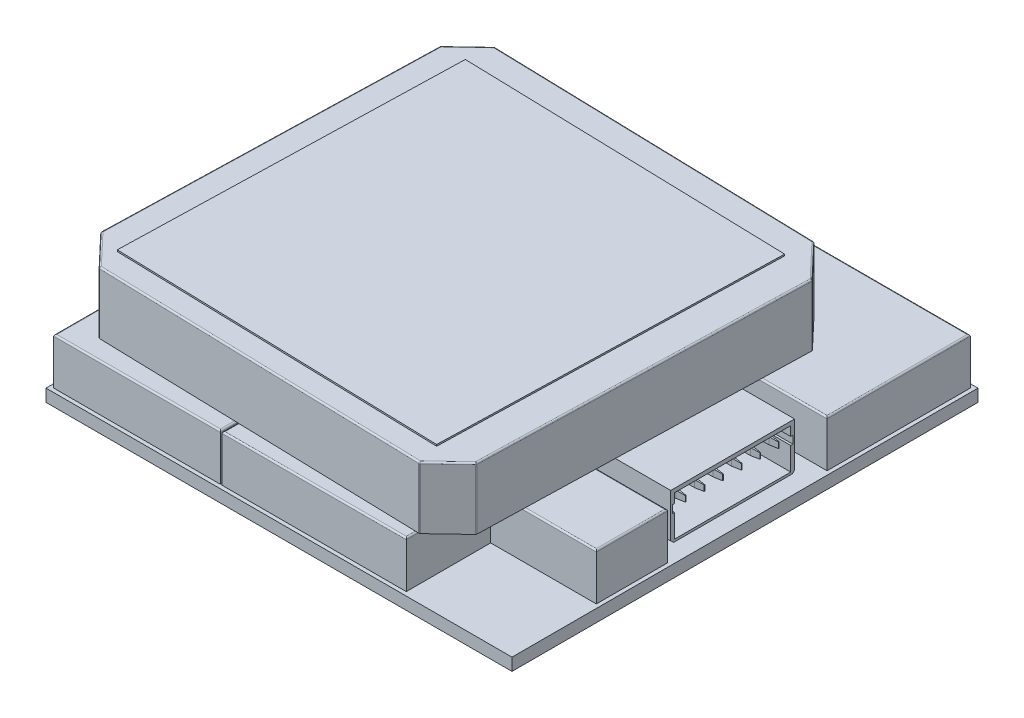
ISO-10303-21;
HEADER;
FILE_DESCRIPTION(('STEP AP214'),'2;1');
FILE_NAME('part.step','',(''),(''),'','','');
FILE_SCHEMA(('AUTOMOTIVE_DESIGN { 1 0 10303 214 1 1 1 1 }'));
ENDSEC;
DATA;
#1=APPLICATION_CONTEXT('core data for automotive mechanical design processes');
#2=APPLICATION_PROTOCOL_DEFINITION('international standard','automotive_design',2000,#1);
#3=PRODUCT_CONTEXT('',#1,'mechanical');
#4=PRODUCT('Part','Part','',(#3));
#5=PRODUCT_RELATED_PRODUCT_CATEGORY('part','',(#4));
#6=PRODUCT_DEFINITION_FORMATION('','',#4);
#7=PRODUCT_DEFINITION_CONTEXT('part definition',#1,'design');
#8=PRODUCT_DEFINITION('design','',#6,#7);
#9=PRODUCT_DEFINITION_SHAPE('','',#8);
#10=(LENGTH_UNIT() NAMED_UNIT(*) SI_UNIT(.MILLI.,.METRE.));
#11=(NAMED_UNIT(*) PLANE_ANGLE_UNIT() SI_UNIT($,.RADIAN.));
#12=(NAMED_UNIT(*) SI_UNIT($,.STERADIAN.) SOLID_ANGLE_UNIT());
#13=UNCERTAINTY_MEASURE_WITH_UNIT(LENGTH_MEASURE(1.E-05),#10,'distance_accuracy_value','');
#14=(GEOMETRIC_REPRESENTATION_CONTEXT(3) GLOBAL_UNCERTAINTY_ASSIGNED_CONTEXT((#13)) GLOBAL_UNIT_ASSIGNED_CONTEXT((#10,
#11,#12)) REPRESENTATION_CONTEXT('',''));
#15=CARTESIAN_POINT('',(0.,0.,0.));
#16=DIRECTION('',(0.,0.,1.));
#17=DIRECTION('',(1.,0.,0.));
#18=AXIS2_PLACEMENT_3D('',#15,#16,#17);
#19=CARTESIAN_POINT('',(0.,7.8,0.));
#20=DIRECTION('',(0.,-1.,0.));
#21=DIRECTION('',(0.,0.,-1.));
#22=AXIS2_PLACEMENT_3D('',#19,#20,#21);
#23=PLANE('',#22);
#24=DIRECTION('',(-0.687669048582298,0.,-0.726024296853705));
#25=VECTOR('',#24,1.);
#26=CARTESIAN_POINT('',(25.3565479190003,7.8,-24.0169829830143));
#27=LINE('',#26,#25);
#28=CARTESIAN_POINT('',(25.5589941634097,7.8,-23.8032451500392));
#29=VERTEX_POINT('',#28);
#30=CARTESIAN_POINT('',(23.5529553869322,7.8,-25.9211722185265));
#31=VERTEX_POINT('',#30);
#32=EDGE_CURVE('E1605',#29,#31,#27,.T.);
#33=ORIENTED_EDGE('',*,*,#32,.T.);
#34=DIRECTION('',(-0.999632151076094,0.,-0.0271212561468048));
#35=VECTOR('',#34,1.);
#36=CARTESIAN_POINT('',(0.720080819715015,7.8,-26.5406563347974));
#37=LINE('',#36,#35);
#38=CARTESIAN_POINT('',(2.42285077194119,7.8,-26.494458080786));
#39=VERTEX_POINT('',#38);
#40=EDGE_CURVE('E1610',#31,#39,#37,.T.);
#41=ORIENTED_EDGE('',*,*,#40,.T.);
#42=DIRECTION('',(-0.726024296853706,0.,0.687669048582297));
#43=VECTOR('',#42,1.);
#44=CARTESIAN_POINT('',(-12.0820019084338,7.8,-12.7558844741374));
#45=LINE('',#44,#43);
#46=CARTESIAN_POINT('',(0.678008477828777,7.8,-24.8417943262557));
#47=VERTEX_POINT('',#46);
#48=EDGE_CURVE('E58',#39,#47,#45,.T.);
#49=ORIENTED_EDGE('',*,*,#48,.T.);
#50=DIRECTION('',(-0.0271212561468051,0.,0.999632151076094));
#51=VECTOR('',#50,1.);
#52=CARTESIAN_POINT('',(0.00401692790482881,7.8,0.000108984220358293));
#53=LINE('',#52,#51);
#54=CARTESIAN_POINT('',(0.10108661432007,7.8,-3.57767439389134));
#55=VERTEX_POINT('',#54);
#56=EDGE_CURVE('E1607',#47,#55,#53,.T.);
#57=ORIENTED_EDGE('',*,*,#56,.T.);
#58=DIRECTION('',(0.687669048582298,0.,0.726024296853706));
#59=VECTOR('',#58,1.);
#60=CARTESIAN_POINT('',(1.83948948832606,7.8,-1.74231081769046));
#61=LINE('',#60,#59);
#62=CARTESIAN_POINT('',(1.97674607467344,7.8,-1.59739864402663));
#63=VERTEX_POINT('',#62);
#64=EDGE_CURVE('E1599',#55,#63,#61,.T.);
#65=ORIENTED_EDGE('',*,*,#64,.T.);
#66=DIRECTION('',(0.999632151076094,0.,0.0271212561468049));
#67=VECTOR('',#66,1.);
#68=CARTESIAN_POINT('',(0.0447615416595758,7.8,-1.64981577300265));
#69=LINE('',#68,#67);
#70=CARTESIAN_POINT('',(23.1621717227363,7.8,-1.02261185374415));
#71=VERTEX_POINT('',#70);
#72=EDGE_CURVE('E1597',#63,#71,#69,.T.);
#73=ORIENTED_EDGE('',*,*,#72,.T.);
#74=DIRECTION('',(0.726024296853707,0.,-0.687669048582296));
#75=VECTOR('',#74,1.);
#76=CARTESIAN_POINT('',(10.4425760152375,7.8,11.0250183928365));
#77=LINE('',#76,#75);
#78=CARTESIAN_POINT('',(24.9878433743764,7.8,-2.75183481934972));
#79=VERTEX_POINT('',#78);
#80=EDGE_CURVE('E1601',#71,#79,#77,.T.);
#81=ORIENTED_EDGE('',*,*,#80,.T.);
#82=DIRECTION('',(0.0271212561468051,0.,-0.999632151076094));
#83=VECTOR('',#82,1.);
#84=CARTESIAN_POINT('',(24.8948574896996,7.8,0.675428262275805));
#85=LINE('',#84,#83);
#86=EDGE_CURVE('E1603',#79,#29,#85,.T.);
#87=ORIENTED_EDGE('',*,*,#86,.T.);
#88=EDGE_LOOP('',(#33,#41,#49,#57,#65,#73,#81,#87));
#89=FACE_BOUND('',#88,.T.);
#90=DIRECTION('',(-0.0271212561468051,0.,0.999632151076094));
#91=VECTOR('',#90,1.);
#92=CARTESIAN_POINT('',(2.25986697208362,7.8,-24.8249590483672));
#93=LINE('',#92,#91);
#94=CARTESIAN_POINT('',(2.25986697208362,7.8,-24.8249590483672));
#95=VERTEX_POINT('',#94);
#96=CARTESIAN_POINT('',(1.66602670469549,7.8,-2.9372625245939));
#97=VERTEX_POINT('',#96);
#98=EDGE_CURVE('E783',#95,#97,#93,.T.);
#99=ORIENTED_EDGE('',*,*,#98,.F.);
#100=DIRECTION('',(-0.999632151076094,0.,-0.0271212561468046));
#101=VECTOR('',#100,1.);
#102=CARTESIAN_POINT('',(2.25986697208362,7.8,-24.8249590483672));
#103=LINE('',#102,#101);
#104=CARTESIAN_POINT('',(23.4625986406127,7.8,-24.2497027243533));
#105=VERTEX_POINT('',#104);
#106=EDGE_CURVE('E780',#105,#95,#103,.T.);
#107=ORIENTED_EDGE('',*,*,#106,.F.);
#108=DIRECTION('',(0.0271212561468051,0.,-0.999632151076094));
#109=VECTOR('',#108,1.);
#110=CARTESIAN_POINT('',(23.4625986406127,7.8,-24.2497027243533));
#111=LINE('',#110,#109);
#112=CARTESIAN_POINT('',(22.8687583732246,7.8,-2.36200620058));
#113=VERTEX_POINT('',#112);
#114=EDGE_CURVE('E1696',#113,#105,#111,.T.);
#115=ORIENTED_EDGE('',*,*,#114,.F.);
#116=DIRECTION('',(0.999632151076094,0.,0.0271212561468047));
#117=VECTOR('',#116,1.);
#118=CARTESIAN_POINT('',(1.66602670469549,7.8,-2.9372625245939));
#119=LINE('',#118,#117);
#120=EDGE_CURVE('E1694',#97,#113,#119,.T.);
#121=ORIENTED_EDGE('',*,*,#120,.F.);
#122=EDGE_LOOP('',(#99,#107,#115,#121));
#123=FACE_BOUND('',#122,.T.);
#124=ADVANCED_FACE('F41',(#89,#123),#23,.F.);
#125=CARTESIAN_POINT('',(0.,3.8,0.));
#126=DIRECTION('',(0.,-1.,0.));
#127=DIRECTION('',(0.,0.,-1.));
#128=AXIS2_PLACEMENT_3D('',#125,#126,#127);
#129=PLANE('',#128);
#130=DIRECTION('',(0.999632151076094,0.,0.0271212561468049));
#131=VECTOR('',#130,1.);
#132=CARTESIAN_POINT('',(23.2008657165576,3.8,-0.921525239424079));
#133=LINE('',#132,#131);
#134=CARTESIAN_POINT('',(11.2213590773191,3.8,-1.24654406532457));
#135=VERTEX_POINT('',#134);
#136=CARTESIAN_POINT('',(22.9213590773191,3.8,-0.929108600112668));
#137=VERTEX_POINT('',#136);
#138=EDGE_CURVE('E2381',#135,#137,#133,.T.);
#139=ORIENTED_EDGE('',*,*,#138,.F.);
#140=DIRECTION('',(0.,0.,1.));
#141=VECTOR('',#140,1.);
#142=CARTESIAN_POINT('',(11.2213590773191,3.8,0.));
#143=LINE('',#142,#141);
#144=CARTESIAN_POINT('',(11.2213590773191,3.8,-0.349999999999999));
#145=VERTEX_POINT('',#144);
#146=EDGE_CURVE('E1273',#135,#145,#143,.T.);
#147=ORIENTED_EDGE('',*,*,#146,.T.);
#148=DIRECTION('',(1.,0.,0.));
#149=VECTOR('',#148,1.);
#150=CARTESIAN_POINT('',(0.,3.8,-0.349999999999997));
#151=LINE('',#150,#149);
#152=CARTESIAN_POINT('',(22.9213590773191,3.8,-0.35));
#153=VERTEX_POINT('',#152);
#154=EDGE_CURVE('E1277',#145,#153,#151,.T.);
#155=ORIENTED_EDGE('',*,*,#154,.T.);
#156=DIRECTION('',(0.,0.,-1.));
#157=VECTOR('',#156,1.);
#158=CARTESIAN_POINT('',(22.9213590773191,3.8,0.));
#159=LINE('',#158,#157);
#160=EDGE_CURVE('E1279',#153,#137,#159,.T.);
#161=ORIENTED_EDGE('',*,*,#160,.T.);
#162=EDGE_LOOP('',(#139,#147,#155,#161));
#163=FACE_BOUND('',#162,.T.);
#164=ADVANCED_FACE('F1714',(#163),#129,.F.);
#165=DIRECTION('',(0.0271212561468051,0.,-0.999632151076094));
#166=VECTOR('',#165,1.);
#167=CARTESIAN_POINT('',(25.6600807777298,3.8,-23.8419391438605));
#168=LINE('',#167,#166);
#169=CARTESIAN_POINT('',(25.1705806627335,3.8,-5.8));
#170=VERTEX_POINT('',#169);
#171=CARTESIAN_POINT('',(25.2899581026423,3.8,-10.2));
#172=VERTEX_POINT('',#171);
#173=EDGE_CURVE('E810',#170,#172,#168,.T.);
#174=ORIENTED_EDGE('',*,*,#173,.F.);
#175=DIRECTION('',(1.,0.,0.));
#176=VECTOR('',#175,1.);
#177=CARTESIAN_POINT('',(0.,3.8,-5.79999999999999));
#178=LINE('',#177,#176);
#179=CARTESIAN_POINT('',(29.75,3.8,-5.8));
#180=VERTEX_POINT('',#179);
#181=EDGE_CURVE('E1282',#170,#180,#178,.T.);
#182=ORIENTED_EDGE('',*,*,#181,.T.);
#183=DIRECTION('',(0.,0.,-1.));
#184=VECTOR('',#183,1.);
#185=CARTESIAN_POINT('',(29.75,3.8,0.));
#186=LINE('',#185,#184);
#187=CARTESIAN_POINT('',(29.75,3.8,-10.2));
#188=VERTEX_POINT('',#187);
#189=EDGE_CURVE('E1286',#180,#188,#186,.T.);
#190=ORIENTED_EDGE('',*,*,#189,.T.);
#191=DIRECTION('',(-1.,0.,0.));
#192=VECTOR('',#191,1.);
#193=CARTESIAN_POINT('',(0.,3.8,-10.2));
#194=LINE('',#193,#192);
#195=EDGE_CURVE('E1288',#188,#172,#194,.T.);
#196=ORIENTED_EDGE('',*,*,#195,.T.);
#197=EDGE_LOOP('',(#174,#182,#190,#196));
#198=FACE_BOUND('',#197,.T.);
#199=ADVANCED_FACE('F1719',(#198),#129,.F.);
#200=DIRECTION('',(-0.0271212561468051,0.,0.999632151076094));
#201=VECTOR('',#200,1.);
#202=CARTESIAN_POINT('',(0.,3.8,-3.53898040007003));
#203=LINE('',#202,#201);
#204=CARTESIAN_POINT('',(0.578045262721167,3.8,-24.8445064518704));
#205=VERTEX_POINT('',#204);
#206=CARTESIAN_POINT('',(0.393701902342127,3.8,-18.05));
#207=VERTEX_POINT('',#206);
#208=EDGE_CURVE('E793',#205,#207,#203,.T.);
#209=ORIENTED_EDGE('',*,*,#208,.F.);
#210=CARTESIAN_POINT('',(0.678008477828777,3.8,-24.8417943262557));
#211=DIRECTION('',(0.,-1.,0.));
#212=DIRECTION('',(0.,0.,-1.));
#213=AXIS2_PLACEMENT_3D('',#210,#211,#212);
#214=CIRCLE('',#213,0.1);
#215=CARTESIAN_POINT('',(0.609241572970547,3.8,-24.9143967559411));
#216=VERTEX_POINT('',#215);
#217=EDGE_CURVE('E50',#205,#216,#214,.T.);
#218=ORIENTED_EDGE('',*,*,#217,.T.);
#219=DIRECTION('',(-0.726024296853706,0.,0.687669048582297));
#220=VECTOR('',#219,1.);
#221=CARTESIAN_POINT('',(0.579168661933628,3.8,-24.8859125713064));
#222=LINE('',#221,#220);
#223=CARTESIAN_POINT('',(2.35408386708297,3.8,-26.5670605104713));
#224=VERTEX_POINT('',#223);
#225=EDGE_CURVE('E784',#224,#216,#222,.T.);
#226=ORIENTED_EDGE('',*,*,#225,.F.);
#227=CARTESIAN_POINT('',(2.4228507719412,3.8,-26.494458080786));
#228=DIRECTION('',(0.,-1.,0.));
#229=DIRECTION('',(0.,0.,-1.));
#230=AXIS2_PLACEMENT_3D('',#227,#228,#229);
#231=CIRCLE('',#230,0.1);
#232=CARTESIAN_POINT('',(2.42556289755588,3.8,-26.5944212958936));
#233=VERTEX_POINT('',#232);
#234=EDGE_CURVE('E11',#224,#233,#231,.T.);
#235=ORIENTED_EDGE('',*,*,#234,.T.);
#236=DIRECTION('',(-0.999632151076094,0.,-0.0271212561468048));
#237=VECTOR('',#236,1.);
#238=CARTESIAN_POINT('',(2.38415677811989,3.8,-26.595544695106));
#239=LINE('',#238,#237);
#240=CARTESIAN_POINT('',(23.5556675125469,3.8,-26.0211354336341));
#241=VERTEX_POINT('',#240);
#242=EDGE_CURVE('E814',#241,#233,#239,.T.);
#243=ORIENTED_EDGE('',*,*,#242,.F.);
#244=CARTESIAN_POINT('',(23.5529553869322,3.8,-25.9211722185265));
#245=DIRECTION('',(0.,-1.,0.));
#246=DIRECTION('',(0.,0.,-1.));
#247=AXIS2_PLACEMENT_3D('',#244,#245,#246);
#248=CIRCLE('',#247,0.1);
#249=CARTESIAN_POINT('',(23.6255578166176,3.8,-25.9899391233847));
#250=VERTEX_POINT('',#249);
#251=EDGE_CURVE('E1617',#241,#250,#248,.T.);
#252=ORIENTED_EDGE('',*,*,#251,.T.);
#253=DIRECTION('',(-0.687669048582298,0.,-0.726024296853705));
#254=VECTOR('',#253,1.);
#255=CARTESIAN_POINT('',(23.5970736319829,3.8,-26.0200120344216));
#256=LINE('',#255,#254);
#257=CARTESIAN_POINT('',(25.6315965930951,3.8,-23.8720120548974));
#258=VERTEX_POINT('',#257);
#259=EDGE_CURVE('E809',#258,#250,#256,.T.);
#260=ORIENTED_EDGE('',*,*,#259,.F.);
#261=CARTESIAN_POINT('',(25.5589941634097,3.8,-23.8032451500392));
#262=DIRECTION('',(0.,-1.,0.));
#263=DIRECTION('',(0.,0.,-1.));
#264=AXIS2_PLACEMENT_3D('',#261,#262,#263);
#265=CIRCLE('',#264,0.1);
#266=CARTESIAN_POINT('',(25.6589573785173,3.8,-23.8005330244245));
#267=VERTEX_POINT('',#266);
#268=EDGE_CURVE('E1614',#258,#267,#265,.T.);
#269=ORIENTED_EDGE('',*,*,#268,.T.);
#270=CARTESIAN_POINT('',(25.5748360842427,3.8,-20.7));
#271=VERTEX_POINT('',#270);
#272=EDGE_CURVE('E806',#271,#267,#168,.T.);
#273=ORIENTED_EDGE('',*,*,#272,.F.);
#274=DIRECTION('',(1.,0.,0.));
#275=VECTOR('',#274,1.);
#276=CARTESIAN_POINT('',(0.,3.8,-20.7));
#277=LINE('',#276,#275);
#278=CARTESIAN_POINT('',(29.75,3.8,-20.7));
#279=VERTEX_POINT('',#278);
#280=EDGE_CURVE('E1295',#271,#279,#277,.T.);
#281=ORIENTED_EDGE('',*,*,#280,.T.);
#282=DIRECTION('',(0.,0.,-1.));
#283=VECTOR('',#282,1.);
#284=CARTESIAN_POINT('',(29.75,3.8,0.));
#285=LINE('',#284,#283);
#286=CARTESIAN_POINT('',(29.75,3.8,-29.75));
#287=VERTEX_POINT('',#286);
#288=EDGE_CURVE('E1264',#279,#287,#285,.T.);
#289=ORIENTED_EDGE('',*,*,#288,.T.);
#290=DIRECTION('',(-1.,0.,0.));
#291=VECTOR('',#290,1.);
#292=CARTESIAN_POINT('',(0.,3.8,-29.75));
#293=LINE('',#292,#291);
#294=CARTESIAN_POINT('',(0.34999999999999,3.8,-29.75));
#295=VERTEX_POINT('',#294);
#296=EDGE_CURVE('E1266',#287,#295,#293,.T.);
#297=ORIENTED_EDGE('',*,*,#296,.T.);
#298=DIRECTION('',(0.,0.,1.));
#299=VECTOR('',#298,1.);
#300=CARTESIAN_POINT('',(0.349999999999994,3.8,0.));
#301=LINE('',#300,#299);
#302=CARTESIAN_POINT('',(0.349999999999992,3.8,-18.05));
#303=VERTEX_POINT('',#302);
#304=EDGE_CURVE('E1268',#295,#303,#301,.T.);
#305=ORIENTED_EDGE('',*,*,#304,.T.);
#306=DIRECTION('',(1.,0.,0.));
#307=VECTOR('',#306,1.);
#308=CARTESIAN_POINT('',(0.,3.8,-18.05));
#309=LINE('',#308,#307);
#310=EDGE_CURVE('E1270',#303,#207,#309,.T.);
#311=ORIENTED_EDGE('',*,*,#310,.T.);
#312=EDGE_LOOP('',(#209,#218,#226,#235,#243,#252,#260,#269,#273,#281,#289,#297,#305,#311));
#313=FACE_BOUND('',#312,.T.);
#314=ADVANCED_FACE('F1722',(#313),#129,.F.);
#315=CARTESIAN_POINT('',(0.,3.8,0.));
#316=DIRECTION('',(0.,1.,0.));
#317=DIRECTION('',(0.,0.,1.));
#318=AXIS2_PLACEMENT_3D('',#315,#316,#317);
#319=PLANE('',#318);
#320=DIRECTION('',(0.,0.,1.));
#321=VECTOR('',#320,1.);
#322=CARTESIAN_POINT('',(0.349999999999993,3.8,-0.25));
#323=LINE('',#322,#321);
#324=CARTESIAN_POINT('',(0.349999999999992,3.8,-17.75));
#325=VERTEX_POINT('',#324);
#326=CARTESIAN_POINT('',(0.349999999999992,3.8,-16.4392402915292));
#327=VERTEX_POINT('',#326);
#328=EDGE_CURVE('E1249',#325,#327,#323,.T.);
#329=ORIENTED_EDGE('',*,*,#328,.T.);
#330=CARTESIAN_POINT('',(0.385562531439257,3.8,-17.75));
#331=VERTEX_POINT('',#330);
#332=EDGE_CURVE('E2352',#331,#327,#203,.T.);
#333=ORIENTED_EDGE('',*,*,#332,.F.);
#334=DIRECTION('',(-1.,0.,0.));
#335=VECTOR('',#334,1.);
#336=CARTESIAN_POINT('',(0.249999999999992,3.8,-17.75));
#337=LINE('',#336,#335);
#338=EDGE_CURVE('E1244',#331,#325,#337,.T.);
#339=ORIENTED_EDGE('',*,*,#338,.T.);
#340=EDGE_LOOP('',(#329,#333,#339));
#341=FACE_BOUND('',#340,.T.);
#342=ADVANCED_FACE('F1971',(#341),#319,.T.);
#343=CARTESIAN_POINT('',(1.97403394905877,3.8,-1.49743542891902));
#344=VERTEX_POINT('',#343);
#345=CARTESIAN_POINT('',(10.9213590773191,3.8,-1.25468343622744));
#346=VERTEX_POINT('',#345);
#347=EDGE_CURVE('E800',#344,#346,#133,.T.);
#348=ORIENTED_EDGE('',*,*,#347,.F.);
#349=CARTESIAN_POINT('',(1.97674607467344,3.8,-1.59739864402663));
#350=DIRECTION('',(0.,1.,0.));
#351=DIRECTION('',(0.,0.,1.));
#352=AXIS2_PLACEMENT_3D('',#349,#350,#351);
#353=CIRCLE('',#352,0.1);
#354=CARTESIAN_POINT('',(1.90414364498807,3.8,-1.5286317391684));
#355=VERTEX_POINT('',#354);
#356=EDGE_CURVE('E1612',#344,#355,#353,.F.);
#357=ORIENTED_EDGE('',*,*,#356,.T.);
#358=DIRECTION('',(0.687669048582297,0.,0.726024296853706));
#359=VECTOR('',#358,1.);
#360=CARTESIAN_POINT('',(1.93262782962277,3.8,-1.49855882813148));
#361=LINE('',#360,#359);
#362=CARTESIAN_POINT('',(0.349999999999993,3.8,-3.16945889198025));
#363=VERTEX_POINT('',#362);
#364=EDGE_CURVE('E795',#363,#355,#361,.T.);
#365=ORIENTED_EDGE('',*,*,#364,.F.);
#366=CARTESIAN_POINT('',(0.349999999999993,3.8,-0.35));
#367=VERTEX_POINT('',#366);
#368=EDGE_CURVE('E1248',#363,#367,#323,.T.);
#369=ORIENTED_EDGE('',*,*,#368,.T.);
#370=DIRECTION('',(1.,0.,0.));
#371=VECTOR('',#370,1.);
#372=CARTESIAN_POINT('',(11.0213590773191,3.8,-0.349999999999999));
#373=LINE('',#372,#371);
#374=CARTESIAN_POINT('',(10.9213590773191,3.8,-0.349999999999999));
#375=VERTEX_POINT('',#374);
#376=EDGE_CURVE('E1252',#367,#375,#373,.T.);
#377=ORIENTED_EDGE('',*,*,#376,.T.);
#378=DIRECTION('',(0.,0.,-1.));
#379=VECTOR('',#378,1.);
#380=CARTESIAN_POINT('',(10.9213590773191,3.8,-17.85));
#381=LINE('',#380,#379);
#382=EDGE_CURVE('E1241',#375,#346,#381,.T.);
#383=ORIENTED_EDGE('',*,*,#382,.T.);
#384=EDGE_LOOP('',(#348,#357,#365,#369,#377,#383));
#385=FACE_BOUND('',#384,.T.);
#386=ADVANCED_FACE('F1951',(#385),#319,.T.);
#387=CARTESIAN_POINT('',(0.,3.8,0.));
#388=DIRECTION('',(0.,-1.,0.));
#389=DIRECTION('',(0.,0.,-1.));
#390=AXIS2_PLACEMENT_3D('',#387,#388,#389);
#391=PLANE('',#390);
#392=DIRECTION('',(0.0271212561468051,0.,-0.999632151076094));
#393=VECTOR('',#392,1.);
#394=CARTESIAN_POINT('',(24.9948207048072,3.8,0.678140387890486));
#395=LINE('',#394,#393);
#396=CARTESIAN_POINT('',(25.3238721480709,3.8,-11.45));
#397=VERTEX_POINT('',#396);
#398=CARTESIAN_POINT('',(25.5409220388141,3.8,-19.45));
#399=VERTEX_POINT('',#398);
#400=EDGE_CURVE('E1478',#397,#399,#395,.T.);
#401=ORIENTED_EDGE('',*,*,#400,.F.);
#402=DIRECTION('',(1.,0.,0.));
#403=VECTOR('',#402,1.);
#404=CARTESIAN_POINT('',(23.5093423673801,3.8,-11.45));
#405=LINE('',#404,#403);
#406=CARTESIAN_POINT('',(28.902565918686,3.8,-11.45));
#407=VERTEX_POINT('',#406);
#408=EDGE_CURVE('E1100',#397,#407,#405,.T.);
#409=ORIENTED_EDGE('',*,*,#408,.T.);
#410=DIRECTION('',(0.,0.,1.));
#411=VECTOR('',#410,1.);
#412=CARTESIAN_POINT('',(28.902565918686,3.8,-11.45));
#413=LINE('',#412,#411);
#414=CARTESIAN_POINT('',(28.902565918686,3.8,-19.45));
#415=VERTEX_POINT('',#414);
#416=EDGE_CURVE('E1076',#415,#407,#413,.T.);
#417=ORIENTED_EDGE('',*,*,#416,.F.);
#418=DIRECTION('',(-1.,0.,0.));
#419=VECTOR('',#418,1.);
#420=CARTESIAN_POINT('',(23.5093423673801,3.8,-19.45));
#421=LINE('',#420,#419);
#422=EDGE_CURVE('E1092',#415,#399,#421,.T.);
#423=ORIENTED_EDGE('',*,*,#422,.T.);
#424=EDGE_LOOP('',(#401,#409,#417,#423));
#425=FACE_BOUND('',#424,.T.);
#426=ADVANCED_FACE('F1947',(#425),#391,.F.);
#427=CARTESIAN_POINT('',(23.902565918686,3.8,-11.45));
#428=DIRECTION('',(-1.,0.,0.));
#429=DIRECTION('',(0.,0.,1.));
#430=AXIS2_PLACEMENT_3D('',#427,#428,#429);
#431=PLANE('',#430);
#432=DIRECTION('',(0.,-1.,0.));
#433=VECTOR('',#432,1.);
#434=CARTESIAN_POINT('',(23.902565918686,3.07174092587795,-17.1601101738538));
#435=LINE('',#434,#433);
#436=CARTESIAN_POINT('',(23.902565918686,3.07174092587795,-17.1601101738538));
#437=VERTEX_POINT('',#436);
#438=CARTESIAN_POINT('',(23.902565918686,2.61380990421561,-17.1601101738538));
#439=VERTEX_POINT('',#438);
#440=EDGE_CURVE('E860',#437,#439,#435,.T.);
#441=ORIENTED_EDGE('',*,*,#440,.F.);
#442=DIRECTION('',(0.,0.,1.));
#443=VECTOR('',#442,1.);
#444=CARTESIAN_POINT('',(23.902565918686,3.07174092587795,-17.1601101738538));
#445=LINE('',#444,#443);
#446=CARTESIAN_POINT('',(23.902565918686,3.07174092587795,-17.2993378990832));
#447=VERTEX_POINT('',#446);
#448=EDGE_CURVE('E871',#447,#437,#445,.T.);
#449=ORIENTED_EDGE('',*,*,#448,.F.);
#450=DIRECTION('',(0.,1.,0.));
#451=VECTOR('',#450,1.);
#452=CARTESIAN_POINT('',(23.902565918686,3.07174092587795,-17.2993378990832));
#453=LINE('',#452,#451);
#454=CARTESIAN_POINT('',(23.902565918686,2.61380990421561,-17.2993378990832));
#455=VERTEX_POINT('',#454);
#456=EDGE_CURVE('E867',#455,#447,#453,.T.);
#457=ORIENTED_EDGE('',*,*,#456,.F.);
#458=DIRECTION('',(0.,0.,-1.));
#459=VECTOR('',#458,1.);
#460=CARTESIAN_POINT('',(23.902565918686,2.61380990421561,-17.1601101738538));
#461=LINE('',#460,#459);
#462=EDGE_CURVE('E864',#439,#455,#461,.T.);
#463=ORIENTED_EDGE('',*,*,#462,.F.);
#464=EDGE_LOOP('',(#441,#449,#457,#463));
#465=FACE_BOUND('',#464,.T.);
#466=DIRECTION('',(0.,-1.,0.));
#467=VECTOR('',#466,1.);
#468=CARTESIAN_POINT('',(23.902565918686,3.07174092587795,-14.7601101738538));
#469=LINE('',#468,#467);
#470=CARTESIAN_POINT('',(23.902565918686,3.07174092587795,-14.7601101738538));
#471=VERTEX_POINT('',#470);
#472=CARTESIAN_POINT('',(23.902565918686,2.61380990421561,-14.7601101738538));
#473=VERTEX_POINT('',#472);
#474=EDGE_CURVE('E905',#471,#473,#469,.T.);
#475=ORIENTED_EDGE('',*,*,#474,.F.);
#476=DIRECTION('',(0.,0.,1.));
#477=VECTOR('',#476,1.);
#478=CARTESIAN_POINT('',(23.902565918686,3.07174092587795,-14.7601101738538));
#479=LINE('',#478,#477);
#480=CARTESIAN_POINT('',(23.902565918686,3.07174092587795,-14.8993378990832));
#481=VERTEX_POINT('',#480);
#482=EDGE_CURVE('E914',#481,#471,#479,.T.);
#483=ORIENTED_EDGE('',*,*,#482,.F.);
#484=DIRECTION('',(0.,1.,0.));
#485=VECTOR('',#484,1.);
#486=CARTESIAN_POINT('',(23.902565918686,3.07174092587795,-14.8993378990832));
#487=LINE('',#486,#485);
#488=CARTESIAN_POINT('',(23.902565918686,2.61380990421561,-14.8993378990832));
#489=VERTEX_POINT('',#488);
#490=EDGE_CURVE('E911',#489,#481,#487,.T.);
#491=ORIENTED_EDGE('',*,*,#490,.F.);
#492=DIRECTION('',(0.,0.,-1.));
#493=VECTOR('',#492,1.);
#494=CARTESIAN_POINT('',(23.902565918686,2.61380990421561,-14.7601101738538));
#495=LINE('',#494,#493);
#496=EDGE_CURVE('E908',#473,#489,#495,.T.);
#497=ORIENTED_EDGE('',*,*,#496,.F.);
#498=EDGE_LOOP('',(#475,#483,#491,#497));
#499=FACE_BOUND('',#498,.T.);
#500=DIRECTION('',(0.,-1.,0.));
#501=VECTOR('',#500,1.);
#502=CARTESIAN_POINT('',(23.902565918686,3.07174092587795,-12.3601101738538));
#503=LINE('',#502,#501);
#504=CARTESIAN_POINT('',(23.902565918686,3.07174092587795,-12.3601101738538));
#505=VERTEX_POINT('',#504);
#506=CARTESIAN_POINT('',(23.902565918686,2.61380990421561,-12.3601101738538));
#507=VERTEX_POINT('',#506);
#508=EDGE_CURVE('E945',#505,#507,#503,.T.);
#509=ORIENTED_EDGE('',*,*,#508,.F.);
#510=DIRECTION('',(0.,0.,1.));
#511=VECTOR('',#510,1.);
#512=CARTESIAN_POINT('',(23.902565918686,3.07174092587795,-12.3601101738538));
#513=LINE('',#512,#511);
#514=CARTESIAN_POINT('',(23.902565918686,3.07174092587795,-12.4993378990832));
#515=VERTEX_POINT('',#514);
#516=EDGE_CURVE('E954',#515,#505,#513,.T.);
#517=ORIENTED_EDGE('',*,*,#516,.F.);
#518=DIRECTION('',(0.,1.,0.));
#519=VECTOR('',#518,1.);
#520=CARTESIAN_POINT('',(23.902565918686,3.07174092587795,-12.4993378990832));
#521=LINE('',#520,#519);
#522=CARTESIAN_POINT('',(23.902565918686,2.61380990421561,-12.4993378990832));
#523=VERTEX_POINT('',#522);
#524=EDGE_CURVE('E951',#523,#515,#521,.T.);
#525=ORIENTED_EDGE('',*,*,#524,.F.);
#526=DIRECTION('',(0.,0.,-1.));
#527=VECTOR('',#526,1.);
#528=CARTESIAN_POINT('',(23.902565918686,2.61380990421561,-12.3601101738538));
#529=LINE('',#528,#527);
#530=EDGE_CURVE('E948',#507,#523,#529,.T.);
#531=ORIENTED_EDGE('',*,*,#530,.F.);
#532=EDGE_LOOP('',(#509,#517,#525,#531));
#533=FACE_BOUND('',#532,.T.);
#534=DIRECTION('',(0.,0.,1.));
#535=VECTOR('',#534,1.);
#536=CARTESIAN_POINT('',(23.902565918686,2.94390661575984,-19.2));
#537=LINE('',#536,#535);
#538=CARTESIAN_POINT('',(23.902565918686,2.94390661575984,-19.3395502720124));
#539=VERTEX_POINT('',#538);
#540=CARTESIAN_POINT('',(23.902565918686,2.94390661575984,-19.2));
#541=VERTEX_POINT('',#540);
#542=EDGE_CURVE('E969',#539,#541,#537,.T.);
#543=ORIENTED_EDGE('',*,*,#542,.T.);
#544=DIRECTION('',(0.,1.,0.));
#545=VECTOR('',#544,1.);
#546=CARTESIAN_POINT('',(23.902565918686,3.55,-19.2));
#547=LINE('',#546,#545);
#548=CARTESIAN_POINT('',(23.902565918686,3.55,-19.2));
#549=VERTEX_POINT('',#548);
#550=EDGE_CURVE('E965',#541,#549,#547,.T.);
#551=ORIENTED_EDGE('',*,*,#550,.T.);
#552=DIRECTION('',(0.,0.,1.));
#553=VECTOR('',#552,1.);
#554=CARTESIAN_POINT('',(23.902565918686,3.55,-11.7));
#555=LINE('',#554,#553);
#556=CARTESIAN_POINT('',(23.902565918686,3.55,-11.7));
#557=VERTEX_POINT('',#556);
#558=EDGE_CURVE('E996',#549,#557,#555,.T.);
#559=ORIENTED_EDGE('',*,*,#558,.T.);
#560=DIRECTION('',(0.,-1.,0.));
#561=VECTOR('',#560,1.);
#562=CARTESIAN_POINT('',(23.902565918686,3.55,-11.7));
#563=LINE('',#562,#561);
#564=CARTESIAN_POINT('',(23.902565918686,2.94390661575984,-11.7));
#565=VERTEX_POINT('',#564);
#566=EDGE_CURVE('E1000',#557,#565,#563,.T.);
#567=ORIENTED_EDGE('',*,*,#566,.T.);
#568=DIRECTION('',(0.,0.,1.));
#569=VECTOR('',#568,1.);
#570=CARTESIAN_POINT('',(23.902565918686,2.94390661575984,-11.7));
#571=LINE('',#570,#569);
#572=CARTESIAN_POINT('',(23.902565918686,2.94390661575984,-11.5604497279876));
#573=VERTEX_POINT('',#572);
#574=EDGE_CURVE('E1003',#565,#573,#571,.T.);
#575=ORIENTED_EDGE('',*,*,#574,.T.);
#576=DIRECTION('',(0.,-1.,0.));
#577=VECTOR('',#576,1.);
#578=CARTESIAN_POINT('',(23.902565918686,2.94390661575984,-11.5604497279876));
#579=LINE('',#578,#577);
#580=CARTESIAN_POINT('',(23.902565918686,2.44390661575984,-11.5604497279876));
#581=VERTEX_POINT('',#580);
#582=EDGE_CURVE('E1006',#573,#581,#579,.T.);
#583=ORIENTED_EDGE('',*,*,#582,.T.);
#584=DIRECTION('',(0.,0.,-1.));
#585=VECTOR('',#584,1.);
#586=CARTESIAN_POINT('',(23.902565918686,2.44390661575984,-11.5604497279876));
#587=LINE('',#586,#585);
#588=CARTESIAN_POINT('',(23.902565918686,2.44390661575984,-11.7));
#589=VERTEX_POINT('',#588);
#590=EDGE_CURVE('E1009',#581,#589,#587,.T.);
#591=ORIENTED_EDGE('',*,*,#590,.T.);
#592=DIRECTION('',(0.,-1.,0.));
#593=VECTOR('',#592,1.);
#594=CARTESIAN_POINT('',(23.902565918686,2.44390661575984,-11.7));
#595=LINE('',#594,#593);
#596=CARTESIAN_POINT('',(23.902565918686,0.954176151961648,-11.7));
#597=VERTEX_POINT('',#596);
#598=EDGE_CURVE('E1012',#589,#597,#595,.T.);
#599=ORIENTED_EDGE('',*,*,#598,.T.);
#600=DIRECTION('',(0.,0.,-1.));
#601=VECTOR('',#600,1.);
#602=CARTESIAN_POINT('',(23.902565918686,0.954176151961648,-19.2));
#603=LINE('',#602,#601);
#604=CARTESIAN_POINT('',(23.902565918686,0.954176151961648,-19.2));
#605=VERTEX_POINT('',#604);
#606=EDGE_CURVE('E1015',#597,#605,#603,.T.);
#607=ORIENTED_EDGE('',*,*,#606,.T.);
#608=DIRECTION('',(0.,1.,0.));
#609=VECTOR('',#608,1.);
#610=CARTESIAN_POINT('',(23.902565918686,2.44390661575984,-19.2));
#611=LINE('',#610,#609);
#612=CARTESIAN_POINT('',(23.902565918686,2.44390661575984,-19.2));
#613=VERTEX_POINT('',#612);
#614=EDGE_CURVE('E1018',#605,#613,#611,.T.);
#615=ORIENTED_EDGE('',*,*,#614,.T.);
#616=DIRECTION('',(0.,0.,-1.));
#617=VECTOR('',#616,1.);
#618=CARTESIAN_POINT('',(23.902565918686,2.44390661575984,-19.3395502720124));
#619=LINE('',#618,#617);
#620=CARTESIAN_POINT('',(23.902565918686,2.44390661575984,-19.3395502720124));
#621=VERTEX_POINT('',#620);
#622=EDGE_CURVE('E1022',#613,#621,#619,.T.);
#623=ORIENTED_EDGE('',*,*,#622,.T.);
#624=DIRECTION('',(0.,1.,0.));
#625=VECTOR('',#624,1.);
#626=CARTESIAN_POINT('',(23.902565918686,2.94390661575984,-19.3395502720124));
#627=LINE('',#626,#625);
#628=EDGE_CURVE('E1026',#621,#539,#627,.T.);
#629=ORIENTED_EDGE('',*,*,#628,.T.);
#630=EDGE_LOOP('',(#543,#551,#559,#567,#575,#583,#591,#599,#607,#615,#623,#629));
#631=FACE_BOUND('',#630,.T.);
#632=DIRECTION('',(0.,-1.,0.));
#633=VECTOR('',#632,1.);
#634=CARTESIAN_POINT('',(23.902565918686,3.07174092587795,-13.5601101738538));
#635=LINE('',#634,#633);
#636=CARTESIAN_POINT('',(23.902565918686,3.07174092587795,-13.5601101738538));
#637=VERTEX_POINT('',#636);
#638=CARTESIAN_POINT('',(23.902565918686,2.61380990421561,-13.5601101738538));
#639=VERTEX_POINT('',#638);
#640=EDGE_CURVE('E925',#637,#639,#635,.T.);
#641=ORIENTED_EDGE('',*,*,#640,.F.);
#642=DIRECTION('',(0.,0.,1.));
#643=VECTOR('',#642,1.);
#644=CARTESIAN_POINT('',(23.902565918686,3.07174092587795,-13.5601101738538));
#645=LINE('',#644,#643);
#646=CARTESIAN_POINT('',(23.902565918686,3.07174092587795,-13.6993378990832));
#647=VERTEX_POINT('',#646);
#648=EDGE_CURVE('E934',#647,#637,#645,.T.);
#649=ORIENTED_EDGE('',*,*,#648,.F.);
#650=DIRECTION('',(0.,1.,0.));
#651=VECTOR('',#650,1.);
#652=CARTESIAN_POINT('',(23.902565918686,3.07174092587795,-13.6993378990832));
#653=LINE('',#652,#651);
#654=CARTESIAN_POINT('',(23.902565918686,2.61380990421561,-13.6993378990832));
#655=VERTEX_POINT('',#654);
#656=EDGE_CURVE('E931',#655,#647,#653,.T.);
#657=ORIENTED_EDGE('',*,*,#656,.F.);
#658=DIRECTION('',(0.,0.,-1.));
#659=VECTOR('',#658,1.);
#660=CARTESIAN_POINT('',(23.902565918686,2.61380990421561,-13.5601101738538));
#661=LINE('',#660,#659);
#662=EDGE_CURVE('E928',#639,#655,#661,.T.);
#663=ORIENTED_EDGE('',*,*,#662,.F.);
#664=EDGE_LOOP('',(#641,#649,#657,#663));
#665=FACE_BOUND('',#664,.T.);
#666=DIRECTION('',(0.,-1.,0.));
#667=VECTOR('',#666,1.);
#668=CARTESIAN_POINT('',(23.902565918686,3.07174092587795,-15.9601101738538));
#669=LINE('',#668,#667);
#670=CARTESIAN_POINT('',(23.902565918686,3.07174092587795,-15.9601101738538));
#671=VERTEX_POINT('',#670);
#672=CARTESIAN_POINT('',(23.902565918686,2.61380990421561,-15.9601101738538));
#673=VERTEX_POINT('',#672);
#674=EDGE_CURVE('E885',#671,#673,#669,.T.);
#675=ORIENTED_EDGE('',*,*,#674,.F.);
#676=DIRECTION('',(0.,0.,1.));
#677=VECTOR('',#676,1.);
#678=CARTESIAN_POINT('',(23.902565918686,3.07174092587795,-15.9601101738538));
#679=LINE('',#678,#677);
#680=CARTESIAN_POINT('',(23.902565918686,3.07174092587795,-16.0993378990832));
#681=VERTEX_POINT('',#680);
#682=EDGE_CURVE('E894',#681,#671,#679,.T.);
#683=ORIENTED_EDGE('',*,*,#682,.F.);
#684=DIRECTION('',(0.,1.,0.));
#685=VECTOR('',#684,1.);
#686=CARTESIAN_POINT('',(23.902565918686,3.07174092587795,-16.0993378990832));
#687=LINE('',#686,#685);
#688=CARTESIAN_POINT('',(23.902565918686,2.61380990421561,-16.0993378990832));
#689=VERTEX_POINT('',#688);
#690=EDGE_CURVE('E891',#689,#681,#687,.T.);
#691=ORIENTED_EDGE('',*,*,#690,.F.);
#692=DIRECTION('',(0.,0.,-1.));
#693=VECTOR('',#692,1.);
#694=CARTESIAN_POINT('',(23.902565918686,2.61380990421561,-15.9601101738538));
#695=LINE('',#694,#693);
#696=EDGE_CURVE('E888',#673,#689,#695,.T.);
#697=ORIENTED_EDGE('',*,*,#696,.F.);
#698=EDGE_LOOP('',(#675,#683,#691,#697));
#699=FACE_BOUND('',#698,.T.);
#700=DIRECTION('',(0.,-1.,0.));
#701=VECTOR('',#700,1.);
#702=CARTESIAN_POINT('',(23.902565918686,3.07174092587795,-18.3601101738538));
#703=LINE('',#702,#701);
#704=CARTESIAN_POINT('',(23.902565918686,3.07174092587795,-18.3601101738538));
#705=VERTEX_POINT('',#704);
#706=CARTESIAN_POINT('',(23.902565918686,2.61380990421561,-18.3601101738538));
#707=VERTEX_POINT('',#706);
#708=EDGE_CURVE('E831',#705,#707,#703,.T.);
#709=ORIENTED_EDGE('',*,*,#708,.F.);
#710=DIRECTION('',(0.,0.,1.));
#711=VECTOR('',#710,1.);
#712=CARTESIAN_POINT('',(23.902565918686,3.07174092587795,-18.3601101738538));
#713=LINE('',#712,#711);
#714=CARTESIAN_POINT('',(23.902565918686,3.07174092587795,-18.4993378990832));
#715=VERTEX_POINT('',#714);
#716=EDGE_CURVE('E844',#715,#705,#713,.T.);
#717=ORIENTED_EDGE('',*,*,#716,.F.);
#718=DIRECTION('',(0.,1.,0.));
#719=VECTOR('',#718,1.);
#720=CARTESIAN_POINT('',(23.902565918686,3.07174092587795,-18.4993378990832));
#721=LINE('',#720,#719);
#722=CARTESIAN_POINT('',(23.902565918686,2.61380990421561,-18.4993378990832));
#723=VERTEX_POINT('',#722);
#724=EDGE_CURVE('E840',#723,#715,#721,.T.);
#725=ORIENTED_EDGE('',*,*,#724,.F.);
#726=DIRECTION('',(0.,0.,-1.));
#727=VECTOR('',#726,1.);
#728=CARTESIAN_POINT('',(23.902565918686,2.61380990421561,-18.3601101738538));
#729=LINE('',#728,#727);
#730=EDGE_CURVE('E835',#707,#723,#729,.T.);
#731=ORIENTED_EDGE('',*,*,#730,.F.);
#732=EDGE_LOOP('',(#709,#717,#725,#731));
#733=FACE_BOUND('',#732,.T.);
#734=ADVANCED_FACE('F1950',(#465,#499,#533,#631,#665,#699,#733),#431,.F.);
#735=CARTESIAN_POINT('',(0.,0.8,0.));
#736=DIRECTION('',(0.,-1.,0.));
#737=DIRECTION('',(0.,0.,-1.));
#738=AXIS2_PLACEMENT_3D('',#735,#736,#737);
#739=PLANE('',#738);
#740=DIRECTION('',(0.,0.,-1.));
#741=VECTOR('',#740,1.);
#742=CARTESIAN_POINT('',(29.85,0.8,-29.85));
#743=LINE('',#742,#741);
#744=CARTESIAN_POINT('',(29.85,0.8,-20.6));
#745=VERTEX_POINT('',#744);
#746=CARTESIAN_POINT('',(29.85,0.8,-29.85));
#747=VERTEX_POINT('',#746);
#748=EDGE_CURVE('E1150',#745,#747,#743,.T.);
#749=ORIENTED_EDGE('',*,*,#748,.F.);
#750=DIRECTION('',(1.,0.,0.));
#751=VECTOR('',#750,1.);
#752=CARTESIAN_POINT('',(29.85,0.8,-20.6));
#753=LINE('',#752,#751);
#754=CARTESIAN_POINT('',(23.0213590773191,0.8,-20.6));
#755=VERTEX_POINT('',#754);
#756=EDGE_CURVE('E1183',#755,#745,#753,.T.);
#757=ORIENTED_EDGE('',*,*,#756,.F.);
#758=DIRECTION('',(0.,0.,-1.));
#759=VECTOR('',#758,1.);
#760=CARTESIAN_POINT('',(23.0213590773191,0.8,-20.6));
#761=LINE('',#760,#759);
#762=CARTESIAN_POINT('',(23.0213590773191,0.8,-10.3));
#763=VERTEX_POINT('',#762);
#764=EDGE_CURVE('E1180',#763,#755,#761,.T.);
#765=ORIENTED_EDGE('',*,*,#764,.F.);
#766=DIRECTION('',(-1.,0.,0.));
#767=VECTOR('',#766,1.);
#768=CARTESIAN_POINT('',(23.0213590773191,0.8,-10.3));
#769=LINE('',#768,#767);
#770=CARTESIAN_POINT('',(29.85,0.8,-10.3));
#771=VERTEX_POINT('',#770);
#772=EDGE_CURVE('E1177',#771,#763,#769,.T.);
#773=ORIENTED_EDGE('',*,*,#772,.F.);
#774=DIRECTION('',(0.,0.,-1.));
#775=VECTOR('',#774,1.);
#776=CARTESIAN_POINT('',(29.85,0.8,-10.3));
#777=LINE('',#776,#775);
#778=CARTESIAN_POINT('',(29.85,0.8,-5.7));
#779=VERTEX_POINT('',#778);
#780=EDGE_CURVE('E1174',#779,#771,#777,.T.);
#781=ORIENTED_EDGE('',*,*,#780,.F.);
#782=DIRECTION('',(1.,0.,0.));
#783=VECTOR('',#782,1.);
#784=CARTESIAN_POINT('',(29.85,0.8,-5.7));
#785=LINE('',#784,#783);
#786=CARTESIAN_POINT('',(23.0213590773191,0.8,-5.7));
#787=VERTEX_POINT('',#786);
#788=EDGE_CURVE('E1171',#787,#779,#785,.T.);
#789=ORIENTED_EDGE('',*,*,#788,.F.);
#790=DIRECTION('',(0.,0.,-1.));
#791=VECTOR('',#790,1.);
#792=CARTESIAN_POINT('',(23.0213590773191,0.8,-5.7));
#793=LINE('',#792,#791);
#794=CARTESIAN_POINT('',(23.0213590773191,0.8,-0.25));
#795=VERTEX_POINT('',#794);
#796=EDGE_CURVE('E1168',#795,#787,#793,.T.);
#797=ORIENTED_EDGE('',*,*,#796,.F.);
#798=DIRECTION('',(1.,0.,0.));
#799=VECTOR('',#798,1.);
#800=CARTESIAN_POINT('',(23.0213590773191,0.8,-0.25));
#801=LINE('',#800,#799);
#802=CARTESIAN_POINT('',(11.1213590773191,0.8,-0.249999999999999));
#803=VERTEX_POINT('',#802);
#804=EDGE_CURVE('E1165',#803,#795,#801,.T.);
#805=ORIENTED_EDGE('',*,*,#804,.F.);
#806=DIRECTION('',(0.,0.,1.));
#807=VECTOR('',#806,1.);
#808=CARTESIAN_POINT('',(11.1213590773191,0.8,-0.249999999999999));
#809=LINE('',#808,#807);
#810=CARTESIAN_POINT('',(11.1213590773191,0.8,-17.95));
#811=VERTEX_POINT('',#810);
#812=EDGE_CURVE('E1162',#811,#803,#809,.T.);
#813=ORIENTED_EDGE('',*,*,#812,.F.);
#814=DIRECTION('',(1.,0.,0.));
#815=VECTOR('',#814,1.);
#816=CARTESIAN_POINT('',(11.1213590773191,0.8,-17.95));
#817=LINE('',#816,#815);
#818=CARTESIAN_POINT('',(0.249999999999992,0.8,-17.95));
#819=VERTEX_POINT('',#818);
#820=EDGE_CURVE('E1159',#819,#811,#817,.T.);
#821=ORIENTED_EDGE('',*,*,#820,.F.);
#822=DIRECTION('',(0.,0.,1.));
#823=VECTOR('',#822,1.);
#824=CARTESIAN_POINT('',(0.249999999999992,0.8,-17.95));
#825=LINE('',#824,#823);
#826=CARTESIAN_POINT('',(0.24999999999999,0.8,-29.85));
#827=VERTEX_POINT('',#826);
#828=EDGE_CURVE('E1156',#827,#819,#825,.T.);
#829=ORIENTED_EDGE('',*,*,#828,.F.);
#830=DIRECTION('',(-1.,0.,0.));
#831=VECTOR('',#830,1.);
#832=CARTESIAN_POINT('',(29.85,0.8,-29.85));
#833=LINE('',#832,#831);
#834=EDGE_CURVE('E1153',#747,#827,#833,.T.);
#835=ORIENTED_EDGE('',*,*,#834,.F.);
#836=EDGE_LOOP('',(#749,#757,#765,#773,#781,#789,#797,#805,#813,#821,#829,#835));
#837=FACE_BOUND('',#836,.T.);
#838=DIRECTION('',(0.,0.,1.));
#839=VECTOR('',#838,1.);
#840=CARTESIAN_POINT('',(0.,0.8,0.));
#841=LINE('',#840,#839);
#842=CARTESIAN_POINT('',(0.,0.8,-30.1));
#843=VERTEX_POINT('',#842);
#844=CARTESIAN_POINT('',(0.,0.8,0.));
#845=VERTEX_POINT('',#844);
#846=EDGE_CURVE('E1212',#843,#845,#841,.T.);
#847=ORIENTED_EDGE('',*,*,#846,.T.);
#848=DIRECTION('',(1.,0.,0.));
#849=VECTOR('',#848,1.);
#850=CARTESIAN_POINT('',(0.,0.8,0.));
#851=LINE('',#850,#849);
#852=CARTESIAN_POINT('',(30.1,0.8,0.));
#853=VERTEX_POINT('',#852);
#854=EDGE_CURVE('E1215',#845,#853,#851,.T.);
#855=ORIENTED_EDGE('',*,*,#854,.T.);
#856=DIRECTION('',(0.,0.,-1.));
#857=VECTOR('',#856,1.);
#858=CARTESIAN_POINT('',(30.1,0.8,0.));
#859=LINE('',#858,#857);
#860=CARTESIAN_POINT('',(30.1,0.8,-30.1));
#861=VERTEX_POINT('',#860);
#862=EDGE_CURVE('E1218',#853,#861,#859,.T.);
#863=ORIENTED_EDGE('',*,*,#862,.T.);
#864=DIRECTION('',(-1.,0.,0.));
#865=VECTOR('',#864,1.);
#866=CARTESIAN_POINT('',(0.,0.8,-30.1));
#867=LINE('',#866,#865);
#868=EDGE_CURVE('E1220',#861,#843,#867,.T.);
#869=ORIENTED_EDGE('',*,*,#868,.T.);
#870=EDGE_LOOP('',(#847,#855,#863,#869));
#871=FACE_BOUND('',#870,.T.);
#872=DIRECTION('',(0.,0.,-1.));
#873=VECTOR('',#872,1.);
#874=CARTESIAN_POINT('',(11.0213590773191,0.8,-0.249999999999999));
#875=LINE('',#874,#873);
#876=CARTESIAN_POINT('',(11.0213590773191,0.8,-0.249999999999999));
#877=VERTEX_POINT('',#876);
#878=CARTESIAN_POINT('',(11.0213590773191,0.8,-17.85));
#879=VERTEX_POINT('',#878);
#880=EDGE_CURVE('E1129',#877,#879,#875,.T.);
#881=ORIENTED_EDGE('',*,*,#880,.F.);
#882=DIRECTION('',(1.,0.,0.));
#883=VECTOR('',#882,1.);
#884=CARTESIAN_POINT('',(0.249999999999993,0.8,-0.25));
#885=LINE('',#884,#883);
#886=CARTESIAN_POINT('',(0.249999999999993,0.8,-0.25));
#887=VERTEX_POINT('',#886);
#888=EDGE_CURVE('E1139',#887,#877,#885,.T.);
#889=ORIENTED_EDGE('',*,*,#888,.F.);
#890=DIRECTION('',(0.,0.,1.));
#891=VECTOR('',#890,1.);
#892=CARTESIAN_POINT('',(0.249999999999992,0.8,-17.85));
#893=LINE('',#892,#891);
#894=CARTESIAN_POINT('',(0.249999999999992,0.8,-17.85));
#895=VERTEX_POINT('',#894);
#896=EDGE_CURVE('E1136',#895,#887,#893,.T.);
#897=ORIENTED_EDGE('',*,*,#896,.F.);
#898=DIRECTION('',(-1.,0.,0.));
#899=VECTOR('',#898,1.);
#900=CARTESIAN_POINT('',(11.0213590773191,0.8,-17.85));
#901=LINE('',#900,#899);
#902=EDGE_CURVE('E1132',#879,#895,#901,.T.);
#903=ORIENTED_EDGE('',*,*,#902,.F.);
#904=EDGE_LOOP('',(#881,#889,#897,#903));
#905=FACE_BOUND('',#904,.T.);
#906=DIRECTION('',(-1.,0.,0.));
#907=VECTOR('',#906,1.);
#908=CARTESIAN_POINT('',(28.902565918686,0.8,-11.6450643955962));
#909=LINE('',#908,#907);
#910=CARTESIAN_POINT('',(28.902565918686,0.8,-11.6450643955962));
#911=VERTEX_POINT('',#910);
#912=CARTESIAN_POINT('',(23.902565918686,0.8,-11.6450643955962));
#913=VERTEX_POINT('',#912);
#914=EDGE_CURVE('E1086',#911,#913,#909,.T.);
#915=ORIENTED_EDGE('',*,*,#914,.T.);
#916=DIRECTION('',(0.,0.,-1.));
#917=VECTOR('',#916,1.);
#918=CARTESIAN_POINT('',(23.902565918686,0.8,-11.45));
#919=LINE('',#918,#917);
#920=CARTESIAN_POINT('',(23.902565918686,0.8,-11.45));
#921=VERTEX_POINT('',#920);
#922=EDGE_CURVE('E1105',#921,#913,#919,.T.);
#923=ORIENTED_EDGE('',*,*,#922,.F.);
#924=DIRECTION('',(1.,0.,0.));
#925=VECTOR('',#924,1.);
#926=CARTESIAN_POINT('',(23.5093423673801,0.8,-11.45));
#927=LINE('',#926,#925);
#928=CARTESIAN_POINT('',(23.5093423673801,0.8,-11.45));
#929=VERTEX_POINT('',#928);
#930=EDGE_CURVE('E1114',#929,#921,#927,.T.);
#931=ORIENTED_EDGE('',*,*,#930,.F.);
#932=DIRECTION('',(0.,0.,1.));
#933=VECTOR('',#932,1.);
#934=CARTESIAN_POINT('',(23.5093423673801,0.8,-11.45));
#935=LINE('',#934,#933);
#936=CARTESIAN_POINT('',(23.5093423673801,0.8,-19.45));
#937=VERTEX_POINT('',#936);
#938=EDGE_CURVE('E1111',#937,#929,#935,.T.);
#939=ORIENTED_EDGE('',*,*,#938,.F.);
#940=DIRECTION('',(-1.,0.,0.));
#941=VECTOR('',#940,1.);
#942=CARTESIAN_POINT('',(23.5093423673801,0.8,-19.45));
#943=LINE('',#942,#941);
#944=CARTESIAN_POINT('',(23.902565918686,0.8,-19.45));
#945=VERTEX_POINT('',#944);
#946=EDGE_CURVE('E1108',#945,#937,#943,.T.);
#947=ORIENTED_EDGE('',*,*,#946,.F.);
#948=CARTESIAN_POINT('',(23.902565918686,0.8,-19.3101928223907));
#949=VERTEX_POINT('',#948);
#950=EDGE_CURVE('E1091',#949,#945,#919,.T.);
#951=ORIENTED_EDGE('',*,*,#950,.F.);
#952=DIRECTION('',(-1.,0.,0.));
#953=VECTOR('',#952,1.);
#954=CARTESIAN_POINT('',(28.902565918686,0.8,-19.3101928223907));
#955=LINE('',#954,#953);
#956=CARTESIAN_POINT('',(28.902565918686,0.8,-19.3101928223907));
#957=VERTEX_POINT('',#956);
#958=EDGE_CURVE('E1084',#957,#949,#955,.T.);
#959=ORIENTED_EDGE('',*,*,#958,.F.);
#960=DIRECTION('',(0.,0.,-1.));
#961=VECTOR('',#960,1.);
#962=CARTESIAN_POINT('',(28.902565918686,0.8,-19.3101928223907));
#963=LINE('',#962,#961);
#964=EDGE_CURVE('E1069',#911,#957,#963,.T.);
#965=ORIENTED_EDGE('',*,*,#964,.F.);
#966=EDGE_LOOP('',(#915,#923,#931,#939,#947,#951,#959,#965));
#967=FACE_BOUND('',#966,.T.);
#968=ADVANCED_FACE('F1967',(#837,#871,#905,#967),#739,.F.);
#969=DIRECTION('',(0.,-0.671743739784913,-0.740783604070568));
#970=VECTOR('',#969,1.);
#971=CARTESIAN_POINT('',(23.902565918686,0.8,-11.6450643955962));
#972=LINE('',#971,#970);
#973=CARTESIAN_POINT('',(23.902565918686,0.976884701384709,-11.45));
#974=VERTEX_POINT('',#973);
#975=EDGE_CURVE('E1062',#974,#913,#972,.T.);
#976=ORIENTED_EDGE('',*,*,#975,.F.);
#977=DIRECTION('',(0.,-1.,0.));
#978=VECTOR('',#977,1.);
#979=CARTESIAN_POINT('',(23.902565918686,3.8,-11.45));
#980=LINE('',#979,#978);
#981=EDGE_CURVE('E1104',#974,#921,#980,.T.);
#982=ORIENTED_EDGE('',*,*,#981,.T.);
#983=ORIENTED_EDGE('',*,*,#922,.T.);
#984=EDGE_LOOP('',(#976,#982,#983));
#985=FACE_BOUND('',#984,.T.);
#986=ADVANCED_FACE('F1969',(#985),#431,.F.);
#987=DIRECTION('',(0.,0.740783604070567,-0.671743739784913));
#988=VECTOR('',#987,1.);
#989=CARTESIAN_POINT('',(23.902565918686,0.954176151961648,-19.45));
#990=LINE('',#989,#988);
#991=CARTESIAN_POINT('',(23.902565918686,0.954176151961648,-19.45));
#992=VERTEX_POINT('',#991);
#993=EDGE_CURVE('E1067',#949,#992,#990,.T.);
#994=ORIENTED_EDGE('',*,*,#993,.F.);
#995=ORIENTED_EDGE('',*,*,#950,.T.);
#996=DIRECTION('',(0.,-1.,0.));
#997=VECTOR('',#996,1.);
#998=CARTESIAN_POINT('',(23.902565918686,3.8,-19.45));
#999=LINE('',#998,#997);
#1000=EDGE_CURVE('E1125',#992,#945,#999,.T.);
#1001=ORIENTED_EDGE('',*,*,#1000,.F.);
#1002=EDGE_LOOP('',(#994,#995,#1001));
#1003=FACE_BOUND('',#1002,.T.);
#1004=ADVANCED_FACE('F1970',(#1003),#431,.F.);
#1005=CARTESIAN_POINT('',(0.,0.8,0.));
#1006=DIRECTION('',(1.,0.,0.));
#1007=DIRECTION('',(0.,0.,-1.));
#1008=AXIS2_PLACEMENT_3D('',#1005,#1006,#1007);
#1009=PLANE('',#1008);
#1010=DIRECTION('',(0.,0.,1.));
#1011=VECTOR('',#1010,1.);
#1012=CARTESIAN_POINT('',(0.,0.,0.));
#1013=LINE('',#1012,#1011);
#1014=CARTESIAN_POINT('',(0.,0.,-30.1));
#1015=VERTEX_POINT('',#1014);
#1016=CARTESIAN_POINT('',(0.,0.,0.));
#1017=VERTEX_POINT('',#1016);
#1018=EDGE_CURVE('E1211',#1015,#1017,#1013,.T.);
#1019=ORIENTED_EDGE('',*,*,#1018,.T.);
#1020=DIRECTION('',(0.,-1.,0.));
#1021=VECTOR('',#1020,1.);
#1022=CARTESIAN_POINT('',(0.,0.8,0.));
#1023=LINE('',#1022,#1021);
#1024=EDGE_CURVE('E1238',#845,#1017,#1023,.T.);
#1025=ORIENTED_EDGE('',*,*,#1024,.F.);
#1026=ORIENTED_EDGE('',*,*,#846,.F.);
#1027=DIRECTION('',(0.,-1.,0.));
#1028=VECTOR('',#1027,1.);
#1029=CARTESIAN_POINT('',(0.,0.8,-30.1));
#1030=LINE('',#1029,#1028);
#1031=EDGE_CURVE('E1222',#843,#1015,#1030,.T.);
#1032=ORIENTED_EDGE('',*,*,#1031,.T.);
#1033=EDGE_LOOP('',(#1019,#1025,#1026,#1032));
#1034=FACE_BOUND('',#1033,.T.);
#1035=ADVANCED_FACE('F2058',(#1034),#1009,.F.);
#1036=CARTESIAN_POINT('',(0.,0.8,0.));
#1037=DIRECTION('',(0.,0.,-1.));
#1038=DIRECTION('',(-1.,0.,0.));
#1039=AXIS2_PLACEMENT_3D('',#1036,#1037,#1038);
#1040=PLANE('',#1039);
#1041=DIRECTION('',(1.,0.,0.));
#1042=VECTOR('',#1041,1.);
#1043=CARTESIAN_POINT('',(0.,0.,0.));
#1044=LINE('',#1043,#1042);
#1045=CARTESIAN_POINT('',(30.1,0.,0.));
#1046=VERTEX_POINT('',#1045);
#1047=EDGE_CURVE('E1225',#1017,#1046,#1044,.T.);
#1048=ORIENTED_EDGE('',*,*,#1047,.T.);
#1049=DIRECTION('',(0.,-1.,0.));
#1050=VECTOR('',#1049,1.);
#1051=CARTESIAN_POINT('',(30.1,0.8,0.));
#1052=LINE('',#1051,#1050);
#1053=EDGE_CURVE('E1235',#853,#1046,#1052,.T.);
#1054=ORIENTED_EDGE('',*,*,#1053,.F.);
#1055=ORIENTED_EDGE('',*,*,#854,.F.);
#1056=ORIENTED_EDGE('',*,*,#1024,.T.);
#1057=EDGE_LOOP('',(#1048,#1054,#1055,#1056));
#1058=FACE_BOUND('',#1057,.T.);
#1059=ADVANCED_FACE('F2054',(#1058),#1040,.F.);
#1060=CARTESIAN_POINT('',(30.1,0.8,0.));
#1061=DIRECTION('',(-1.,0.,0.));
#1062=DIRECTION('',(0.,0.,1.));
#1063=AXIS2_PLACEMENT_3D('',#1060,#1061,#1062);
#1064=PLANE('',#1063);
#1065=DIRECTION('',(0.,0.,-1.));
#1066=VECTOR('',#1065,1.);
#1067=CARTESIAN_POINT('',(30.1,0.,0.));
#1068=LINE('',#1067,#1066);
#1069=CARTESIAN_POINT('',(30.1,0.,-30.1));
#1070=VERTEX_POINT('',#1069);
#1071=EDGE_CURVE('E1227',#1046,#1070,#1068,.T.);
#1072=ORIENTED_EDGE('',*,*,#1071,.T.);
#1073=DIRECTION('',(0.,-1.,0.));
#1074=VECTOR('',#1073,1.);
#1075=CARTESIAN_POINT('',(30.1,0.8,-30.1));
#1076=LINE('',#1075,#1074);
#1077=EDGE_CURVE('E1232',#861,#1070,#1076,.T.);
#1078=ORIENTED_EDGE('',*,*,#1077,.F.);
#1079=ORIENTED_EDGE('',*,*,#862,.F.);
#1080=ORIENTED_EDGE('',*,*,#1053,.T.);
#1081=EDGE_LOOP('',(#1072,#1078,#1079,#1080));
#1082=FACE_BOUND('',#1081,.T.);
#1083=ADVANCED_FACE('F2050',(#1082),#1064,.F.);
#1084=CARTESIAN_POINT('',(0.,0.8,-30.1));
#1085=DIRECTION('',(0.,0.,1.));
#1086=DIRECTION('',(1.,0.,0.));
#1087=AXIS2_PLACEMENT_3D('',#1084,#1085,#1086);
#1088=PLANE('',#1087);
#1089=DIRECTION('',(-1.,0.,0.));
#1090=VECTOR('',#1089,1.);
#1091=CARTESIAN_POINT('',(0.,0.,-30.1));
#1092=LINE('',#1091,#1090);
#1093=EDGE_CURVE('E1216',#1070,#1015,#1092,.T.);
#1094=ORIENTED_EDGE('',*,*,#1093,.T.);
#1095=ORIENTED_EDGE('',*,*,#1031,.F.);
#1096=ORIENTED_EDGE('',*,*,#868,.F.);
#1097=ORIENTED_EDGE('',*,*,#1077,.T.);
#1098=EDGE_LOOP('',(#1094,#1095,#1096,#1097));
#1099=FACE_BOUND('',#1098,.T.);
#1100=ADVANCED_FACE('F2046',(#1099),#1088,.F.);
#1101=CARTESIAN_POINT('',(0.,0.,0.));
#1102=DIRECTION('',(0.,-1.,0.));
#1103=DIRECTION('',(0.,0.,-1.));
#1104=AXIS2_PLACEMENT_3D('',#1101,#1102,#1103);
#1105=PLANE('',#1104);
#1106=ORIENTED_EDGE('',*,*,#1018,.F.);
#1107=ORIENTED_EDGE('',*,*,#1093,.F.);
#1108=ORIENTED_EDGE('',*,*,#1071,.F.);
#1109=ORIENTED_EDGE('',*,*,#1047,.F.);
#1110=EDGE_LOOP('',(#1106,#1107,#1108,#1109));
#1111=FACE_BOUND('',#1110,.T.);
#1112=ADVANCED_FACE('F2039',(#1111),#1105,.T.);
#1113=CARTESIAN_POINT('',(29.85,3.8,-29.85));
#1114=DIRECTION('',(-1.,0.,0.));
#1115=DIRECTION('',(0.,0.,1.));
#1116=AXIS2_PLACEMENT_3D('',#1113,#1114,#1115);
#1117=PLANE('',#1116);
#1118=DIRECTION('',(0.,-1.,0.));
#1119=VECTOR('',#1118,1.);
#1120=CARTESIAN_POINT('',(29.85,3.8,-29.85));
#1121=LINE('',#1120,#1119);
#1122=CARTESIAN_POINT('',(29.85,3.7,-29.85));
#1123=VERTEX_POINT('',#1122);
#1124=EDGE_CURVE('E1209',#1123,#747,#1121,.T.);
#1125=ORIENTED_EDGE('',*,*,#1124,.F.);
#1126=DIRECTION('',(0.,0.,-1.));
#1127=VECTOR('',#1126,1.);
#1128=CARTESIAN_POINT('',(29.85,3.7,-29.85));
#1129=LINE('',#1128,#1127);
#1130=CARTESIAN_POINT('',(29.85,3.7,-20.6));
#1131=VERTEX_POINT('',#1130);
#1132=EDGE_CURVE('E1325',#1123,#1131,#1129,.F.);
#1133=ORIENTED_EDGE('',*,*,#1132,.T.);
#1134=DIRECTION('',(0.,-1.,0.));
#1135=VECTOR('',#1134,1.);
#1136=CARTESIAN_POINT('',(29.85,3.8,-20.6));
#1137=LINE('',#1136,#1135);
#1138=EDGE_CURVE('E1186',#1131,#745,#1137,.T.);
#1139=ORIENTED_EDGE('',*,*,#1138,.T.);
#1140=ORIENTED_EDGE('',*,*,#748,.T.);
#1141=EDGE_LOOP('',(#1125,#1133,#1139,#1140));
#1142=FACE_BOUND('',#1141,.T.);
#1143=ADVANCED_FACE('F2035',(#1142),#1117,.F.);
#1144=CARTESIAN_POINT('',(29.85,3.8,-29.85));
#1145=DIRECTION('',(0.,0.,1.));
#1146=DIRECTION('',(1.,0.,0.));
#1147=AXIS2_PLACEMENT_3D('',#1144,#1145,#1146);
#1148=PLANE('',#1147);
#1149=DIRECTION('',(0.,-1.,0.));
#1150=VECTOR('',#1149,1.);
#1151=CARTESIAN_POINT('',(0.24999999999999,3.8,-29.85));
#1152=LINE('',#1151,#1150);
#1153=CARTESIAN_POINT('',(0.24999999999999,3.7,-29.85));
#1154=VERTEX_POINT('',#1153);
#1155=EDGE_CURVE('E1207',#1154,#827,#1152,.T.);
#1156=ORIENTED_EDGE('',*,*,#1155,.F.);
#1157=DIRECTION('',(-1.,0.,0.));
#1158=VECTOR('',#1157,1.);
#1159=CARTESIAN_POINT('',(29.85,3.7,-29.85));
#1160=LINE('',#1159,#1158);
#1161=EDGE_CURVE('E1323',#1154,#1123,#1160,.F.);
#1162=ORIENTED_EDGE('',*,*,#1161,.T.);
#1163=ORIENTED_EDGE('',*,*,#1124,.T.);
#1164=ORIENTED_EDGE('',*,*,#834,.T.);
#1165=EDGE_LOOP('',(#1156,#1162,#1163,#1164));
#1166=FACE_BOUND('',#1165,.T.);
#1167=ADVANCED_FACE('F2031',(#1166),#1148,.F.);
#1168=CARTESIAN_POINT('',(0.249999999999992,3.8,-17.95));
#1169=DIRECTION('',(1.,0.,0.));
#1170=DIRECTION('',(0.,0.,-1.));
#1171=AXIS2_PLACEMENT_3D('',#1168,#1169,#1170);
#1172=PLANE('',#1171);
#1173=DIRECTION('',(0.,-1.,0.));
#1174=VECTOR('',#1173,1.);
#1175=CARTESIAN_POINT('',(0.249999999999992,3.8,-17.95));
#1176=LINE('',#1175,#1174);
#1177=CARTESIAN_POINT('',(0.249999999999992,3.7,-17.95));
#1178=VERTEX_POINT('',#1177);
#1179=EDGE_CURVE('E1205',#1178,#819,#1176,.T.);
#1180=ORIENTED_EDGE('',*,*,#1179,.F.);
#1181=DIRECTION('',(0.,0.,1.));
#1182=VECTOR('',#1181,1.);
#1183=CARTESIAN_POINT('',(0.249999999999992,3.7,-17.95));
#1184=LINE('',#1183,#1182);
#1185=EDGE_CURVE('E1321',#1178,#1154,#1184,.F.);
#1186=ORIENTED_EDGE('',*,*,#1185,.T.);
#1187=ORIENTED_EDGE('',*,*,#1155,.T.);
#1188=ORIENTED_EDGE('',*,*,#828,.T.);
#1189=EDGE_LOOP('',(#1180,#1186,#1187,#1188));
#1190=FACE_BOUND('',#1189,.T.);
#1191=ADVANCED_FACE('F2027',(#1190),#1172,.F.);
#1192=CARTESIAN_POINT('',(11.1213590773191,3.8,-17.95));
#1193=DIRECTION('',(0.,0.,-1.));
#1194=DIRECTION('',(-1.,0.,0.));
#1195=AXIS2_PLACEMENT_3D('',#1192,#1193,#1194);
#1196=PLANE('',#1195);
#1197=DIRECTION('',(0.,-1.,0.));
#1198=VECTOR('',#1197,1.);
#1199=CARTESIAN_POINT('',(11.1213590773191,3.8,-17.95));
#1200=LINE('',#1199,#1198);
#1201=CARTESIAN_POINT('',(11.1213590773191,3.7,-17.95));
#1202=VERTEX_POINT('',#1201);
#1203=EDGE_CURVE('E1203',#1202,#811,#1200,.T.);
#1204=ORIENTED_EDGE('',*,*,#1203,.F.);
#1205=DIRECTION('',(1.,0.,0.));
#1206=VECTOR('',#1205,1.);
#1207=CARTESIAN_POINT('',(11.1213590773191,3.7,-17.95));
#1208=LINE('',#1207,#1206);
#1209=EDGE_CURVE('E1319',#1202,#1178,#1208,.F.);
#1210=ORIENTED_EDGE('',*,*,#1209,.T.);
#1211=ORIENTED_EDGE('',*,*,#1179,.T.);
#1212=ORIENTED_EDGE('',*,*,#820,.T.);
#1213=EDGE_LOOP('',(#1204,#1210,#1211,#1212));
#1214=FACE_BOUND('',#1213,.T.);
#1215=ADVANCED_FACE('F2023',(#1214),#1196,.F.);
#1216=CARTESIAN_POINT('',(11.1213590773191,3.8,-0.249999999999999));
#1217=DIRECTION('',(1.,0.,0.));
#1218=DIRECTION('',(0.,0.,-1.));
#1219=AXIS2_PLACEMENT_3D('',#1216,#1217,#1218);
#1220=PLANE('',#1219);
#1221=DIRECTION('',(0.,-1.,0.));
#1222=VECTOR('',#1221,1.);
#1223=CARTESIAN_POINT('',(11.1213590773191,3.8,-0.249999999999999));
#1224=LINE('',#1223,#1222);
#1225=CARTESIAN_POINT('',(11.1213590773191,3.7,-0.249999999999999));
#1226=VERTEX_POINT('',#1225);
#1227=EDGE_CURVE('E1201',#1226,#803,#1224,.T.);
#1228=ORIENTED_EDGE('',*,*,#1227,.F.);
#1229=DIRECTION('',(0.,0.,1.));
#1230=VECTOR('',#1229,1.);
#1231=CARTESIAN_POINT('',(11.1213590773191,3.7,-0.249999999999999));
#1232=LINE('',#1231,#1230);
#1233=EDGE_CURVE('E1317',#1226,#1202,#1232,.F.);
#1234=ORIENTED_EDGE('',*,*,#1233,.T.);
#1235=ORIENTED_EDGE('',*,*,#1203,.T.);
#1236=ORIENTED_EDGE('',*,*,#812,.T.);
#1237=EDGE_LOOP('',(#1228,#1234,#1235,#1236));
#1238=FACE_BOUND('',#1237,.T.);
#1239=ADVANCED_FACE('F2019',(#1238),#1220,.F.);
#1240=CARTESIAN_POINT('',(23.0213590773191,3.8,-0.25));
#1241=DIRECTION('',(0.,0.,-1.));
#1242=DIRECTION('',(-1.,0.,0.));
#1243=AXIS2_PLACEMENT_3D('',#1240,#1241,#1242);
#1244=PLANE('',#1243);
#1245=DIRECTION('',(0.,-1.,0.));
#1246=VECTOR('',#1245,1.);
#1247=CARTESIAN_POINT('',(23.0213590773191,3.8,-0.25));
#1248=LINE('',#1247,#1246);
#1249=CARTESIAN_POINT('',(23.0213590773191,3.7,-0.25));
#1250=VERTEX_POINT('',#1249);
#1251=EDGE_CURVE('E1199',#1250,#795,#1248,.T.);
#1252=ORIENTED_EDGE('',*,*,#1251,.F.);
#1253=DIRECTION('',(1.,0.,0.));
#1254=VECTOR('',#1253,1.);
#1255=CARTESIAN_POINT('',(23.0213590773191,3.7,-0.25));
#1256=LINE('',#1255,#1254);
#1257=EDGE_CURVE('E1315',#1250,#1226,#1256,.F.);
#1258=ORIENTED_EDGE('',*,*,#1257,.T.);
#1259=ORIENTED_EDGE('',*,*,#1227,.T.);
#1260=ORIENTED_EDGE('',*,*,#804,.T.);
#1261=EDGE_LOOP('',(#1252,#1258,#1259,#1260));
#1262=FACE_BOUND('',#1261,.T.);
#1263=ADVANCED_FACE('F2015',(#1262),#1244,.F.);
#1264=CARTESIAN_POINT('',(23.0213590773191,3.8,-5.7));
#1265=DIRECTION('',(-1.,0.,0.));
#1266=DIRECTION('',(0.,0.,1.));
#1267=AXIS2_PLACEMENT_3D('',#1264,#1265,#1266);
#1268=PLANE('',#1267);
#1269=DIRECTION('',(0.,-1.,0.));
#1270=VECTOR('',#1269,1.);
#1271=CARTESIAN_POINT('',(23.0213590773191,3.8,-5.7));
#1272=LINE('',#1271,#1270);
#1273=CARTESIAN_POINT('',(23.0213590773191,3.7,-5.7));
#1274=VERTEX_POINT('',#1273);
#1275=EDGE_CURVE('E1197',#1274,#787,#1272,.T.);
#1276=ORIENTED_EDGE('',*,*,#1275,.F.);
#1277=DIRECTION('',(0.,0.,-1.));
#1278=VECTOR('',#1277,1.);
#1279=CARTESIAN_POINT('',(23.0213590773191,3.7,-5.7));
#1280=LINE('',#1279,#1278);
#1281=EDGE_CURVE('E1313',#1274,#1250,#1280,.F.);
#1282=ORIENTED_EDGE('',*,*,#1281,.T.);
#1283=ORIENTED_EDGE('',*,*,#1251,.T.);
#1284=ORIENTED_EDGE('',*,*,#796,.T.);
#1285=EDGE_LOOP('',(#1276,#1282,#1283,#1284));
#1286=FACE_BOUND('',#1285,.T.);
#1287=ADVANCED_FACE('F2011',(#1286),#1268,.F.);
#1288=CARTESIAN_POINT('',(29.85,3.8,-5.7));
#1289=DIRECTION('',(0.,0.,-1.));
#1290=DIRECTION('',(-1.,0.,0.));
#1291=AXIS2_PLACEMENT_3D('',#1288,#1289,#1290);
#1292=PLANE('',#1291);
#1293=DIRECTION('',(0.,-1.,0.));
#1294=VECTOR('',#1293,1.);
#1295=CARTESIAN_POINT('',(29.85,3.8,-5.7));
#1296=LINE('',#1295,#1294);
#1297=CARTESIAN_POINT('',(29.85,3.7,-5.7));
#1298=VERTEX_POINT('',#1297);
#1299=EDGE_CURVE('E1195',#1298,#779,#1296,.T.);
#1300=ORIENTED_EDGE('',*,*,#1299,.F.);
#1301=DIRECTION('',(1.,0.,0.));
#1302=VECTOR('',#1301,1.);
#1303=CARTESIAN_POINT('',(29.85,3.7,-5.7));
#1304=LINE('',#1303,#1302);
#1305=EDGE_CURVE('E1311',#1298,#1274,#1304,.F.);
#1306=ORIENTED_EDGE('',*,*,#1305,.T.);
#1307=ORIENTED_EDGE('',*,*,#1275,.T.);
#1308=ORIENTED_EDGE('',*,*,#788,.T.);
#1309=EDGE_LOOP('',(#1300,#1306,#1307,#1308));
#1310=FACE_BOUND('',#1309,.T.);
#1311=ADVANCED_FACE('F2007',(#1310),#1292,.F.);
#1312=CARTESIAN_POINT('',(29.85,3.8,-10.3));
#1313=DIRECTION('',(-1.,0.,0.));
#1314=DIRECTION('',(0.,0.,1.));
#1315=AXIS2_PLACEMENT_3D('',#1312,#1313,#1314);
#1316=PLANE('',#1315);
#1317=DIRECTION('',(0.,-1.,0.));
#1318=VECTOR('',#1317,1.);
#1319=CARTESIAN_POINT('',(29.85,3.8,-10.3));
#1320=LINE('',#1319,#1318);
#1321=CARTESIAN_POINT('',(29.85,3.7,-10.3));
#1322=VERTEX_POINT('',#1321);
#1323=EDGE_CURVE('E1193',#1322,#771,#1320,.T.);
#1324=ORIENTED_EDGE('',*,*,#1323,.F.);
#1325=DIRECTION('',(0.,0.,-1.));
#1326=VECTOR('',#1325,1.);
#1327=CARTESIAN_POINT('',(29.85,3.7,-10.3));
#1328=LINE('',#1327,#1326);
#1329=EDGE_CURVE('E1309',#1322,#1298,#1328,.F.);
#1330=ORIENTED_EDGE('',*,*,#1329,.T.);
#1331=ORIENTED_EDGE('',*,*,#1299,.T.);
#1332=ORIENTED_EDGE('',*,*,#780,.T.);
#1333=EDGE_LOOP('',(#1324,#1330,#1331,#1332));
#1334=FACE_BOUND('',#1333,.T.);
#1335=ADVANCED_FACE('F2003',(#1334),#1316,.F.);
#1336=CARTESIAN_POINT('',(23.0213590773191,3.8,-10.3));
#1337=DIRECTION('',(0.,0.,1.));
#1338=DIRECTION('',(1.,0.,0.));
#1339=AXIS2_PLACEMENT_3D('',#1336,#1337,#1338);
#1340=PLANE('',#1339);
#1341=DIRECTION('',(0.,-1.,0.));
#1342=VECTOR('',#1341,1.);
#1343=CARTESIAN_POINT('',(23.0213590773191,3.8,-10.3));
#1344=LINE('',#1343,#1342);
#1345=CARTESIAN_POINT('',(23.0213590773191,3.7,-10.3));
#1346=VERTEX_POINT('',#1345);
#1347=EDGE_CURVE('E1191',#1346,#763,#1344,.T.);
#1348=ORIENTED_EDGE('',*,*,#1347,.F.);
#1349=DIRECTION('',(-1.,0.,0.));
#1350=VECTOR('',#1349,1.);
#1351=CARTESIAN_POINT('',(23.0213590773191,3.7,-10.3));
#1352=LINE('',#1351,#1350);
#1353=EDGE_CURVE('E1307',#1346,#1322,#1352,.F.);
#1354=ORIENTED_EDGE('',*,*,#1353,.T.);
#1355=ORIENTED_EDGE('',*,*,#1323,.T.);
#1356=ORIENTED_EDGE('',*,*,#772,.T.);
#1357=EDGE_LOOP('',(#1348,#1354,#1355,#1356));
#1358=FACE_BOUND('',#1357,.T.);
#1359=ADVANCED_FACE('F1999',(#1358),#1340,.F.);
#1360=CARTESIAN_POINT('',(23.0213590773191,3.8,-20.6));
#1361=DIRECTION('',(-1.,0.,0.));
#1362=DIRECTION('',(0.,0.,1.));
#1363=AXIS2_PLACEMENT_3D('',#1360,#1361,#1362);
#1364=PLANE('',#1363);
#1365=DIRECTION('',(0.,-1.,0.));
#1366=VECTOR('',#1365,1.);
#1367=CARTESIAN_POINT('',(23.0213590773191,3.8,-20.6));
#1368=LINE('',#1367,#1366);
#1369=CARTESIAN_POINT('',(23.0213590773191,3.7,-20.6));
#1370=VERTEX_POINT('',#1369);
#1371=EDGE_CURVE('E1188',#1370,#755,#1368,.T.);
#1372=ORIENTED_EDGE('',*,*,#1371,.F.);
#1373=DIRECTION('',(0.,0.,-1.));
#1374=VECTOR('',#1373,1.);
#1375=CARTESIAN_POINT('',(23.0213590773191,3.7,-20.6));
#1376=LINE('',#1375,#1374);
#1377=EDGE_CURVE('E1304',#1370,#1346,#1376,.F.);
#1378=ORIENTED_EDGE('',*,*,#1377,.T.);
#1379=ORIENTED_EDGE('',*,*,#1347,.T.);
#1380=ORIENTED_EDGE('',*,*,#764,.T.);
#1381=EDGE_LOOP('',(#1372,#1378,#1379,#1380));
#1382=FACE_BOUND('',#1381,.T.);
#1383=ADVANCED_FACE('F1995',(#1382),#1364,.F.);
#1384=CARTESIAN_POINT('',(29.85,3.8,-20.6));
#1385=DIRECTION('',(0.,0.,-1.));
#1386=DIRECTION('',(-1.,0.,0.));
#1387=AXIS2_PLACEMENT_3D('',#1384,#1385,#1386);
#1388=PLANE('',#1387);
#1389=ORIENTED_EDGE('',*,*,#1138,.F.);
#1390=DIRECTION('',(1.,0.,0.));
#1391=VECTOR('',#1390,1.);
#1392=CARTESIAN_POINT('',(29.85,3.7,-20.6));
#1393=LINE('',#1392,#1391);
#1394=EDGE_CURVE('E1300',#1131,#1370,#1393,.F.);
#1395=ORIENTED_EDGE('',*,*,#1394,.T.);
#1396=ORIENTED_EDGE('',*,*,#1371,.T.);
#1397=ORIENTED_EDGE('',*,*,#756,.T.);
#1398=EDGE_LOOP('',(#1389,#1395,#1396,#1397));
#1399=FACE_BOUND('',#1398,.T.);
#1400=ADVANCED_FACE('F1990',(#1399),#1388,.F.);
#1401=CARTESIAN_POINT('',(11.0213590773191,3.8,-0.249999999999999));
#1402=DIRECTION('',(-1.,0.,0.));
#1403=DIRECTION('',(0.,0.,1.));
#1404=AXIS2_PLACEMENT_3D('',#1401,#1402,#1403);
#1405=PLANE('',#1404);
#1406=DIRECTION('',(0.,-1.,0.));
#1407=VECTOR('',#1406,1.);
#1408=CARTESIAN_POINT('',(11.0213590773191,3.8,-17.85));
#1409=LINE('',#1408,#1407);
#1410=CARTESIAN_POINT('',(11.0213590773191,3.7,-17.85));
#1411=VERTEX_POINT('',#1410);
#1412=EDGE_CURVE('E1148',#1411,#879,#1409,.T.);
#1413=ORIENTED_EDGE('',*,*,#1412,.F.);
#1414=DIRECTION('',(0.,0.,-1.));
#1415=VECTOR('',#1414,1.);
#1416=CARTESIAN_POINT('',(11.0213590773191,3.7,-0.249999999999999));
#1417=LINE('',#1416,#1415);
#1418=CARTESIAN_POINT('',(11.0213590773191,3.7,-0.249999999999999));
#1419=VERTEX_POINT('',#1418);
#1420=EDGE_CURVE('E1262',#1411,#1419,#1417,.F.);
#1421=ORIENTED_EDGE('',*,*,#1420,.T.);
#1422=DIRECTION('',(0.,-1.,0.));
#1423=VECTOR('',#1422,1.);
#1424=CARTESIAN_POINT('',(11.0213590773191,3.8,-0.249999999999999));
#1425=LINE('',#1424,#1423);
#1426=EDGE_CURVE('E1142',#1419,#877,#1425,.T.);
#1427=ORIENTED_EDGE('',*,*,#1426,.T.);
#1428=ORIENTED_EDGE('',*,*,#880,.T.);
#1429=EDGE_LOOP('',(#1413,#1421,#1427,#1428));
#1430=FACE_BOUND('',#1429,.T.);
#1431=ADVANCED_FACE('F1987',(#1430),#1405,.F.);
#1432=CARTESIAN_POINT('',(11.0213590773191,3.8,-17.85));
#1433=DIRECTION('',(0.,0.,1.));
#1434=DIRECTION('',(1.,0.,0.));
#1435=AXIS2_PLACEMENT_3D('',#1432,#1433,#1434);
#1436=PLANE('',#1435);
#1437=DIRECTION('',(0.,-1.,0.));
#1438=VECTOR('',#1437,1.);
#1439=CARTESIAN_POINT('',(0.249999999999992,3.8,-17.85));
#1440=LINE('',#1439,#1438);
#1441=CARTESIAN_POINT('',(0.249999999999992,3.7,-17.85));
#1442=VERTEX_POINT('',#1441);
#1443=EDGE_CURVE('E1146',#1442,#895,#1440,.T.);
#1444=ORIENTED_EDGE('',*,*,#1443,.F.);
#1445=DIRECTION('',(-1.,0.,0.));
#1446=VECTOR('',#1445,1.);
#1447=CARTESIAN_POINT('',(11.0213590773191,3.7,-17.85));
#1448=LINE('',#1447,#1446);
#1449=EDGE_CURVE('E1260',#1442,#1411,#1448,.F.);
#1450=ORIENTED_EDGE('',*,*,#1449,.T.);
#1451=ORIENTED_EDGE('',*,*,#1412,.T.);
#1452=ORIENTED_EDGE('',*,*,#902,.T.);
#1453=EDGE_LOOP('',(#1444,#1450,#1451,#1452));
#1454=FACE_BOUND('',#1453,.T.);
#1455=ADVANCED_FACE('F1983',(#1454),#1436,.F.);
#1456=CARTESIAN_POINT('',(0.249999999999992,3.8,-17.85));
#1457=DIRECTION('',(1.,0.,0.));
#1458=DIRECTION('',(0.,0.,-1.));
#1459=AXIS2_PLACEMENT_3D('',#1456,#1457,#1458);
#1460=PLANE('',#1459);
#1461=DIRECTION('',(0.,-1.,0.));
#1462=VECTOR('',#1461,1.);
#1463=CARTESIAN_POINT('',(0.249999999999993,3.8,-0.25));
#1464=LINE('',#1463,#1462);
#1465=CARTESIAN_POINT('',(0.249999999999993,3.7,-0.25));
#1466=VERTEX_POINT('',#1465);
#1467=EDGE_CURVE('E1144',#1466,#887,#1464,.T.);
#1468=ORIENTED_EDGE('',*,*,#1467,.F.);
#1469=DIRECTION('',(0.,0.,1.));
#1470=VECTOR('',#1469,1.);
#1471=CARTESIAN_POINT('',(0.249999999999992,3.7,-17.85));
#1472=LINE('',#1471,#1470);
#1473=EDGE_CURVE('E1258',#1466,#1442,#1472,.F.);
#1474=ORIENTED_EDGE('',*,*,#1473,.T.);
#1475=ORIENTED_EDGE('',*,*,#1443,.T.);
#1476=ORIENTED_EDGE('',*,*,#896,.T.);
#1477=EDGE_LOOP('',(#1468,#1474,#1475,#1476));
#1478=FACE_BOUND('',#1477,.T.);
#1479=ADVANCED_FACE('F1979',(#1478),#1460,.F.);
#1480=CARTESIAN_POINT('',(0.249999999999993,3.8,-0.25));
#1481=DIRECTION('',(0.,0.,-1.));
#1482=DIRECTION('',(-1.,0.,0.));
#1483=AXIS2_PLACEMENT_3D('',#1480,#1481,#1482);
#1484=PLANE('',#1483);
#1485=ORIENTED_EDGE('',*,*,#1426,.F.);
#1486=DIRECTION('',(1.,0.,0.));
#1487=VECTOR('',#1486,1.);
#1488=CARTESIAN_POINT('',(0.249999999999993,3.7,-0.25));
#1489=LINE('',#1488,#1487);
#1490=EDGE_CURVE('E1255',#1419,#1466,#1489,.F.);
#1491=ORIENTED_EDGE('',*,*,#1490,.T.);
#1492=ORIENTED_EDGE('',*,*,#1467,.T.);
#1493=ORIENTED_EDGE('',*,*,#888,.T.);
#1494=EDGE_LOOP('',(#1485,#1491,#1492,#1493));
#1495=FACE_BOUND('',#1494,.T.);
#1496=ADVANCED_FACE('F1975',(#1495),#1484,.F.);
#1497=CARTESIAN_POINT('',(0.,3.7,-17.75));
#1498=DIRECTION('',(1.,0.,0.));
#1499=DIRECTION('',(0.,0.,-1.));
#1500=AXIS2_PLACEMENT_3D('',#1497,#1498,#1499);
#1501=CYLINDRICAL_SURFACE('',#1500,0.1);
#1502=CARTESIAN_POINT('',(10.9213590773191,3.7,-17.75));
#1503=DIRECTION('',(0.707106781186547,0.,0.707106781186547));
#1504=DIRECTION('',(-0.707106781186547,0.,0.707106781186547));
#1505=AXIS2_PLACEMENT_3D('',#1502,#1503,#1504);
#1506=ELLIPSE('',#1505,0.14142135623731,0.1);
#1507=CARTESIAN_POINT('',(10.9213590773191,3.8,-17.75));
#1508=VERTEX_POINT('',#1507);
#1509=EDGE_CURVE('E1333',#1411,#1508,#1506,.T.);
#1510=ORIENTED_EDGE('',*,*,#1509,.F.);
#1511=ORIENTED_EDGE('',*,*,#1449,.F.);
#1512=CARTESIAN_POINT('',(0.349999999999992,3.7,-17.75));
#1513=DIRECTION('',(0.707106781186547,0.,-0.707106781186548));
#1514=DIRECTION('',(0.707106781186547,0.,0.707106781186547));
#1515=AXIS2_PLACEMENT_3D('',#1512,#1513,#1514);
#1516=ELLIPSE('',#1515,0.14142135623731,0.1);
#1517=EDGE_CURVE('E1133',#325,#1442,#1516,.F.);
#1518=ORIENTED_EDGE('',*,*,#1517,.F.);
#1519=ORIENTED_EDGE('',*,*,#338,.F.);
#1520=EDGE_CURVE('E1245',#1508,#331,#337,.T.);
#1521=ORIENTED_EDGE('',*,*,#1520,.F.);
#1522=EDGE_LOOP('',(#1510,#1511,#1518,#1519,#1521));
#1523=FACE_BOUND('',#1522,.T.);
#1524=ADVANCED_FACE('F1978',(#1523),#1501,.T.);
#1525=CARTESIAN_POINT('',(0.349999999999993,3.7,0.));
#1526=DIRECTION('',(0.,0.,-1.));
#1527=DIRECTION('',(-1.,0.,0.));
#1528=AXIS2_PLACEMENT_3D('',#1525,#1526,#1527);
#1529=CYLINDRICAL_SURFACE('',#1528,0.1);
#1530=ORIENTED_EDGE('',*,*,#1517,.T.);
#1531=ORIENTED_EDGE('',*,*,#1473,.F.);
#1532=CARTESIAN_POINT('',(0.349999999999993,3.7,-0.35));
#1533=DIRECTION('',(-0.707106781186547,0.,-0.707106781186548));
#1534=DIRECTION('',(0.707106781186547,0.,-0.707106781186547));
#1535=AXIS2_PLACEMENT_3D('',#1532,#1533,#1534);
#1536=ELLIPSE('',#1535,0.14142135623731,0.1);
#1537=EDGE_CURVE('E1330',#367,#1466,#1536,.F.);
#1538=ORIENTED_EDGE('',*,*,#1537,.F.);
#1539=ORIENTED_EDGE('',*,*,#368,.F.);
#1540=DIRECTION('',(0.,0.,-1.));
#1541=VECTOR('',#1540,1.);
#1542=CARTESIAN_POINT('',(0.349999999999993,3.8,0.));
#1543=LINE('',#1542,#1541);
#1544=EDGE_CURVE('E827',#327,#363,#1543,.F.);
#1545=ORIENTED_EDGE('',*,*,#1544,.F.);
#1546=ORIENTED_EDGE('',*,*,#328,.F.);
#1547=EDGE_LOOP('',(#1530,#1531,#1538,#1539,#1545,#1546));
#1548=FACE_BOUND('',#1547,.T.);
#1549=ADVANCED_FACE('F2071',(#1548),#1529,.T.);
#1550=CARTESIAN_POINT('',(10.9213590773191,3.7,0.));
#1551=DIRECTION('',(0.,0.,1.));
#1552=DIRECTION('',(1.,0.,0.));
#1553=AXIS2_PLACEMENT_3D('',#1550,#1551,#1552);
#1554=CYLINDRICAL_SURFACE('',#1553,0.1);
#1555=ORIENTED_EDGE('',*,*,#1509,.T.);
#1556=DIRECTION('',(0.,0.,1.));
#1557=VECTOR('',#1556,1.);
#1558=CARTESIAN_POINT('',(10.9213590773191,3.8,0.));
#1559=LINE('',#1558,#1557);
#1560=EDGE_CURVE('E824',#346,#1508,#1559,.F.);
#1561=ORIENTED_EDGE('',*,*,#1560,.F.);
#1562=ORIENTED_EDGE('',*,*,#382,.F.);
#1563=CARTESIAN_POINT('',(10.9213590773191,3.7,-0.349999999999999));
#1564=DIRECTION('',(-0.707106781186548,0.,0.707106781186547));
#1565=DIRECTION('',(0.707106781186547,0.,0.707106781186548));
#1566=AXIS2_PLACEMENT_3D('',#1563,#1564,#1565);
#1567=ELLIPSE('',#1566,0.14142135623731,0.1);
#1568=EDGE_CURVE('E1328',#1419,#375,#1567,.T.);
#1569=ORIENTED_EDGE('',*,*,#1568,.F.);
#1570=ORIENTED_EDGE('',*,*,#1420,.F.);
#1571=EDGE_LOOP('',(#1555,#1561,#1562,#1569,#1570));
#1572=FACE_BOUND('',#1571,.T.);
#1573=ADVANCED_FACE('F2067',(#1572),#1554,.T.);
#1574=CARTESIAN_POINT('',(0.,3.7,-0.35));
#1575=DIRECTION('',(-1.,0.,0.));
#1576=DIRECTION('',(0.,0.,1.));
#1577=AXIS2_PLACEMENT_3D('',#1574,#1575,#1576);
#1578=CYLINDRICAL_SURFACE('',#1577,0.1);
#1579=ORIENTED_EDGE('',*,*,#1537,.T.);
#1580=ORIENTED_EDGE('',*,*,#1490,.F.);
#1581=ORIENTED_EDGE('',*,*,#1568,.T.);
#1582=ORIENTED_EDGE('',*,*,#376,.F.);
#1583=EDGE_LOOP('',(#1579,#1580,#1581,#1582));
#1584=FACE_BOUND('',#1583,.T.);
#1585=ADVANCED_FACE('F2063',(#1584),#1578,.T.);
#1586=CARTESIAN_POINT('',(0.,3.7,-0.349999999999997));
#1587=DIRECTION('',(1.,0.,0.));
#1588=DIRECTION('',(0.,0.,-1.));
#1589=AXIS2_PLACEMENT_3D('',#1586,#1587,#1588);
#1590=CYLINDRICAL_SURFACE('',#1589,0.1);
#1591=CARTESIAN_POINT('',(11.2213590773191,3.7,-0.349999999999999));
#1592=DIRECTION('',(0.707106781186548,0.,0.707106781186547));
#1593=DIRECTION('',(-0.707106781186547,0.,0.707106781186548));
#1594=AXIS2_PLACEMENT_3D('',#1591,#1592,#1593);
#1595=ELLIPSE('',#1594,0.14142135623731,0.1);
#1596=EDGE_CURVE('E1366',#1226,#145,#1595,.F.);
#1597=ORIENTED_EDGE('',*,*,#1596,.F.);
#1598=ORIENTED_EDGE('',*,*,#1257,.F.);
#1599=CARTESIAN_POINT('',(22.9213590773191,3.7,-0.35));
#1600=DIRECTION('',(0.707106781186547,0.,-0.707106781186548));
#1601=DIRECTION('',(0.707106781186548,0.,0.707106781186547));
#1602=AXIS2_PLACEMENT_3D('',#1599,#1600,#1601);
#1603=ELLIPSE('',#1602,0.14142135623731,0.1);
#1604=EDGE_CURVE('E1331',#153,#1250,#1603,.T.);
#1605=ORIENTED_EDGE('',*,*,#1604,.F.);
#1606=ORIENTED_EDGE('',*,*,#154,.F.);
#1607=EDGE_LOOP('',(#1597,#1598,#1605,#1606));
#1608=FACE_BOUND('',#1607,.T.);
#1609=ADVANCED_FACE('F2066',(#1608),#1590,.T.);
#1610=CARTESIAN_POINT('',(22.9213590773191,3.7,0.));
#1611=DIRECTION('',(0.,0.,-1.));
#1612=DIRECTION('',(-1.,0.,0.));
#1613=AXIS2_PLACEMENT_3D('',#1610,#1611,#1612);
#1614=CYLINDRICAL_SURFACE('',#1613,0.1);
#1615=ORIENTED_EDGE('',*,*,#1604,.T.);
#1616=ORIENTED_EDGE('',*,*,#1281,.F.);
#1617=CARTESIAN_POINT('',(22.9213590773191,3.7,-5.8));
#1618=DIRECTION('',(0.707106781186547,0.,-0.707106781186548));
#1619=DIRECTION('',(0.707106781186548,0.,0.707106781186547));
#1620=AXIS2_PLACEMENT_3D('',#1617,#1618,#1619);
#1621=ELLIPSE('',#1620,0.141421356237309,0.1);
#1622=CARTESIAN_POINT('',(22.9213590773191,3.8,-5.8));
#1623=VERTEX_POINT('',#1622);
#1624=EDGE_CURVE('E1363',#1623,#1274,#1621,.T.);
#1625=ORIENTED_EDGE('',*,*,#1624,.F.);
#1626=DIRECTION('',(0.,0.,-1.));
#1627=VECTOR('',#1626,1.);
#1628=CARTESIAN_POINT('',(22.9213590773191,3.8,0.));
#1629=LINE('',#1628,#1627);
#1630=EDGE_CURVE('E822',#1623,#137,#1629,.F.);
#1631=ORIENTED_EDGE('',*,*,#1630,.T.);
#1632=ORIENTED_EDGE('',*,*,#160,.F.);
#1633=EDGE_LOOP('',(#1615,#1616,#1625,#1631,#1632));
#1634=FACE_BOUND('',#1633,.T.);
#1635=ADVANCED_FACE('F2117',(#1634),#1614,.T.);
#1636=CARTESIAN_POINT('',(11.2213590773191,3.7,0.));
#1637=DIRECTION('',(0.,0.,1.));
#1638=DIRECTION('',(1.,0.,0.));
#1639=AXIS2_PLACEMENT_3D('',#1636,#1637,#1638);
#1640=CYLINDRICAL_SURFACE('',#1639,0.1);
#1641=ORIENTED_EDGE('',*,*,#1596,.T.);
#1642=ORIENTED_EDGE('',*,*,#146,.F.);
#1643=CARTESIAN_POINT('',(11.2213590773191,3.8,-18.05));
#1644=VERTEX_POINT('',#1643);
#1645=EDGE_CURVE('E1274',#1644,#135,#143,.T.);
#1646=ORIENTED_EDGE('',*,*,#1645,.F.);
#1647=CARTESIAN_POINT('',(11.2213590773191,3.7,-18.05));
#1648=DIRECTION('',(0.707106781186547,0.,0.707106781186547));
#1649=DIRECTION('',(-0.707106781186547,0.,0.707106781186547));
#1650=AXIS2_PLACEMENT_3D('',#1647,#1648,#1649);
#1651=ELLIPSE('',#1650,0.14142135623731,0.1);
#1652=EDGE_CURVE('E1360',#1202,#1644,#1651,.F.);
#1653=ORIENTED_EDGE('',*,*,#1652,.F.);
#1654=ORIENTED_EDGE('',*,*,#1233,.F.);
#1655=EDGE_LOOP('',(#1641,#1642,#1646,#1653,#1654));
#1656=FACE_BOUND('',#1655,.T.);
#1657=ADVANCED_FACE('F2113',(#1656),#1640,.T.);
#1658=CARTESIAN_POINT('',(0.,3.7,-5.79999999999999));
#1659=DIRECTION('',(1.,0.,0.));
#1660=DIRECTION('',(0.,0.,-1.));
#1661=AXIS2_PLACEMENT_3D('',#1658,#1659,#1660);
#1662=CYLINDRICAL_SURFACE('',#1661,0.1);
#1663=ORIENTED_EDGE('',*,*,#1624,.T.);
#1664=ORIENTED_EDGE('',*,*,#1305,.F.);
#1665=CARTESIAN_POINT('',(29.75,3.7,-5.8));
#1666=DIRECTION('',(0.707106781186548,0.,-0.707106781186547));
#1667=DIRECTION('',(0.707106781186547,0.,0.707106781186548));
#1668=AXIS2_PLACEMENT_3D('',#1665,#1666,#1667);
#1669=ELLIPSE('',#1668,0.141421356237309,0.1);
#1670=EDGE_CURVE('E1357',#180,#1298,#1669,.T.);
#1671=ORIENTED_EDGE('',*,*,#1670,.F.);
#1672=ORIENTED_EDGE('',*,*,#181,.F.);
#1673=EDGE_CURVE('E1283',#1623,#170,#178,.T.);
#1674=ORIENTED_EDGE('',*,*,#1673,.F.);
#1675=EDGE_LOOP('',(#1663,#1664,#1671,#1672,#1674));
#1676=FACE_BOUND('',#1675,.T.);
#1677=ADVANCED_FACE('F2109',(#1676),#1662,.T.);
#1678=CARTESIAN_POINT('',(0.,3.7,-18.05));
#1679=DIRECTION('',(1.,0.,0.));
#1680=DIRECTION('',(0.,0.,-1.));
#1681=AXIS2_PLACEMENT_3D('',#1678,#1679,#1680);
#1682=CYLINDRICAL_SURFACE('',#1681,0.1);
#1683=ORIENTED_EDGE('',*,*,#1652,.T.);
#1684=DIRECTION('',(1.,0.,0.));
#1685=VECTOR('',#1684,1.);
#1686=CARTESIAN_POINT('',(0.,3.8,-18.05));
#1687=LINE('',#1686,#1685);
#1688=EDGE_CURVE('E819',#1644,#207,#1687,.F.);
#1689=ORIENTED_EDGE('',*,*,#1688,.T.);
#1690=ORIENTED_EDGE('',*,*,#310,.F.);
#1691=CARTESIAN_POINT('',(0.349999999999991,3.7,-18.05));
#1692=DIRECTION('',(0.707106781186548,0.,0.707106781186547));
#1693=DIRECTION('',(-0.707106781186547,0.,0.707106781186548));
#1694=AXIS2_PLACEMENT_3D('',#1691,#1692,#1693);
#1695=ELLIPSE('',#1694,0.14142135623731,0.1);
#1696=EDGE_CURVE('E1354',#1178,#303,#1695,.F.);
#1697=ORIENTED_EDGE('',*,*,#1696,.F.);
#1698=ORIENTED_EDGE('',*,*,#1209,.F.);
#1699=EDGE_LOOP('',(#1683,#1689,#1690,#1697,#1698));
#1700=FACE_BOUND('',#1699,.T.);
#1701=ADVANCED_FACE('F2105',(#1700),#1682,.T.);
#1702=CARTESIAN_POINT('',(29.75,3.7,0.));
#1703=DIRECTION('',(0.,0.,-1.));
#1704=DIRECTION('',(-1.,0.,0.));
#1705=AXIS2_PLACEMENT_3D('',#1702,#1703,#1704);
#1706=CYLINDRICAL_SURFACE('',#1705,0.1);
#1707=ORIENTED_EDGE('',*,*,#1670,.T.);
#1708=ORIENTED_EDGE('',*,*,#1329,.F.);
#1709=CARTESIAN_POINT('',(29.75,3.7,-10.2));
#1710=DIRECTION('',(-0.707106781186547,0.,-0.707106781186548));
#1711=DIRECTION('',(0.707106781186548,0.,-0.707106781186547));
#1712=AXIS2_PLACEMENT_3D('',#1709,#1710,#1711);
#1713=ELLIPSE('',#1712,0.14142135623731,0.1);
#1714=EDGE_CURVE('E1351',#188,#1322,#1713,.T.);
#1715=ORIENTED_EDGE('',*,*,#1714,.F.);
#1716=ORIENTED_EDGE('',*,*,#189,.F.);
#1717=EDGE_LOOP('',(#1707,#1708,#1715,#1716));
#1718=FACE_BOUND('',#1717,.T.);
#1719=ADVANCED_FACE('F2101',(#1718),#1706,.T.);
#1720=CARTESIAN_POINT('',(0.349999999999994,3.7,0.));
#1721=DIRECTION('',(0.,0.,1.));
#1722=DIRECTION('',(1.,0.,0.));
#1723=AXIS2_PLACEMENT_3D('',#1720,#1721,#1722);
#1724=CYLINDRICAL_SURFACE('',#1723,0.1);
#1725=ORIENTED_EDGE('',*,*,#1696,.T.);
#1726=ORIENTED_EDGE('',*,*,#304,.F.);
#1727=CARTESIAN_POINT('',(0.34999999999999,3.7,-29.75));
#1728=DIRECTION('',(-0.707106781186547,0.,0.707106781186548));
#1729=DIRECTION('',(-0.707106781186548,0.,-0.707106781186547));
#1730=AXIS2_PLACEMENT_3D('',#1727,#1728,#1729);
#1731=ELLIPSE('',#1730,0.14142135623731,0.1);
#1732=EDGE_CURVE('E1348',#1154,#295,#1731,.F.);
#1733=ORIENTED_EDGE('',*,*,#1732,.F.);
#1734=ORIENTED_EDGE('',*,*,#1185,.F.);
#1735=EDGE_LOOP('',(#1725,#1726,#1733,#1734));
#1736=FACE_BOUND('',#1735,.T.);
#1737=ADVANCED_FACE('F2097',(#1736),#1724,.T.);
#1738=CARTESIAN_POINT('',(0.,3.7,-10.2));
#1739=DIRECTION('',(-1.,0.,0.));
#1740=DIRECTION('',(0.,0.,1.));
#1741=AXIS2_PLACEMENT_3D('',#1738,#1739,#1740);
#1742=CYLINDRICAL_SURFACE('',#1741,0.1);
#1743=ORIENTED_EDGE('',*,*,#1714,.T.);
#1744=ORIENTED_EDGE('',*,*,#1353,.F.);
#1745=CARTESIAN_POINT('',(22.9213590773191,3.7,-10.2));
#1746=DIRECTION('',(-0.707106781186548,0.,-0.707106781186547));
#1747=DIRECTION('',(0.707106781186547,0.,-0.707106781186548));
#1748=AXIS2_PLACEMENT_3D('',#1745,#1746,#1747);
#1749=ELLIPSE('',#1748,0.14142135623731,0.1);
#1750=CARTESIAN_POINT('',(22.9213590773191,3.8,-10.2));
#1751=VERTEX_POINT('',#1750);
#1752=EDGE_CURVE('E1345',#1751,#1346,#1749,.T.);
#1753=ORIENTED_EDGE('',*,*,#1752,.F.);
#1754=DIRECTION('',(-1.,0.,0.));
#1755=VECTOR('',#1754,1.);
#1756=CARTESIAN_POINT('',(0.,3.8,-10.2));
#1757=LINE('',#1756,#1755);
#1758=EDGE_CURVE('E817',#1751,#172,#1757,.F.);
#1759=ORIENTED_EDGE('',*,*,#1758,.T.);
#1760=ORIENTED_EDGE('',*,*,#195,.F.);
#1761=EDGE_LOOP('',(#1743,#1744,#1753,#1759,#1760));
#1762=FACE_BOUND('',#1761,.T.);
#1763=ADVANCED_FACE('F2093',(#1762),#1742,.T.);
#1764=CARTESIAN_POINT('',(0.,3.7,-29.75));
#1765=DIRECTION('',(-1.,0.,0.));
#1766=DIRECTION('',(0.,0.,1.));
#1767=AXIS2_PLACEMENT_3D('',#1764,#1765,#1766);
#1768=CYLINDRICAL_SURFACE('',#1767,0.1);
#1769=ORIENTED_EDGE('',*,*,#1732,.T.);
#1770=ORIENTED_EDGE('',*,*,#296,.F.);
#1771=CARTESIAN_POINT('',(29.75,3.7,-29.75));
#1772=DIRECTION('',(-0.707106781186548,0.,-0.707106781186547));
#1773=DIRECTION('',(0.707106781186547,0.,-0.707106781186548));
#1774=AXIS2_PLACEMENT_3D('',#1771,#1772,#1773);
#1775=ELLIPSE('',#1774,0.14142135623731,0.1);
#1776=EDGE_CURVE('E1342',#1123,#287,#1775,.F.);
#1777=ORIENTED_EDGE('',*,*,#1776,.F.);
#1778=ORIENTED_EDGE('',*,*,#1161,.F.);
#1779=EDGE_LOOP('',(#1769,#1770,#1777,#1778));
#1780=FACE_BOUND('',#1779,.T.);
#1781=ADVANCED_FACE('F2089',(#1780),#1768,.T.);
#1782=CARTESIAN_POINT('',(22.9213590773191,3.7,0.));
#1783=DIRECTION('',(0.,0.,-1.));
#1784=DIRECTION('',(-1.,0.,0.));
#1785=AXIS2_PLACEMENT_3D('',#1782,#1783,#1784);
#1786=CYLINDRICAL_SURFACE('',#1785,0.1);
#1787=ORIENTED_EDGE('',*,*,#1752,.T.);
#1788=ORIENTED_EDGE('',*,*,#1377,.F.);
#1789=CARTESIAN_POINT('',(22.9213590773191,3.7,-20.7));
#1790=DIRECTION('',(0.707106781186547,0.,-0.707106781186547));
#1791=DIRECTION('',(0.707106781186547,0.,0.707106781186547));
#1792=AXIS2_PLACEMENT_3D('',#1789,#1790,#1791);
#1793=ELLIPSE('',#1792,0.14142135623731,0.1);
#1794=CARTESIAN_POINT('',(22.9213590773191,3.8,-20.7));
#1795=VERTEX_POINT('',#1794);
#1796=EDGE_CURVE('E1339',#1795,#1370,#1793,.T.);
#1797=ORIENTED_EDGE('',*,*,#1796,.F.);
#1798=DIRECTION('',(0.,0.,-1.));
#1799=VECTOR('',#1798,1.);
#1800=CARTESIAN_POINT('',(22.9213590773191,3.8,0.));
#1801=LINE('',#1800,#1799);
#1802=EDGE_CURVE('E1291',#1751,#1795,#1801,.T.);
#1803=ORIENTED_EDGE('',*,*,#1802,.F.);
#1804=EDGE_LOOP('',(#1787,#1788,#1797,#1803));
#1805=FACE_BOUND('',#1804,.T.);
#1806=ADVANCED_FACE('F2085',(#1805),#1786,.T.);
#1807=CARTESIAN_POINT('',(29.75,3.7,0.));
#1808=DIRECTION('',(0.,0.,-1.));
#1809=DIRECTION('',(-1.,0.,0.));
#1810=AXIS2_PLACEMENT_3D('',#1807,#1808,#1809);
#1811=CYLINDRICAL_SURFACE('',#1810,0.1);
#1812=ORIENTED_EDGE('',*,*,#1776,.T.);
#1813=ORIENTED_EDGE('',*,*,#288,.F.);
#1814=CARTESIAN_POINT('',(29.75,3.7,-20.7));
#1815=DIRECTION('',(0.707106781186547,0.,-0.707106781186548));
#1816=DIRECTION('',(-0.707106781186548,0.,-0.707106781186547));
#1817=AXIS2_PLACEMENT_3D('',#1814,#1815,#1816);
#1818=ELLIPSE('',#1817,0.14142135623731,0.1);
#1819=EDGE_CURVE('E1128',#1131,#279,#1818,.F.);
#1820=ORIENTED_EDGE('',*,*,#1819,.F.);
#1821=ORIENTED_EDGE('',*,*,#1132,.F.);
#1822=EDGE_LOOP('',(#1812,#1813,#1820,#1821));
#1823=FACE_BOUND('',#1822,.T.);
#1824=ADVANCED_FACE('F2081',(#1823),#1811,.T.);
#1825=CARTESIAN_POINT('',(0.,3.7,-20.7));
#1826=DIRECTION('',(1.,0.,0.));
#1827=DIRECTION('',(0.,0.,-1.));
#1828=AXIS2_PLACEMENT_3D('',#1825,#1826,#1827);
#1829=CYLINDRICAL_SURFACE('',#1828,0.1);
#1830=ORIENTED_EDGE('',*,*,#1796,.T.);
#1831=ORIENTED_EDGE('',*,*,#1394,.F.);
#1832=ORIENTED_EDGE('',*,*,#1819,.T.);
#1833=ORIENTED_EDGE('',*,*,#280,.F.);
#1834=EDGE_CURVE('E1296',#1795,#271,#277,.T.);
#1835=ORIENTED_EDGE('',*,*,#1834,.F.);
#1836=EDGE_LOOP('',(#1830,#1831,#1832,#1833,#1835));
#1837=FACE_BOUND('',#1836,.T.);
#1838=ADVANCED_FACE('F1963',(#1837),#1829,.T.);
#1839=CARTESIAN_POINT('',(23.5093423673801,3.8,-19.45));
#1840=DIRECTION('',(0.,0.,1.));
#1841=DIRECTION('',(1.,0.,0.));
#1842=AXIS2_PLACEMENT_3D('',#1839,#1840,#1841);
#1843=PLANE('',#1842);
#1844=ORIENTED_EDGE('',*,*,#946,.T.);
#1845=DIRECTION('',(0.,-1.,0.));
#1846=VECTOR('',#1845,1.);
#1847=CARTESIAN_POINT('',(23.5093423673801,3.8,-19.45));
#1848=LINE('',#1847,#1846);
#1849=CARTESIAN_POINT('',(23.5093423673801,3.8,-19.45));
#1850=VERTEX_POINT('',#1849);
#1851=EDGE_CURVE('E1121',#1850,#937,#1848,.T.);
#1852=ORIENTED_EDGE('',*,*,#1851,.F.);
#1853=EDGE_CURVE('E1096',#399,#1850,#421,.T.);
#1854=ORIENTED_EDGE('',*,*,#1853,.F.);
#1855=ORIENTED_EDGE('',*,*,#422,.F.);
#1856=DIRECTION('',(0.,1.,0.));
#1857=VECTOR('',#1856,1.);
#1858=CARTESIAN_POINT('',(28.902565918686,3.8,-19.45));
#1859=LINE('',#1858,#1857);
#1860=CARTESIAN_POINT('',(28.902565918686,0.954176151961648,-19.45));
#1861=VERTEX_POINT('',#1860);
#1862=EDGE_CURVE('E1073',#1861,#415,#1859,.T.);
#1863=ORIENTED_EDGE('',*,*,#1862,.F.);
#1864=DIRECTION('',(-1.,0.,0.));
#1865=VECTOR('',#1864,1.);
#1866=CARTESIAN_POINT('',(28.902565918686,0.954176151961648,-19.45));
#1867=LINE('',#1866,#1865);
#1868=EDGE_CURVE('E1079',#1861,#992,#1867,.T.);
#1869=ORIENTED_EDGE('',*,*,#1868,.T.);
#1870=ORIENTED_EDGE('',*,*,#1000,.T.);
#1871=EDGE_LOOP('',(#1844,#1852,#1854,#1855,#1863,#1869,#1870));
#1872=FACE_BOUND('',#1871,.T.);
#1873=ADVANCED_FACE('F1959',(#1872),#1843,.F.);
#1874=CARTESIAN_POINT('',(23.5093423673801,3.8,-11.45));
#1875=DIRECTION('',(1.,0.,0.));
#1876=DIRECTION('',(0.,0.,-1.));
#1877=AXIS2_PLACEMENT_3D('',#1874,#1875,#1876);
#1878=PLANE('',#1877);
#1879=ORIENTED_EDGE('',*,*,#938,.T.);
#1880=DIRECTION('',(0.,-1.,0.));
#1881=VECTOR('',#1880,1.);
#1882=CARTESIAN_POINT('',(23.5093423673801,3.8,-11.45));
#1883=LINE('',#1882,#1881);
#1884=CARTESIAN_POINT('',(23.5093423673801,3.8,-11.45));
#1885=VERTEX_POINT('',#1884);
#1886=EDGE_CURVE('E1118',#1885,#929,#1883,.T.);
#1887=ORIENTED_EDGE('',*,*,#1886,.F.);
#1888=DIRECTION('',(0.,0.,1.));
#1889=VECTOR('',#1888,1.);
#1890=CARTESIAN_POINT('',(23.5093423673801,3.8,-11.45));
#1891=LINE('',#1890,#1889);
#1892=EDGE_CURVE('E1095',#1850,#1885,#1891,.T.);
#1893=ORIENTED_EDGE('',*,*,#1892,.F.);
#1894=ORIENTED_EDGE('',*,*,#1851,.T.);
#1895=EDGE_LOOP('',(#1879,#1887,#1893,#1894));
#1896=FACE_BOUND('',#1895,.T.);
#1897=ADVANCED_FACE('F1955',(#1896),#1878,.F.);
#1898=CARTESIAN_POINT('',(23.5093423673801,3.8,-11.45));
#1899=DIRECTION('',(0.,0.,-1.));
#1900=DIRECTION('',(-1.,0.,0.));
#1901=AXIS2_PLACEMENT_3D('',#1898,#1899,#1900);
#1902=PLANE('',#1901);
#1903=ORIENTED_EDGE('',*,*,#930,.T.);
#1904=ORIENTED_EDGE('',*,*,#981,.F.);
#1905=DIRECTION('',(-1.,0.,0.));
#1906=VECTOR('',#1905,1.);
#1907=CARTESIAN_POINT('',(28.902565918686,0.976884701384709,-11.45));
#1908=LINE('',#1907,#1906);
#1909=CARTESIAN_POINT('',(28.902565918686,0.976884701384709,-11.45));
#1910=VERTEX_POINT('',#1909);
#1911=EDGE_CURVE('E1089',#1910,#974,#1908,.T.);
#1912=ORIENTED_EDGE('',*,*,#1911,.F.);
#1913=DIRECTION('',(0.,-1.,0.));
#1914=VECTOR('',#1913,1.);
#1915=CARTESIAN_POINT('',(28.902565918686,0.976884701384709,-11.45));
#1916=LINE('',#1915,#1914);
#1917=EDGE_CURVE('E1063',#407,#1910,#1916,.T.);
#1918=ORIENTED_EDGE('',*,*,#1917,.F.);
#1919=ORIENTED_EDGE('',*,*,#408,.F.);
#1920=EDGE_CURVE('E1101',#1885,#397,#405,.T.);
#1921=ORIENTED_EDGE('',*,*,#1920,.F.);
#1922=ORIENTED_EDGE('',*,*,#1886,.T.);
#1923=EDGE_LOOP('',(#1903,#1904,#1912,#1918,#1919,#1921,#1922));
#1924=FACE_BOUND('',#1923,.T.);
#1925=ADVANCED_FACE('F1939',(#1924),#1902,.F.);
#1926=CARTESIAN_POINT('',(28.902565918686,0.,0.));
#1927=DIRECTION('',(-1.,0.,0.));
#1928=DIRECTION('',(0.,0.,1.));
#1929=AXIS2_PLACEMENT_3D('',#1926,#1927,#1928);
#1930=PLANE('',#1929);
#1931=ORIENTED_EDGE('',*,*,#1917,.T.);
#1932=DIRECTION('',(0.,-0.671743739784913,-0.740783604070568));
#1933=VECTOR('',#1932,1.);
#1934=CARTESIAN_POINT('',(28.902565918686,0.8,-11.6450643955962));
#1935=LINE('',#1934,#1933);
#1936=EDGE_CURVE('E1066',#1910,#911,#1935,.T.);
#1937=ORIENTED_EDGE('',*,*,#1936,.T.);
#1938=ORIENTED_EDGE('',*,*,#964,.T.);
#1939=DIRECTION('',(0.,0.740783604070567,-0.671743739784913));
#1940=VECTOR('',#1939,1.);
#1941=CARTESIAN_POINT('',(28.902565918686,0.954176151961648,-19.45));
#1942=LINE('',#1941,#1940);
#1943=EDGE_CURVE('E1071',#957,#1861,#1942,.T.);
#1944=ORIENTED_EDGE('',*,*,#1943,.T.);
#1945=ORIENTED_EDGE('',*,*,#1862,.T.);
#1946=ORIENTED_EDGE('',*,*,#416,.T.);
#1947=EDGE_LOOP('',(#1931,#1937,#1938,#1944,#1945,#1946));
#1948=FACE_BOUND('',#1947,.T.);
#1949=DIRECTION('',(0.,1.,0.));
#1950=VECTOR('',#1949,1.);
#1951=CARTESIAN_POINT('',(28.902565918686,3.55,-19.2));
#1952=LINE('',#1951,#1950);
#1953=CARTESIAN_POINT('',(28.902565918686,2.94390661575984,-19.2));
#1954=VERTEX_POINT('',#1953);
#1955=CARTESIAN_POINT('',(28.902565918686,3.55,-19.2));
#1956=VERTEX_POINT('',#1955);
#1957=EDGE_CURVE('E966',#1954,#1956,#1952,.T.);
#1958=ORIENTED_EDGE('',*,*,#1957,.F.);
#1959=DIRECTION('',(0.,0.,1.));
#1960=VECTOR('',#1959,1.);
#1961=CARTESIAN_POINT('',(28.902565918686,2.94390661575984,-19.2));
#1962=LINE('',#1961,#1960);
#1963=CARTESIAN_POINT('',(28.902565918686,2.94390661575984,-19.3395502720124));
#1964=VERTEX_POINT('',#1963);
#1965=EDGE_CURVE('E990',#1964,#1954,#1962,.T.);
#1966=ORIENTED_EDGE('',*,*,#1965,.F.);
#1967=DIRECTION('',(0.,1.,0.));
#1968=VECTOR('',#1967,1.);
#1969=CARTESIAN_POINT('',(28.902565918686,2.94390661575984,-19.3395502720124));
#1970=LINE('',#1969,#1968);
#1971=CARTESIAN_POINT('',(28.902565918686,2.44390661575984,-19.3395502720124));
#1972=VERTEX_POINT('',#1971);
#1973=EDGE_CURVE('E987',#1972,#1964,#1970,.T.);
#1974=ORIENTED_EDGE('',*,*,#1973,.F.);
#1975=DIRECTION('',(0.,0.,-1.));
#1976=VECTOR('',#1975,1.);
#1977=CARTESIAN_POINT('',(28.902565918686,2.44390661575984,-19.3395502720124));
#1978=LINE('',#1977,#1976);
#1979=CARTESIAN_POINT('',(28.902565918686,2.44390661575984,-19.2));
#1980=VERTEX_POINT('',#1979);
#1981=EDGE_CURVE('E985',#1980,#1972,#1978,.T.);
#1982=ORIENTED_EDGE('',*,*,#1981,.F.);
#1983=DIRECTION('',(0.,1.,0.));
#1984=VECTOR('',#1983,1.);
#1985=CARTESIAN_POINT('',(28.902565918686,2.44390661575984,-19.2));
#1986=LINE('',#1985,#1984);
#1987=CARTESIAN_POINT('',(28.902565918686,0.954176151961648,-19.2));
#1988=VERTEX_POINT('',#1987);
#1989=EDGE_CURVE('E983',#1988,#1980,#1986,.T.);
#1990=ORIENTED_EDGE('',*,*,#1989,.F.);
#1991=DIRECTION('',(0.,0.,-1.));
#1992=VECTOR('',#1991,1.);
#1993=CARTESIAN_POINT('',(28.902565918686,0.954176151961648,-19.2));
#1994=LINE('',#1993,#1992);
#1995=CARTESIAN_POINT('',(28.902565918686,0.954176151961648,-11.7));
#1996=VERTEX_POINT('',#1995);
#1997=EDGE_CURVE('E981',#1996,#1988,#1994,.T.);
#1998=ORIENTED_EDGE('',*,*,#1997,.F.);
#1999=DIRECTION('',(0.,-1.,0.));
#2000=VECTOR('',#1999,1.);
#2001=CARTESIAN_POINT('',(28.902565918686,2.44390661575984,-11.7));
#2002=LINE('',#2001,#2000);
#2003=CARTESIAN_POINT('',(28.902565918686,2.44390661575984,-11.7));
#2004=VERTEX_POINT('',#2003);
#2005=EDGE_CURVE('E979',#2004,#1996,#2002,.T.);
#2006=ORIENTED_EDGE('',*,*,#2005,.F.);
#2007=DIRECTION('',(0.,0.,-1.));
#2008=VECTOR('',#2007,1.);
#2009=CARTESIAN_POINT('',(28.902565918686,2.44390661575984,-11.5604497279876));
#2010=LINE('',#2009,#2008);
#2011=CARTESIAN_POINT('',(28.902565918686,2.44390661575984,-11.5604497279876));
#2012=VERTEX_POINT('',#2011);
#2013=EDGE_CURVE('E977',#2012,#2004,#2010,.T.);
#2014=ORIENTED_EDGE('',*,*,#2013,.F.);
#2015=DIRECTION('',(0.,-1.,0.));
#2016=VECTOR('',#2015,1.);
#2017=CARTESIAN_POINT('',(28.902565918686,2.94390661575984,-11.5604497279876));
#2018=LINE('',#2017,#2016);
#2019=CARTESIAN_POINT('',(28.902565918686,2.94390661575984,-11.5604497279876));
#2020=VERTEX_POINT('',#2019);
#2021=EDGE_CURVE('E975',#2020,#2012,#2018,.T.);
#2022=ORIENTED_EDGE('',*,*,#2021,.F.);
#2023=DIRECTION('',(0.,0.,1.));
#2024=VECTOR('',#2023,1.);
#2025=CARTESIAN_POINT('',(28.902565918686,2.94390661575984,-11.7));
#2026=LINE('',#2025,#2024);
#2027=CARTESIAN_POINT('',(28.902565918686,2.94390661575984,-11.7));
#2028=VERTEX_POINT('',#2027);
#2029=EDGE_CURVE('E973',#2028,#2020,#2026,.T.);
#2030=ORIENTED_EDGE('',*,*,#2029,.F.);
#2031=DIRECTION('',(0.,-1.,0.));
#2032=VECTOR('',#2031,1.);
#2033=CARTESIAN_POINT('',(28.902565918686,3.55,-11.7));
#2034=LINE('',#2033,#2032);
#2035=CARTESIAN_POINT('',(28.902565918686,3.55,-11.7));
#2036=VERTEX_POINT('',#2035);
#2037=EDGE_CURVE('E971',#2036,#2028,#2034,.T.);
#2038=ORIENTED_EDGE('',*,*,#2037,.F.);
#2039=DIRECTION('',(0.,0.,1.));
#2040=VECTOR('',#2039,1.);
#2041=CARTESIAN_POINT('',(28.902565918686,3.55,-11.7));
#2042=LINE('',#2041,#2040);
#2043=EDGE_CURVE('E968',#1956,#2036,#2042,.T.);
#2044=ORIENTED_EDGE('',*,*,#2043,.F.);
#2045=EDGE_LOOP('',(#1958,#1966,#1974,#1982,#1990,#1998,#2006,#2014,#2022,#2030,#2038,#2044));
#2046=FACE_BOUND('',#2045,.T.);
#2047=ADVANCED_FACE('F1935',(#1948,#2046),#1930,.F.);
#2048=CARTESIAN_POINT('',(28.902565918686,0.8,-11.6450643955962));
#2049=DIRECTION('',(0.,0.740783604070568,-0.671743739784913));
#2050=DIRECTION('',(0.,0.671743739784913,0.740783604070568));
#2051=AXIS2_PLACEMENT_3D('',#2048,#2049,#2050);
#2052=PLANE('',#2051);
#2053=ORIENTED_EDGE('',*,*,#975,.T.);
#2054=ORIENTED_EDGE('',*,*,#914,.F.);
#2055=ORIENTED_EDGE('',*,*,#1936,.F.);
#2056=ORIENTED_EDGE('',*,*,#1911,.T.);
#2057=EDGE_LOOP('',(#2053,#2054,#2055,#2056));
#2058=FACE_BOUND('',#2057,.T.);
#2059=ADVANCED_FACE('F1938',(#2058),#2052,.F.);
#2060=CARTESIAN_POINT('',(28.902565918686,0.954176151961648,-19.45));
#2061=DIRECTION('',(0.,0.671743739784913,0.740783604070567));
#2062=DIRECTION('',(0.,-0.740783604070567,0.671743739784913));
#2063=AXIS2_PLACEMENT_3D('',#2060,#2061,#2062);
#2064=PLANE('',#2063);
#2065=ORIENTED_EDGE('',*,*,#993,.T.);
#2066=ORIENTED_EDGE('',*,*,#1868,.F.);
#2067=ORIENTED_EDGE('',*,*,#1943,.F.);
#2068=ORIENTED_EDGE('',*,*,#958,.T.);
#2069=EDGE_LOOP('',(#2065,#2066,#2067,#2068));
#2070=FACE_BOUND('',#2069,.T.);
#2071=ADVANCED_FACE('F1933',(#2070),#2064,.F.);
#2072=CARTESIAN_POINT('',(28.902565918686,3.55,-19.2));
#2073=DIRECTION('',(0.,0.,1.));
#2074=DIRECTION('',(1.,0.,0.));
#2075=AXIS2_PLACEMENT_3D('',#2072,#2073,#2074);
#2076=PLANE('',#2075);
#2077=ORIENTED_EDGE('',*,*,#550,.F.);
#2078=DIRECTION('',(-1.,0.,0.));
#2079=VECTOR('',#2078,1.);
#2080=CARTESIAN_POINT('',(28.902565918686,2.94390661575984,-19.2));
#2081=LINE('',#2080,#2079);
#2082=EDGE_CURVE('E992',#1954,#541,#2081,.T.);
#2083=ORIENTED_EDGE('',*,*,#2082,.F.);
#2084=ORIENTED_EDGE('',*,*,#1957,.T.);
#2085=DIRECTION('',(-1.,0.,0.));
#2086=VECTOR('',#2085,1.);
#2087=CARTESIAN_POINT('',(28.902565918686,3.55,-19.2));
#2088=LINE('',#2087,#2086);
#2089=EDGE_CURVE('E1058',#1956,#549,#2088,.T.);
#2090=ORIENTED_EDGE('',*,*,#2089,.T.);
#2091=EDGE_LOOP('',(#2077,#2083,#2084,#2090));
#2092=FACE_BOUND('',#2091,.T.);
#2093=ADVANCED_FACE('F1929',(#2092),#2076,.T.);
#2094=CARTESIAN_POINT('',(28.902565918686,3.55,-11.7));
#2095=DIRECTION('',(0.,-1.,0.));
#2096=DIRECTION('',(0.,0.,-1.));
#2097=AXIS2_PLACEMENT_3D('',#2094,#2095,#2096);
#2098=PLANE('',#2097);
#2099=ORIENTED_EDGE('',*,*,#558,.F.);
#2100=ORIENTED_EDGE('',*,*,#2089,.F.);
#2101=ORIENTED_EDGE('',*,*,#2043,.T.);
#2102=DIRECTION('',(-1.,0.,0.));
#2103=VECTOR('',#2102,1.);
#2104=CARTESIAN_POINT('',(28.902565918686,3.55,-11.7));
#2105=LINE('',#2104,#2103);
#2106=EDGE_CURVE('E1056',#2036,#557,#2105,.T.);
#2107=ORIENTED_EDGE('',*,*,#2106,.T.);
#2108=EDGE_LOOP('',(#2099,#2100,#2101,#2107));
#2109=FACE_BOUND('',#2108,.T.);
#2110=ADVANCED_FACE('F1925',(#2109),#2098,.T.);
#2111=CARTESIAN_POINT('',(28.902565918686,3.55,-11.7));
#2112=DIRECTION('',(0.,0.,-1.));
#2113=DIRECTION('',(-1.,0.,0.));
#2114=AXIS2_PLACEMENT_3D('',#2111,#2112,#2113);
#2115=PLANE('',#2114);
#2116=ORIENTED_EDGE('',*,*,#566,.F.);
#2117=ORIENTED_EDGE('',*,*,#2106,.F.);
#2118=ORIENTED_EDGE('',*,*,#2037,.T.);
#2119=DIRECTION('',(-1.,0.,0.));
#2120=VECTOR('',#2119,1.);
#2121=CARTESIAN_POINT('',(28.902565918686,2.94390661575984,-11.7));
#2122=LINE('',#2121,#2120);
#2123=EDGE_CURVE('E1054',#2028,#565,#2122,.T.);
#2124=ORIENTED_EDGE('',*,*,#2123,.T.);
#2125=EDGE_LOOP('',(#2116,#2117,#2118,#2124));
#2126=FACE_BOUND('',#2125,.T.);
#2127=ADVANCED_FACE('F1921',(#2126),#2115,.T.);
#2128=CARTESIAN_POINT('',(28.902565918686,2.94390661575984,-11.7));
#2129=DIRECTION('',(0.,-1.,0.));
#2130=DIRECTION('',(0.,0.,-1.));
#2131=AXIS2_PLACEMENT_3D('',#2128,#2129,#2130);
#2132=PLANE('',#2131);
#2133=ORIENTED_EDGE('',*,*,#574,.F.);
#2134=ORIENTED_EDGE('',*,*,#2123,.F.);
#2135=ORIENTED_EDGE('',*,*,#2029,.T.);
#2136=DIRECTION('',(-1.,0.,0.));
#2137=VECTOR('',#2136,1.);
#2138=CARTESIAN_POINT('',(28.902565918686,2.94390661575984,-11.5604497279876));
#2139=LINE('',#2138,#2137);
#2140=EDGE_CURVE('E1052',#2020,#573,#2139,.T.);
#2141=ORIENTED_EDGE('',*,*,#2140,.T.);
#2142=EDGE_LOOP('',(#2133,#2134,#2135,#2141));
#2143=FACE_BOUND('',#2142,.T.);
#2144=ADVANCED_FACE('F1917',(#2143),#2132,.T.);
#2145=CARTESIAN_POINT('',(28.902565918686,2.94390661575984,-11.5604497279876));
#2146=DIRECTION('',(0.,0.,-1.));
#2147=DIRECTION('',(-1.,0.,0.));
#2148=AXIS2_PLACEMENT_3D('',#2145,#2146,#2147);
#2149=PLANE('',#2148);
#2150=ORIENTED_EDGE('',*,*,#582,.F.);
#2151=ORIENTED_EDGE('',*,*,#2140,.F.);
#2152=ORIENTED_EDGE('',*,*,#2021,.T.);
#2153=DIRECTION('',(-1.,0.,0.));
#2154=VECTOR('',#2153,1.);
#2155=CARTESIAN_POINT('',(28.902565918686,2.44390661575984,-11.5604497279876));
#2156=LINE('',#2155,#2154);
#2157=EDGE_CURVE('E1050',#2012,#581,#2156,.T.);
#2158=ORIENTED_EDGE('',*,*,#2157,.T.);
#2159=EDGE_LOOP('',(#2150,#2151,#2152,#2158));
#2160=FACE_BOUND('',#2159,.T.);
#2161=ADVANCED_FACE('F1913',(#2160),#2149,.T.);
#2162=CARTESIAN_POINT('',(28.902565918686,2.44390661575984,-11.5604497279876));
#2163=DIRECTION('',(0.,1.,0.));
#2164=DIRECTION('',(0.,0.,1.));
#2165=AXIS2_PLACEMENT_3D('',#2162,#2163,#2164);
#2166=PLANE('',#2165);
#2167=ORIENTED_EDGE('',*,*,#590,.F.);
#2168=ORIENTED_EDGE('',*,*,#2157,.F.);
#2169=ORIENTED_EDGE('',*,*,#2013,.T.);
#2170=DIRECTION('',(-1.,0.,0.));
#2171=VECTOR('',#2170,1.);
#2172=CARTESIAN_POINT('',(28.902565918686,2.44390661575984,-11.7));
#2173=LINE('',#2172,#2171);
#2174=EDGE_CURVE('E1048',#2004,#589,#2173,.T.);
#2175=ORIENTED_EDGE('',*,*,#2174,.T.);
#2176=EDGE_LOOP('',(#2167,#2168,#2169,#2175));
#2177=FACE_BOUND('',#2176,.T.);
#2178=ADVANCED_FACE('F1909',(#2177),#2166,.T.);
#2179=CARTESIAN_POINT('',(28.902565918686,2.44390661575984,-11.7));
#2180=DIRECTION('',(0.,0.,-1.));
#2181=DIRECTION('',(-1.,0.,0.));
#2182=AXIS2_PLACEMENT_3D('',#2179,#2180,#2181);
#2183=PLANE('',#2182);
#2184=ORIENTED_EDGE('',*,*,#598,.F.);
#2185=ORIENTED_EDGE('',*,*,#2174,.F.);
#2186=ORIENTED_EDGE('',*,*,#2005,.T.);
#2187=DIRECTION('',(-1.,0.,0.));
#2188=VECTOR('',#2187,1.);
#2189=CARTESIAN_POINT('',(28.902565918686,0.954176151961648,-11.7));
#2190=LINE('',#2189,#2188);
#2191=EDGE_CURVE('E1046',#1996,#597,#2190,.T.);
#2192=ORIENTED_EDGE('',*,*,#2191,.T.);
#2193=EDGE_LOOP('',(#2184,#2185,#2186,#2192));
#2194=FACE_BOUND('',#2193,.T.);
#2195=ADVANCED_FACE('F1905',(#2194),#2183,.T.);
#2196=CARTESIAN_POINT('',(28.902565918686,0.954176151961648,-19.2));
#2197=DIRECTION('',(0.,1.,0.));
#2198=DIRECTION('',(0.,0.,1.));
#2199=AXIS2_PLACEMENT_3D('',#2196,#2197,#2198);
#2200=PLANE('',#2199);
#2201=ORIENTED_EDGE('',*,*,#606,.F.);
#2202=ORIENTED_EDGE('',*,*,#2191,.F.);
#2203=ORIENTED_EDGE('',*,*,#1997,.T.);
#2204=DIRECTION('',(-1.,0.,0.));
#2205=VECTOR('',#2204,1.);
#2206=CARTESIAN_POINT('',(28.902565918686,0.954176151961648,-19.2));
#2207=LINE('',#2206,#2205);
#2208=EDGE_CURVE('E1044',#1988,#605,#2207,.T.);
#2209=ORIENTED_EDGE('',*,*,#2208,.T.);
#2210=EDGE_LOOP('',(#2201,#2202,#2203,#2209));
#2211=FACE_BOUND('',#2210,.T.);
#2212=ADVANCED_FACE('F1901',(#2211),#2200,.T.);
#2213=CARTESIAN_POINT('',(28.902565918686,2.44390661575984,-19.2));
#2214=DIRECTION('',(0.,0.,1.));
#2215=DIRECTION('',(1.,0.,0.));
#2216=AXIS2_PLACEMENT_3D('',#2213,#2214,#2215);
#2217=PLANE('',#2216);
#2218=ORIENTED_EDGE('',*,*,#614,.F.);
#2219=ORIENTED_EDGE('',*,*,#2208,.F.);
#2220=ORIENTED_EDGE('',*,*,#1989,.T.);
#2221=DIRECTION('',(-1.,0.,0.));
#2222=VECTOR('',#2221,1.);
#2223=CARTESIAN_POINT('',(28.902565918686,2.44390661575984,-19.2));
#2224=LINE('',#2223,#2222);
#2225=EDGE_CURVE('E1041',#1980,#613,#2224,.T.);
#2226=ORIENTED_EDGE('',*,*,#2225,.T.);
#2227=EDGE_LOOP('',(#2218,#2219,#2220,#2226));
#2228=FACE_BOUND('',#2227,.T.);
#2229=ADVANCED_FACE('F1897',(#2228),#2217,.T.);
#2230=CARTESIAN_POINT('',(28.902565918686,2.44390661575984,-19.3395502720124));
#2231=DIRECTION('',(0.,1.,0.));
#2232=DIRECTION('',(0.,0.,1.));
#2233=AXIS2_PLACEMENT_3D('',#2230,#2231,#2232);
#2234=PLANE('',#2233);
#2235=ORIENTED_EDGE('',*,*,#622,.F.);
#2236=ORIENTED_EDGE('',*,*,#2225,.F.);
#2237=ORIENTED_EDGE('',*,*,#1981,.T.);
#2238=DIRECTION('',(-1.,0.,0.));
#2239=VECTOR('',#2238,1.);
#2240=CARTESIAN_POINT('',(28.902565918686,2.44390661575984,-19.3395502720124));
#2241=LINE('',#2240,#2239);
#2242=EDGE_CURVE('E1038',#1972,#621,#2241,.T.);
#2243=ORIENTED_EDGE('',*,*,#2242,.T.);
#2244=EDGE_LOOP('',(#2235,#2236,#2237,#2243));
#2245=FACE_BOUND('',#2244,.T.);
#2246=ADVANCED_FACE('F1893',(#2245),#2234,.T.);
#2247=CARTESIAN_POINT('',(28.902565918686,2.94390661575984,-19.3395502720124));
#2248=DIRECTION('',(0.,0.,1.));
#2249=DIRECTION('',(1.,0.,0.));
#2250=AXIS2_PLACEMENT_3D('',#2247,#2248,#2249);
#2251=PLANE('',#2250);
#2252=ORIENTED_EDGE('',*,*,#628,.F.);
#2253=ORIENTED_EDGE('',*,*,#2242,.F.);
#2254=ORIENTED_EDGE('',*,*,#1973,.T.);
#2255=DIRECTION('',(-1.,0.,0.));
#2256=VECTOR('',#2255,1.);
#2257=CARTESIAN_POINT('',(28.902565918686,2.94390661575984,-19.3395502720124));
#2258=LINE('',#2257,#2256);
#2259=EDGE_CURVE('E1035',#1964,#539,#2258,.T.);
#2260=ORIENTED_EDGE('',*,*,#2259,.T.);
#2261=EDGE_LOOP('',(#2252,#2253,#2254,#2260));
#2262=FACE_BOUND('',#2261,.T.);
#2263=ADVANCED_FACE('F1889',(#2262),#2251,.T.);
#2264=CARTESIAN_POINT('',(28.902565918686,2.94390661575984,-19.2));
#2265=DIRECTION('',(0.,-1.,0.));
#2266=DIRECTION('',(0.,0.,-1.));
#2267=AXIS2_PLACEMENT_3D('',#2264,#2265,#2266);
#2268=PLANE('',#2267);
#2269=ORIENTED_EDGE('',*,*,#542,.F.);
#2270=ORIENTED_EDGE('',*,*,#2259,.F.);
#2271=ORIENTED_EDGE('',*,*,#1965,.T.);
#2272=ORIENTED_EDGE('',*,*,#2082,.T.);
#2273=EDGE_LOOP('',(#2269,#2270,#2271,#2272));
#2274=FACE_BOUND('',#2273,.T.);
#2275=ADVANCED_FACE('F1885',(#2274),#2268,.T.);
#2276=CARTESIAN_POINT('',(28.902565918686,3.07174092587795,-12.3601101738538));
#2277=DIRECTION('',(0.,0.,-1.));
#2278=DIRECTION('',(-1.,0.,0.));
#2279=AXIS2_PLACEMENT_3D('',#2276,#2277,#2278);
#2280=PLANE('',#2279);
#2281=DIRECTION('',(-1.,0.,0.));
#2282=VECTOR('',#2281,1.);
#2283=CARTESIAN_POINT('',(28.902565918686,2.61380990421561,-12.3601101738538));
#2284=LINE('',#2283,#2282);
#2285=CARTESIAN_POINT('',(28.331063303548,2.61380990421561,-12.3601101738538));
#2286=VERTEX_POINT('',#2285);
#2287=EDGE_CURVE('E963',#2286,#507,#2284,.T.);
#2288=ORIENTED_EDGE('',*,*,#2287,.F.);
#2289=DIRECTION('',(0.,1.,0.));
#2290=VECTOR('',#2289,1.);
#2291=CARTESIAN_POINT('',(28.331063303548,3.07174092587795,-12.3601101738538));
#2292=LINE('',#2291,#2290);
#2293=CARTESIAN_POINT('',(28.331063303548,3.07174092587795,-12.3601101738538));
#2294=VERTEX_POINT('',#2293);
#2295=EDGE_CURVE('E1386',#2286,#2294,#2292,.T.);
#2296=ORIENTED_EDGE('',*,*,#2295,.T.);
#2297=DIRECTION('',(-1.,0.,0.));
#2298=VECTOR('',#2297,1.);
#2299=CARTESIAN_POINT('',(28.902565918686,3.07174092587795,-12.3601101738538));
#2300=LINE('',#2299,#2298);
#2301=EDGE_CURVE('E957',#2294,#505,#2300,.T.);
#2302=ORIENTED_EDGE('',*,*,#2301,.T.);
#2303=ORIENTED_EDGE('',*,*,#508,.T.);
#2304=EDGE_LOOP('',(#2288,#2296,#2302,#2303));
#2305=FACE_BOUND('',#2304,.T.);
#2306=ADVANCED_FACE('F1881',(#2305),#2280,.F.);
#2307=CARTESIAN_POINT('',(28.902565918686,2.61380990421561,-12.3601101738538));
#2308=DIRECTION('',(0.,1.,0.));
#2309=DIRECTION('',(0.,0.,1.));
#2310=AXIS2_PLACEMENT_3D('',#2307,#2308,#2309);
#2311=PLANE('',#2310);
#2312=DIRECTION('',(-1.,0.,0.));
#2313=VECTOR('',#2312,1.);
#2314=CARTESIAN_POINT('',(28.902565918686,2.61380990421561,-12.4993378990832));
#2315=LINE('',#2314,#2313);
#2316=CARTESIAN_POINT('',(28.331063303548,2.61380990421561,-12.4993378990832));
#2317=VERTEX_POINT('',#2316);
#2318=EDGE_CURVE('E961',#2317,#523,#2315,.T.);
#2319=ORIENTED_EDGE('',*,*,#2318,.F.);
#2320=DIRECTION('',(0.,0.,1.));
#2321=VECTOR('',#2320,1.);
#2322=CARTESIAN_POINT('',(28.331063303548,2.61380990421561,-12.3601101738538));
#2323=LINE('',#2322,#2321);
#2324=EDGE_CURVE('E1384',#2317,#2286,#2323,.T.);
#2325=ORIENTED_EDGE('',*,*,#2324,.T.);
#2326=ORIENTED_EDGE('',*,*,#2287,.T.);
#2327=ORIENTED_EDGE('',*,*,#530,.T.);
#2328=EDGE_LOOP('',(#2319,#2325,#2326,#2327));
#2329=FACE_BOUND('',#2328,.T.);
#2330=ADVANCED_FACE('F1877',(#2329),#2311,.F.);
#2331=CARTESIAN_POINT('',(28.902565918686,3.07174092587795,-12.4993378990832));
#2332=DIRECTION('',(0.,0.,1.));
#2333=DIRECTION('',(1.,0.,0.));
#2334=AXIS2_PLACEMENT_3D('',#2331,#2332,#2333);
#2335=PLANE('',#2334);
#2336=DIRECTION('',(-1.,0.,0.));
#2337=VECTOR('',#2336,1.);
#2338=CARTESIAN_POINT('',(28.902565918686,3.07174092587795,-12.4993378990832));
#2339=LINE('',#2338,#2337);
#2340=CARTESIAN_POINT('',(28.331063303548,3.07174092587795,-12.4993378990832));
#2341=VERTEX_POINT('',#2340);
#2342=EDGE_CURVE('E959',#2341,#515,#2339,.T.);
#2343=ORIENTED_EDGE('',*,*,#2342,.F.);
#2344=DIRECTION('',(0.,-1.,0.));
#2345=VECTOR('',#2344,1.);
#2346=CARTESIAN_POINT('',(28.331063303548,2.61380990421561,-12.4993378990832));
#2347=LINE('',#2346,#2345);
#2348=EDGE_CURVE('E1382',#2341,#2317,#2347,.T.);
#2349=ORIENTED_EDGE('',*,*,#2348,.T.);
#2350=ORIENTED_EDGE('',*,*,#2318,.T.);
#2351=ORIENTED_EDGE('',*,*,#524,.T.);
#2352=EDGE_LOOP('',(#2343,#2349,#2350,#2351));
#2353=FACE_BOUND('',#2352,.T.);
#2354=ADVANCED_FACE('F1873',(#2353),#2335,.F.);
#2355=CARTESIAN_POINT('',(28.902565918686,3.07174092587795,-12.3601101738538));
#2356=DIRECTION('',(0.,-1.,0.));
#2357=DIRECTION('',(0.,0.,-1.));
#2358=AXIS2_PLACEMENT_3D('',#2355,#2356,#2357);
#2359=PLANE('',#2358);
#2360=ORIENTED_EDGE('',*,*,#2301,.F.);
#2361=DIRECTION('',(0.,0.,-1.));
#2362=VECTOR('',#2361,1.);
#2363=CARTESIAN_POINT('',(28.331063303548,3.07174092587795,-12.4993378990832));
#2364=LINE('',#2363,#2362);
#2365=EDGE_CURVE('E1379',#2294,#2341,#2364,.T.);
#2366=ORIENTED_EDGE('',*,*,#2365,.T.);
#2367=ORIENTED_EDGE('',*,*,#2342,.T.);
#2368=ORIENTED_EDGE('',*,*,#516,.T.);
#2369=EDGE_LOOP('',(#2360,#2366,#2367,#2368));
#2370=FACE_BOUND('',#2369,.T.);
#2371=ADVANCED_FACE('F1869',(#2370),#2359,.F.);
#2372=CARTESIAN_POINT('',(28.902565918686,0.,0.));
#2373=DIRECTION('',(1.,0.,0.));
#2374=DIRECTION('',(0.,0.,-1.));
#2375=AXIS2_PLACEMENT_3D('',#2372,#2373,#2374);
#2376=PLANE('',#2375);
#2377=DIRECTION('',(0.,1.,0.));
#2378=VECTOR('',#2377,1.);
#2379=CARTESIAN_POINT('',(28.902565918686,3.07174092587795,-12.4493378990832));
#2380=LINE('',#2379,#2378);
#2381=CARTESIAN_POINT('',(28.902565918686,2.66380990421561,-12.4493378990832));
#2382=VERTEX_POINT('',#2381);
#2383=CARTESIAN_POINT('',(28.902565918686,3.02174092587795,-12.4493378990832));
#2384=VERTEX_POINT('',#2383);
#2385=EDGE_CURVE('E1374',#2382,#2384,#2380,.T.);
#2386=ORIENTED_EDGE('',*,*,#2385,.T.);
#2387=DIRECTION('',(0.,0.,1.));
#2388=VECTOR('',#2387,1.);
#2389=CARTESIAN_POINT('',(28.902565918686,3.02174092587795,-12.3601101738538));
#2390=LINE('',#2389,#2388);
#2391=CARTESIAN_POINT('',(28.902565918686,3.02174092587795,-12.4101101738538));
#2392=VERTEX_POINT('',#2391);
#2393=EDGE_CURVE('E1376',#2384,#2392,#2390,.T.);
#2394=ORIENTED_EDGE('',*,*,#2393,.T.);
#2395=DIRECTION('',(0.,-1.,0.));
#2396=VECTOR('',#2395,1.);
#2397=CARTESIAN_POINT('',(28.902565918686,2.61380990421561,-12.4101101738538));
#2398=LINE('',#2397,#2396);
#2399=CARTESIAN_POINT('',(28.902565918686,2.66380990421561,-12.4101101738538));
#2400=VERTEX_POINT('',#2399);
#2401=EDGE_CURVE('E1327',#2392,#2400,#2398,.T.);
#2402=ORIENTED_EDGE('',*,*,#2401,.T.);
#2403=DIRECTION('',(0.,0.,-1.));
#2404=VECTOR('',#2403,1.);
#2405=CARTESIAN_POINT('',(28.902565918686,2.66380990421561,-12.4993378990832));
#2406=LINE('',#2405,#2404);
#2407=EDGE_CURVE('E1372',#2400,#2382,#2406,.T.);
#2408=ORIENTED_EDGE('',*,*,#2407,.T.);
#2409=EDGE_LOOP('',(#2386,#2394,#2402,#2408));
#2410=FACE_BOUND('',#2409,.T.);
#2411=ADVANCED_FACE('F1865',(#2410),#2376,.T.);
#2412=CARTESIAN_POINT('',(28.902565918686,3.07174092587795,-13.5601101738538));
#2413=DIRECTION('',(0.,0.,-1.));
#2414=DIRECTION('',(-1.,0.,0.));
#2415=AXIS2_PLACEMENT_3D('',#2412,#2413,#2414);
#2416=PLANE('',#2415);
#2417=DIRECTION('',(-1.,0.,0.));
#2418=VECTOR('',#2417,1.);
#2419=CARTESIAN_POINT('',(28.902565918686,2.61380990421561,-13.5601101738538));
#2420=LINE('',#2419,#2418);
#2421=CARTESIAN_POINT('',(28.331063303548,2.61380990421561,-13.5601101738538));
#2422=VERTEX_POINT('',#2421);
#2423=EDGE_CURVE('E943',#2422,#639,#2420,.T.);
#2424=ORIENTED_EDGE('',*,*,#2423,.F.);
#2425=DIRECTION('',(0.,1.,0.));
#2426=VECTOR('',#2425,1.);
#2427=CARTESIAN_POINT('',(28.331063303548,3.07174092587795,-13.5601101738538));
#2428=LINE('',#2427,#2426);
#2429=CARTESIAN_POINT('',(28.331063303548,3.07174092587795,-13.5601101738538));
#2430=VERTEX_POINT('',#2429);
#2431=EDGE_CURVE('E1404',#2422,#2430,#2428,.T.);
#2432=ORIENTED_EDGE('',*,*,#2431,.T.);
#2433=DIRECTION('',(-1.,0.,0.));
#2434=VECTOR('',#2433,1.);
#2435=CARTESIAN_POINT('',(28.902565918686,3.07174092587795,-13.5601101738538));
#2436=LINE('',#2435,#2434);
#2437=EDGE_CURVE('E937',#2430,#637,#2436,.T.);
#2438=ORIENTED_EDGE('',*,*,#2437,.T.);
#2439=ORIENTED_EDGE('',*,*,#640,.T.);
#2440=EDGE_LOOP('',(#2424,#2432,#2438,#2439));
#2441=FACE_BOUND('',#2440,.T.);
#2442=ADVANCED_FACE('F1861',(#2441),#2416,.F.);
#2443=CARTESIAN_POINT('',(28.902565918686,2.61380990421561,-13.5601101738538));
#2444=DIRECTION('',(0.,1.,0.));
#2445=DIRECTION('',(0.,0.,1.));
#2446=AXIS2_PLACEMENT_3D('',#2443,#2444,#2445);
#2447=PLANE('',#2446);
#2448=DIRECTION('',(-1.,0.,0.));
#2449=VECTOR('',#2448,1.);
#2450=CARTESIAN_POINT('',(28.902565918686,2.61380990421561,-13.6993378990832));
#2451=LINE('',#2450,#2449);
#2452=CARTESIAN_POINT('',(28.331063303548,2.61380990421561,-13.6993378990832));
#2453=VERTEX_POINT('',#2452);
#2454=EDGE_CURVE('E941',#2453,#655,#2451,.T.);
#2455=ORIENTED_EDGE('',*,*,#2454,.F.);
#2456=DIRECTION('',(0.,0.,1.));
#2457=VECTOR('',#2456,1.);
#2458=CARTESIAN_POINT('',(28.331063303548,2.61380990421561,-13.5601101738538));
#2459=LINE('',#2458,#2457);
#2460=EDGE_CURVE('E1402',#2453,#2422,#2459,.T.);
#2461=ORIENTED_EDGE('',*,*,#2460,.T.);
#2462=ORIENTED_EDGE('',*,*,#2423,.T.);
#2463=ORIENTED_EDGE('',*,*,#662,.T.);
#2464=EDGE_LOOP('',(#2455,#2461,#2462,#2463));
#2465=FACE_BOUND('',#2464,.T.);
#2466=ADVANCED_FACE('F1857',(#2465),#2447,.F.);
#2467=CARTESIAN_POINT('',(28.902565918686,3.07174092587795,-13.6993378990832));
#2468=DIRECTION('',(0.,0.,1.));
#2469=DIRECTION('',(1.,0.,0.));
#2470=AXIS2_PLACEMENT_3D('',#2467,#2468,#2469);
#2471=PLANE('',#2470);
#2472=DIRECTION('',(-1.,0.,0.));
#2473=VECTOR('',#2472,1.);
#2474=CARTESIAN_POINT('',(28.902565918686,3.07174092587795,-13.6993378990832));
#2475=LINE('',#2474,#2473);
#2476=CARTESIAN_POINT('',(28.331063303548,3.07174092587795,-13.6993378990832));
#2477=VERTEX_POINT('',#2476);
#2478=EDGE_CURVE('E939',#2477,#647,#2475,.T.);
#2479=ORIENTED_EDGE('',*,*,#2478,.F.);
#2480=DIRECTION('',(0.,-1.,0.));
#2481=VECTOR('',#2480,1.);
#2482=CARTESIAN_POINT('',(28.331063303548,2.61380990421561,-13.6993378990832));
#2483=LINE('',#2482,#2481);
#2484=EDGE_CURVE('E1400',#2477,#2453,#2483,.T.);
#2485=ORIENTED_EDGE('',*,*,#2484,.T.);
#2486=ORIENTED_EDGE('',*,*,#2454,.T.);
#2487=ORIENTED_EDGE('',*,*,#656,.T.);
#2488=EDGE_LOOP('',(#2479,#2485,#2486,#2487));
#2489=FACE_BOUND('',#2488,.T.);
#2490=ADVANCED_FACE('F1853',(#2489),#2471,.F.);
#2491=CARTESIAN_POINT('',(28.902565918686,3.07174092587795,-13.5601101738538));
#2492=DIRECTION('',(0.,-1.,0.));
#2493=DIRECTION('',(0.,0.,-1.));
#2494=AXIS2_PLACEMENT_3D('',#2491,#2492,#2493);
#2495=PLANE('',#2494);
#2496=ORIENTED_EDGE('',*,*,#2437,.F.);
#2497=DIRECTION('',(0.,0.,-1.));
#2498=VECTOR('',#2497,1.);
#2499=CARTESIAN_POINT('',(28.331063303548,3.07174092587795,-13.6993378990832));
#2500=LINE('',#2499,#2498);
#2501=EDGE_CURVE('E1397',#2430,#2477,#2500,.T.);
#2502=ORIENTED_EDGE('',*,*,#2501,.T.);
#2503=ORIENTED_EDGE('',*,*,#2478,.T.);
#2504=ORIENTED_EDGE('',*,*,#648,.T.);
#2505=EDGE_LOOP('',(#2496,#2502,#2503,#2504));
#2506=FACE_BOUND('',#2505,.T.);
#2507=ADVANCED_FACE('F1849',(#2506),#2495,.F.);
#2508=CARTESIAN_POINT('',(28.902565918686,0.,0.));
#2509=DIRECTION('',(1.,0.,0.));
#2510=DIRECTION('',(0.,0.,-1.));
#2511=AXIS2_PLACEMENT_3D('',#2508,#2509,#2510);
#2512=PLANE('',#2511);
#2513=DIRECTION('',(0.,1.,0.));
#2514=VECTOR('',#2513,1.);
#2515=CARTESIAN_POINT('',(28.902565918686,3.07174092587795,-13.6493378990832));
#2516=LINE('',#2515,#2514);
#2517=CARTESIAN_POINT('',(28.902565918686,2.66380990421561,-13.6493378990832));
#2518=VERTEX_POINT('',#2517);
#2519=CARTESIAN_POINT('',(28.902565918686,3.02174092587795,-13.6493378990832));
#2520=VERTEX_POINT('',#2519);
#2521=EDGE_CURVE('E1392',#2518,#2520,#2516,.T.);
#2522=ORIENTED_EDGE('',*,*,#2521,.T.);
#2523=DIRECTION('',(0.,0.,1.));
#2524=VECTOR('',#2523,1.);
#2525=CARTESIAN_POINT('',(28.902565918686,3.02174092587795,-13.5601101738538));
#2526=LINE('',#2525,#2524);
#2527=CARTESIAN_POINT('',(28.902565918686,3.02174092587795,-13.6101101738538));
#2528=VERTEX_POINT('',#2527);
#2529=EDGE_CURVE('E1394',#2520,#2528,#2526,.T.);
#2530=ORIENTED_EDGE('',*,*,#2529,.T.);
#2531=DIRECTION('',(0.,-1.,0.));
#2532=VECTOR('',#2531,1.);
#2533=CARTESIAN_POINT('',(28.902565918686,2.61380990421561,-13.6101101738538));
#2534=LINE('',#2533,#2532);
#2535=CARTESIAN_POINT('',(28.902565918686,2.66380990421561,-13.6101101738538));
#2536=VERTEX_POINT('',#2535);
#2537=EDGE_CURVE('E1388',#2528,#2536,#2534,.T.);
#2538=ORIENTED_EDGE('',*,*,#2537,.T.);
#2539=DIRECTION('',(0.,0.,-1.));
#2540=VECTOR('',#2539,1.);
#2541=CARTESIAN_POINT('',(28.902565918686,2.66380990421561,-13.6993378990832));
#2542=LINE('',#2541,#2540);
#2543=EDGE_CURVE('E1390',#2536,#2518,#2542,.T.);
#2544=ORIENTED_EDGE('',*,*,#2543,.T.);
#2545=EDGE_LOOP('',(#2522,#2530,#2538,#2544));
#2546=FACE_BOUND('',#2545,.T.);
#2547=ADVANCED_FACE('F1845',(#2546),#2512,.T.);
#2548=CARTESIAN_POINT('',(28.902565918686,3.07174092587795,-14.7601101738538));
#2549=DIRECTION('',(0.,0.,-1.));
#2550=DIRECTION('',(-1.,0.,0.));
#2551=AXIS2_PLACEMENT_3D('',#2548,#2549,#2550);
#2552=PLANE('',#2551);
#2553=DIRECTION('',(-1.,0.,0.));
#2554=VECTOR('',#2553,1.);
#2555=CARTESIAN_POINT('',(28.902565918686,2.61380990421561,-14.7601101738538));
#2556=LINE('',#2555,#2554);
#2557=CARTESIAN_POINT('',(28.331063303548,2.61380990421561,-14.7601101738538));
#2558=VERTEX_POINT('',#2557);
#2559=EDGE_CURVE('E923',#2558,#473,#2556,.T.);
#2560=ORIENTED_EDGE('',*,*,#2559,.F.);
#2561=DIRECTION('',(0.,1.,0.));
#2562=VECTOR('',#2561,1.);
#2563=CARTESIAN_POINT('',(28.331063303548,3.07174092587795,-14.7601101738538));
#2564=LINE('',#2563,#2562);
#2565=CARTESIAN_POINT('',(28.331063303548,3.07174092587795,-14.7601101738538));
#2566=VERTEX_POINT('',#2565);
#2567=EDGE_CURVE('E1422',#2558,#2566,#2564,.T.);
#2568=ORIENTED_EDGE('',*,*,#2567,.T.);
#2569=DIRECTION('',(-1.,0.,0.));
#2570=VECTOR('',#2569,1.);
#2571=CARTESIAN_POINT('',(28.902565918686,3.07174092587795,-14.7601101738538));
#2572=LINE('',#2571,#2570);
#2573=EDGE_CURVE('E917',#2566,#471,#2572,.T.);
#2574=ORIENTED_EDGE('',*,*,#2573,.T.);
#2575=ORIENTED_EDGE('',*,*,#474,.T.);
#2576=EDGE_LOOP('',(#2560,#2568,#2574,#2575));
#2577=FACE_BOUND('',#2576,.T.);
#2578=ADVANCED_FACE('F1841',(#2577),#2552,.F.);
#2579=CARTESIAN_POINT('',(28.902565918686,2.61380990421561,-14.7601101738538));
#2580=DIRECTION('',(0.,1.,0.));
#2581=DIRECTION('',(0.,0.,1.));
#2582=AXIS2_PLACEMENT_3D('',#2579,#2580,#2581);
#2583=PLANE('',#2582);
#2584=DIRECTION('',(-1.,0.,0.));
#2585=VECTOR('',#2584,1.);
#2586=CARTESIAN_POINT('',(28.902565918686,2.61380990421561,-14.8993378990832));
#2587=LINE('',#2586,#2585);
#2588=CARTESIAN_POINT('',(28.331063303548,2.61380990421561,-14.8993378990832));
#2589=VERTEX_POINT('',#2588);
#2590=EDGE_CURVE('E921',#2589,#489,#2587,.T.);
#2591=ORIENTED_EDGE('',*,*,#2590,.F.);
#2592=DIRECTION('',(0.,0.,1.));
#2593=VECTOR('',#2592,1.);
#2594=CARTESIAN_POINT('',(28.331063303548,2.61380990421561,-14.7601101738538));
#2595=LINE('',#2594,#2593);
#2596=EDGE_CURVE('E1420',#2589,#2558,#2595,.T.);
#2597=ORIENTED_EDGE('',*,*,#2596,.T.);
#2598=ORIENTED_EDGE('',*,*,#2559,.T.);
#2599=ORIENTED_EDGE('',*,*,#496,.T.);
#2600=EDGE_LOOP('',(#2591,#2597,#2598,#2599));
#2601=FACE_BOUND('',#2600,.T.);
#2602=ADVANCED_FACE('F1837',(#2601),#2583,.F.);
#2603=CARTESIAN_POINT('',(28.902565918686,3.07174092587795,-14.8993378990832));
#2604=DIRECTION('',(0.,0.,1.));
#2605=DIRECTION('',(1.,0.,0.));
#2606=AXIS2_PLACEMENT_3D('',#2603,#2604,#2605);
#2607=PLANE('',#2606);
#2608=DIRECTION('',(-1.,0.,0.));
#2609=VECTOR('',#2608,1.);
#2610=CARTESIAN_POINT('',(28.902565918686,3.07174092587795,-14.8993378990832));
#2611=LINE('',#2610,#2609);
#2612=CARTESIAN_POINT('',(28.331063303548,3.07174092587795,-14.8993378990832));
#2613=VERTEX_POINT('',#2612);
#2614=EDGE_CURVE('E919',#2613,#481,#2611,.T.);
#2615=ORIENTED_EDGE('',*,*,#2614,.F.);
#2616=DIRECTION('',(0.,-1.,0.));
#2617=VECTOR('',#2616,1.);
#2618=CARTESIAN_POINT('',(28.331063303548,2.61380990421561,-14.8993378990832));
#2619=LINE('',#2618,#2617);
#2620=EDGE_CURVE('E1418',#2613,#2589,#2619,.T.);
#2621=ORIENTED_EDGE('',*,*,#2620,.T.);
#2622=ORIENTED_EDGE('',*,*,#2590,.T.);
#2623=ORIENTED_EDGE('',*,*,#490,.T.);
#2624=EDGE_LOOP('',(#2615,#2621,#2622,#2623));
#2625=FACE_BOUND('',#2624,.T.);
#2626=ADVANCED_FACE('F1833',(#2625),#2607,.F.);
#2627=CARTESIAN_POINT('',(28.902565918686,3.07174092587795,-14.7601101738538));
#2628=DIRECTION('',(0.,-1.,0.));
#2629=DIRECTION('',(0.,0.,-1.));
#2630=AXIS2_PLACEMENT_3D('',#2627,#2628,#2629);
#2631=PLANE('',#2630);
#2632=ORIENTED_EDGE('',*,*,#2573,.F.);
#2633=DIRECTION('',(0.,0.,-1.));
#2634=VECTOR('',#2633,1.);
#2635=CARTESIAN_POINT('',(28.331063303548,3.07174092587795,-14.8993378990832));
#2636=LINE('',#2635,#2634);
#2637=EDGE_CURVE('E1415',#2566,#2613,#2636,.T.);
#2638=ORIENTED_EDGE('',*,*,#2637,.T.);
#2639=ORIENTED_EDGE('',*,*,#2614,.T.);
#2640=ORIENTED_EDGE('',*,*,#482,.T.);
#2641=EDGE_LOOP('',(#2632,#2638,#2639,#2640));
#2642=FACE_BOUND('',#2641,.T.);
#2643=ADVANCED_FACE('F1829',(#2642),#2631,.F.);
#2644=CARTESIAN_POINT('',(28.902565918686,0.,0.));
#2645=DIRECTION('',(1.,0.,0.));
#2646=DIRECTION('',(0.,0.,-1.));
#2647=AXIS2_PLACEMENT_3D('',#2644,#2645,#2646);
#2648=PLANE('',#2647);
#2649=DIRECTION('',(0.,1.,0.));
#2650=VECTOR('',#2649,1.);
#2651=CARTESIAN_POINT('',(28.902565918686,3.07174092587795,-14.8493378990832));
#2652=LINE('',#2651,#2650);
#2653=CARTESIAN_POINT('',(28.902565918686,2.66380990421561,-14.8493378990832));
#2654=VERTEX_POINT('',#2653);
#2655=CARTESIAN_POINT('',(28.902565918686,3.02174092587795,-14.8493378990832));
#2656=VERTEX_POINT('',#2655);
#2657=EDGE_CURVE('E1410',#2654,#2656,#2652,.T.);
#2658=ORIENTED_EDGE('',*,*,#2657,.T.);
#2659=DIRECTION('',(0.,0.,1.));
#2660=VECTOR('',#2659,1.);
#2661=CARTESIAN_POINT('',(28.902565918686,3.02174092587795,-14.7601101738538));
#2662=LINE('',#2661,#2660);
#2663=CARTESIAN_POINT('',(28.902565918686,3.02174092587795,-14.8101101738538));
#2664=VERTEX_POINT('',#2663);
#2665=EDGE_CURVE('E1412',#2656,#2664,#2662,.T.);
#2666=ORIENTED_EDGE('',*,*,#2665,.T.);
#2667=DIRECTION('',(0.,-1.,0.));
#2668=VECTOR('',#2667,1.);
#2669=CARTESIAN_POINT('',(28.902565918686,2.61380990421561,-14.8101101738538));
#2670=LINE('',#2669,#2668);
#2671=CARTESIAN_POINT('',(28.902565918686,2.66380990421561,-14.8101101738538));
#2672=VERTEX_POINT('',#2671);
#2673=EDGE_CURVE('E1406',#2664,#2672,#2670,.T.);
#2674=ORIENTED_EDGE('',*,*,#2673,.T.);
#2675=DIRECTION('',(0.,0.,-1.));
#2676=VECTOR('',#2675,1.);
#2677=CARTESIAN_POINT('',(28.902565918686,2.66380990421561,-14.8993378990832));
#2678=LINE('',#2677,#2676);
#2679=EDGE_CURVE('E1408',#2672,#2654,#2678,.T.);
#2680=ORIENTED_EDGE('',*,*,#2679,.T.);
#2681=EDGE_LOOP('',(#2658,#2666,#2674,#2680));
#2682=FACE_BOUND('',#2681,.T.);
#2683=ADVANCED_FACE('F1825',(#2682),#2648,.T.);
#2684=CARTESIAN_POINT('',(28.902565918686,3.07174092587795,-15.9601101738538));
#2685=DIRECTION('',(0.,0.,-1.));
#2686=DIRECTION('',(-1.,0.,0.));
#2687=AXIS2_PLACEMENT_3D('',#2684,#2685,#2686);
#2688=PLANE('',#2687);
#2689=DIRECTION('',(-1.,0.,0.));
#2690=VECTOR('',#2689,1.);
#2691=CARTESIAN_POINT('',(28.902565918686,2.61380990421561,-15.9601101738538));
#2692=LINE('',#2691,#2690);
#2693=CARTESIAN_POINT('',(28.3310633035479,2.61380990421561,-15.9601101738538));
#2694=VERTEX_POINT('',#2693);
#2695=EDGE_CURVE('E903',#2694,#673,#2692,.T.);
#2696=ORIENTED_EDGE('',*,*,#2695,.F.);
#2697=DIRECTION('',(0.,1.,0.));
#2698=VECTOR('',#2697,1.);
#2699=CARTESIAN_POINT('',(28.3310633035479,3.07174092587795,-15.9601101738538));
#2700=LINE('',#2699,#2698);
#2701=CARTESIAN_POINT('',(28.3310633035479,3.07174092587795,-15.9601101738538));
#2702=VERTEX_POINT('',#2701);
#2703=EDGE_CURVE('E1440',#2694,#2702,#2700,.T.);
#2704=ORIENTED_EDGE('',*,*,#2703,.T.);
#2705=DIRECTION('',(-1.,0.,0.));
#2706=VECTOR('',#2705,1.);
#2707=CARTESIAN_POINT('',(28.902565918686,3.07174092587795,-15.9601101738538));
#2708=LINE('',#2707,#2706);
#2709=EDGE_CURVE('E897',#2702,#671,#2708,.T.);
#2710=ORIENTED_EDGE('',*,*,#2709,.T.);
#2711=ORIENTED_EDGE('',*,*,#674,.T.);
#2712=EDGE_LOOP('',(#2696,#2704,#2710,#2711));
#2713=FACE_BOUND('',#2712,.T.);
#2714=ADVANCED_FACE('F1821',(#2713),#2688,.F.);
#2715=CARTESIAN_POINT('',(28.902565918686,2.61380990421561,-15.9601101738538));
#2716=DIRECTION('',(0.,1.,0.));
#2717=DIRECTION('',(0.,0.,1.));
#2718=AXIS2_PLACEMENT_3D('',#2715,#2716,#2717);
#2719=PLANE('',#2718);
#2720=DIRECTION('',(-1.,0.,0.));
#2721=VECTOR('',#2720,1.);
#2722=CARTESIAN_POINT('',(28.902565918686,2.61380990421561,-16.0993378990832));
#2723=LINE('',#2722,#2721);
#2724=CARTESIAN_POINT('',(28.3310633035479,2.61380990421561,-16.0993378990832));
#2725=VERTEX_POINT('',#2724);
#2726=EDGE_CURVE('E901',#2725,#689,#2723,.T.);
#2727=ORIENTED_EDGE('',*,*,#2726,.F.);
#2728=DIRECTION('',(0.,0.,1.));
#2729=VECTOR('',#2728,1.);
#2730=CARTESIAN_POINT('',(28.3310633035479,2.61380990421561,-15.9601101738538));
#2731=LINE('',#2730,#2729);
#2732=EDGE_CURVE('E1438',#2725,#2694,#2731,.T.);
#2733=ORIENTED_EDGE('',*,*,#2732,.T.);
#2734=ORIENTED_EDGE('',*,*,#2695,.T.);
#2735=ORIENTED_EDGE('',*,*,#696,.T.);
#2736=EDGE_LOOP('',(#2727,#2733,#2734,#2735));
#2737=FACE_BOUND('',#2736,.T.);
#2738=ADVANCED_FACE('F1817',(#2737),#2719,.F.);
#2739=CARTESIAN_POINT('',(28.902565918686,3.07174092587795,-16.0993378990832));
#2740=DIRECTION('',(0.,0.,1.));
#2741=DIRECTION('',(1.,0.,0.));
#2742=AXIS2_PLACEMENT_3D('',#2739,#2740,#2741);
#2743=PLANE('',#2742);
#2744=DIRECTION('',(-1.,0.,0.));
#2745=VECTOR('',#2744,1.);
#2746=CARTESIAN_POINT('',(28.902565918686,3.07174092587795,-16.0993378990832));
#2747=LINE('',#2746,#2745);
#2748=CARTESIAN_POINT('',(28.3310633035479,3.07174092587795,-16.0993378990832));
#2749=VERTEX_POINT('',#2748);
#2750=EDGE_CURVE('E899',#2749,#681,#2747,.T.);
#2751=ORIENTED_EDGE('',*,*,#2750,.F.);
#2752=DIRECTION('',(0.,-1.,0.));
#2753=VECTOR('',#2752,1.);
#2754=CARTESIAN_POINT('',(28.3310633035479,2.61380990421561,-16.0993378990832));
#2755=LINE('',#2754,#2753);
#2756=EDGE_CURVE('E1436',#2749,#2725,#2755,.T.);
#2757=ORIENTED_EDGE('',*,*,#2756,.T.);
#2758=ORIENTED_EDGE('',*,*,#2726,.T.);
#2759=ORIENTED_EDGE('',*,*,#690,.T.);
#2760=EDGE_LOOP('',(#2751,#2757,#2758,#2759));
#2761=FACE_BOUND('',#2760,.T.);
#2762=ADVANCED_FACE('F1813',(#2761),#2743,.F.);
#2763=CARTESIAN_POINT('',(28.902565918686,3.07174092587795,-15.9601101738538));
#2764=DIRECTION('',(0.,-1.,0.));
#2765=DIRECTION('',(0.,0.,-1.));
#2766=AXIS2_PLACEMENT_3D('',#2763,#2764,#2765);
#2767=PLANE('',#2766);
#2768=ORIENTED_EDGE('',*,*,#2709,.F.);
#2769=DIRECTION('',(0.,0.,-1.));
#2770=VECTOR('',#2769,1.);
#2771=CARTESIAN_POINT('',(28.3310633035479,3.07174092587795,-16.0993378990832));
#2772=LINE('',#2771,#2770);
#2773=EDGE_CURVE('E1433',#2702,#2749,#2772,.T.);
#2774=ORIENTED_EDGE('',*,*,#2773,.T.);
#2775=ORIENTED_EDGE('',*,*,#2750,.T.);
#2776=ORIENTED_EDGE('',*,*,#682,.T.);
#2777=EDGE_LOOP('',(#2768,#2774,#2775,#2776));
#2778=FACE_BOUND('',#2777,.T.);
#2779=ADVANCED_FACE('F1809',(#2778),#2767,.F.);
#2780=CARTESIAN_POINT('',(28.902565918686,0.,0.));
#2781=DIRECTION('',(1.,0.,0.));
#2782=DIRECTION('',(0.,0.,-1.));
#2783=AXIS2_PLACEMENT_3D('',#2780,#2781,#2782);
#2784=PLANE('',#2783);
#2785=DIRECTION('',(0.,1.,0.));
#2786=VECTOR('',#2785,1.);
#2787=CARTESIAN_POINT('',(28.902565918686,3.07174092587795,-16.0493378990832));
#2788=LINE('',#2787,#2786);
#2789=CARTESIAN_POINT('',(28.902565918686,2.66380990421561,-16.0493378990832));
#2790=VERTEX_POINT('',#2789);
#2791=CARTESIAN_POINT('',(28.902565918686,3.02174092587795,-16.0493378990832));
#2792=VERTEX_POINT('',#2791);
#2793=EDGE_CURVE('E1428',#2790,#2792,#2788,.T.);
#2794=ORIENTED_EDGE('',*,*,#2793,.T.);
#2795=DIRECTION('',(0.,0.,1.));
#2796=VECTOR('',#2795,1.);
#2797=CARTESIAN_POINT('',(28.902565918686,3.02174092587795,-15.9601101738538));
#2798=LINE('',#2797,#2796);
#2799=CARTESIAN_POINT('',(28.902565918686,3.02174092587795,-16.0101101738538));
#2800=VERTEX_POINT('',#2799);
#2801=EDGE_CURVE('E1430',#2792,#2800,#2798,.T.);
#2802=ORIENTED_EDGE('',*,*,#2801,.T.);
#2803=DIRECTION('',(0.,-1.,0.));
#2804=VECTOR('',#2803,1.);
#2805=CARTESIAN_POINT('',(28.902565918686,2.61380990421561,-16.0101101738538));
#2806=LINE('',#2805,#2804);
#2807=CARTESIAN_POINT('',(28.902565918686,2.66380990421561,-16.0101101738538));
#2808=VERTEX_POINT('',#2807);
#2809=EDGE_CURVE('E1424',#2800,#2808,#2806,.T.);
#2810=ORIENTED_EDGE('',*,*,#2809,.T.);
#2811=DIRECTION('',(0.,0.,-1.));
#2812=VECTOR('',#2811,1.);
#2813=CARTESIAN_POINT('',(28.902565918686,2.66380990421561,-16.0993378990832));
#2814=LINE('',#2813,#2812);
#2815=EDGE_CURVE('E1426',#2808,#2790,#2814,.T.);
#2816=ORIENTED_EDGE('',*,*,#2815,.T.);
#2817=EDGE_LOOP('',(#2794,#2802,#2810,#2816));
#2818=FACE_BOUND('',#2817,.T.);
#2819=ADVANCED_FACE('F1805',(#2818),#2784,.T.);
#2820=CARTESIAN_POINT('',(28.902565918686,3.07174092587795,-17.1601101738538));
#2821=DIRECTION('',(0.,0.,-1.));
#2822=DIRECTION('',(-1.,0.,0.));
#2823=AXIS2_PLACEMENT_3D('',#2820,#2821,#2822);
#2824=PLANE('',#2823);
#2825=DIRECTION('',(-1.,0.,0.));
#2826=VECTOR('',#2825,1.);
#2827=CARTESIAN_POINT('',(28.902565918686,2.61380990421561,-17.1601101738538));
#2828=LINE('',#2827,#2826);
#2829=CARTESIAN_POINT('',(28.3310633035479,2.61380990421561,-17.1601101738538));
#2830=VERTEX_POINT('',#2829);
#2831=EDGE_CURVE('E883',#2830,#439,#2828,.T.);
#2832=ORIENTED_EDGE('',*,*,#2831,.F.);
#2833=DIRECTION('',(0.,1.,0.));
#2834=VECTOR('',#2833,1.);
#2835=CARTESIAN_POINT('',(28.3310633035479,3.07174092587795,-17.1601101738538));
#2836=LINE('',#2835,#2834);
#2837=CARTESIAN_POINT('',(28.3310633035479,3.07174092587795,-17.1601101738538));
#2838=VERTEX_POINT('',#2837);
#2839=EDGE_CURVE('E1458',#2830,#2838,#2836,.T.);
#2840=ORIENTED_EDGE('',*,*,#2839,.T.);
#2841=DIRECTION('',(-1.,0.,0.));
#2842=VECTOR('',#2841,1.);
#2843=CARTESIAN_POINT('',(28.902565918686,3.07174092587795,-17.1601101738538));
#2844=LINE('',#2843,#2842);
#2845=EDGE_CURVE('E875',#2838,#437,#2844,.T.);
#2846=ORIENTED_EDGE('',*,*,#2845,.T.);
#2847=ORIENTED_EDGE('',*,*,#440,.T.);
#2848=EDGE_LOOP('',(#2832,#2840,#2846,#2847));
#2849=FACE_BOUND('',#2848,.T.);
#2850=ADVANCED_FACE('F1801',(#2849),#2824,.F.);
#2851=CARTESIAN_POINT('',(28.902565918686,2.61380990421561,-17.1601101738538));
#2852=DIRECTION('',(0.,1.,0.));
#2853=DIRECTION('',(0.,0.,1.));
#2854=AXIS2_PLACEMENT_3D('',#2851,#2852,#2853);
#2855=PLANE('',#2854);
#2856=DIRECTION('',(-1.,0.,0.));
#2857=VECTOR('',#2856,1.);
#2858=CARTESIAN_POINT('',(28.902565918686,2.61380990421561,-17.2993378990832));
#2859=LINE('',#2858,#2857);
#2860=CARTESIAN_POINT('',(28.3310633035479,2.61380990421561,-17.2993378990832));
#2861=VERTEX_POINT('',#2860);
#2862=EDGE_CURVE('E881',#2861,#455,#2859,.T.);
#2863=ORIENTED_EDGE('',*,*,#2862,.F.);
#2864=DIRECTION('',(0.,0.,1.));
#2865=VECTOR('',#2864,1.);
#2866=CARTESIAN_POINT('',(28.3310633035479,2.61380990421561,-17.1601101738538));
#2867=LINE('',#2866,#2865);
#2868=EDGE_CURVE('E1456',#2861,#2830,#2867,.T.);
#2869=ORIENTED_EDGE('',*,*,#2868,.T.);
#2870=ORIENTED_EDGE('',*,*,#2831,.T.);
#2871=ORIENTED_EDGE('',*,*,#462,.T.);
#2872=EDGE_LOOP('',(#2863,#2869,#2870,#2871));
#2873=FACE_BOUND('',#2872,.T.);
#2874=ADVANCED_FACE('F1797',(#2873),#2855,.F.);
#2875=CARTESIAN_POINT('',(28.902565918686,3.07174092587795,-17.2993378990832));
#2876=DIRECTION('',(0.,0.,1.));
#2877=DIRECTION('',(1.,0.,0.));
#2878=AXIS2_PLACEMENT_3D('',#2875,#2876,#2877);
#2879=PLANE('',#2878);
#2880=DIRECTION('',(-1.,0.,0.));
#2881=VECTOR('',#2880,1.);
#2882=CARTESIAN_POINT('',(28.902565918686,3.07174092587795,-17.2993378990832));
#2883=LINE('',#2882,#2881);
#2884=CARTESIAN_POINT('',(28.3310633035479,3.07174092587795,-17.2993378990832));
#2885=VERTEX_POINT('',#2884);
#2886=EDGE_CURVE('E878',#2885,#447,#2883,.T.);
#2887=ORIENTED_EDGE('',*,*,#2886,.F.);
#2888=DIRECTION('',(0.,-1.,0.));
#2889=VECTOR('',#2888,1.);
#2890=CARTESIAN_POINT('',(28.3310633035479,2.61380990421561,-17.2993378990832));
#2891=LINE('',#2890,#2889);
#2892=EDGE_CURVE('E1454',#2885,#2861,#2891,.T.);
#2893=ORIENTED_EDGE('',*,*,#2892,.T.);
#2894=ORIENTED_EDGE('',*,*,#2862,.T.);
#2895=ORIENTED_EDGE('',*,*,#456,.T.);
#2896=EDGE_LOOP('',(#2887,#2893,#2894,#2895));
#2897=FACE_BOUND('',#2896,.T.);
#2898=ADVANCED_FACE('F1793',(#2897),#2879,.F.);
#2899=CARTESIAN_POINT('',(28.902565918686,3.07174092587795,-17.1601101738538));
#2900=DIRECTION('',(0.,-1.,0.));
#2901=DIRECTION('',(0.,0.,-1.));
#2902=AXIS2_PLACEMENT_3D('',#2899,#2900,#2901);
#2903=PLANE('',#2902);
#2904=ORIENTED_EDGE('',*,*,#2845,.F.);
#2905=DIRECTION('',(0.,0.,-1.));
#2906=VECTOR('',#2905,1.);
#2907=CARTESIAN_POINT('',(28.3310633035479,3.07174092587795,-17.2993378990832));
#2908=LINE('',#2907,#2906);
#2909=EDGE_CURVE('E1451',#2838,#2885,#2908,.T.);
#2910=ORIENTED_EDGE('',*,*,#2909,.T.);
#2911=ORIENTED_EDGE('',*,*,#2886,.T.);
#2912=ORIENTED_EDGE('',*,*,#448,.T.);
#2913=EDGE_LOOP('',(#2904,#2910,#2911,#2912));
#2914=FACE_BOUND('',#2913,.T.);
#2915=ADVANCED_FACE('F1789',(#2914),#2903,.F.);
#2916=CARTESIAN_POINT('',(28.902565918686,0.,0.));
#2917=DIRECTION('',(1.,0.,0.));
#2918=DIRECTION('',(0.,0.,-1.));
#2919=AXIS2_PLACEMENT_3D('',#2916,#2917,#2918);
#2920=PLANE('',#2919);
#2921=DIRECTION('',(0.,1.,0.));
#2922=VECTOR('',#2921,1.);
#2923=CARTESIAN_POINT('',(28.902565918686,3.07174092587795,-17.2493378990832));
#2924=LINE('',#2923,#2922);
#2925=CARTESIAN_POINT('',(28.902565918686,2.66380990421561,-17.2493378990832));
#2926=VERTEX_POINT('',#2925);
#2927=CARTESIAN_POINT('',(28.902565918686,3.02174092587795,-17.2493378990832));
#2928=VERTEX_POINT('',#2927);
#2929=EDGE_CURVE('E1446',#2926,#2928,#2924,.T.);
#2930=ORIENTED_EDGE('',*,*,#2929,.T.);
#2931=DIRECTION('',(0.,0.,1.));
#2932=VECTOR('',#2931,1.);
#2933=CARTESIAN_POINT('',(28.902565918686,3.02174092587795,-17.1601101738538));
#2934=LINE('',#2933,#2932);
#2935=CARTESIAN_POINT('',(28.902565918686,3.02174092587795,-17.2101101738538));
#2936=VERTEX_POINT('',#2935);
#2937=EDGE_CURVE('E1448',#2928,#2936,#2934,.T.);
#2938=ORIENTED_EDGE('',*,*,#2937,.T.);
#2939=DIRECTION('',(0.,-1.,0.));
#2940=VECTOR('',#2939,1.);
#2941=CARTESIAN_POINT('',(28.902565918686,2.61380990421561,-17.2101101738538));
#2942=LINE('',#2941,#2940);
#2943=CARTESIAN_POINT('',(28.902565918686,2.66380990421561,-17.2101101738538));
#2944=VERTEX_POINT('',#2943);
#2945=EDGE_CURVE('E1442',#2936,#2944,#2942,.T.);
#2946=ORIENTED_EDGE('',*,*,#2945,.T.);
#2947=DIRECTION('',(0.,0.,-1.));
#2948=VECTOR('',#2947,1.);
#2949=CARTESIAN_POINT('',(28.902565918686,2.66380990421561,-17.2993378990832));
#2950=LINE('',#2949,#2948);
#2951=EDGE_CURVE('E1444',#2944,#2926,#2950,.T.);
#2952=ORIENTED_EDGE('',*,*,#2951,.T.);
#2953=EDGE_LOOP('',(#2930,#2938,#2946,#2952));
#2954=FACE_BOUND('',#2953,.T.);
#2955=ADVANCED_FACE('F1785',(#2954),#2920,.T.);
#2956=CARTESIAN_POINT('',(28.902565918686,3.07174092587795,-18.3601101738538));
#2957=DIRECTION('',(0.,0.,-1.));
#2958=DIRECTION('',(-1.,0.,0.));
#2959=AXIS2_PLACEMENT_3D('',#2956,#2957,#2958);
#2960=PLANE('',#2959);
#2961=DIRECTION('',(-1.,0.,0.));
#2962=VECTOR('',#2961,1.);
#2963=CARTESIAN_POINT('',(28.902565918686,2.61380990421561,-18.3601101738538));
#2964=LINE('',#2963,#2962);
#2965=CARTESIAN_POINT('',(28.3310633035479,2.61380990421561,-18.3601101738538));
#2966=VERTEX_POINT('',#2965);
#2967=EDGE_CURVE('E857',#2966,#707,#2964,.T.);
#2968=ORIENTED_EDGE('',*,*,#2967,.F.);
#2969=DIRECTION('',(0.,1.,0.));
#2970=VECTOR('',#2969,1.);
#2971=CARTESIAN_POINT('',(28.3310633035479,3.07174092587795,-18.3601101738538));
#2972=LINE('',#2971,#2970);
#2973=CARTESIAN_POINT('',(28.3310633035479,3.07174092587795,-18.3601101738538));
#2974=VERTEX_POINT('',#2973);
#2975=EDGE_CURVE('E1476',#2966,#2974,#2972,.T.);
#2976=ORIENTED_EDGE('',*,*,#2975,.T.);
#2977=DIRECTION('',(-1.,0.,0.));
#2978=VECTOR('',#2977,1.);
#2979=CARTESIAN_POINT('',(28.902565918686,3.07174092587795,-18.3601101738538));
#2980=LINE('',#2979,#2978);
#2981=EDGE_CURVE('E848',#2974,#705,#2980,.T.);
#2982=ORIENTED_EDGE('',*,*,#2981,.T.);
#2983=ORIENTED_EDGE('',*,*,#708,.T.);
#2984=EDGE_LOOP('',(#2968,#2976,#2982,#2983));
#2985=FACE_BOUND('',#2984,.T.);
#2986=ADVANCED_FACE('F1781',(#2985),#2960,.F.);
#2987=CARTESIAN_POINT('',(28.902565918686,2.61380990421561,-18.3601101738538));
#2988=DIRECTION('',(0.,1.,0.));
#2989=DIRECTION('',(0.,0.,1.));
#2990=AXIS2_PLACEMENT_3D('',#2987,#2988,#2989);
#2991=PLANE('',#2990);
#2992=DIRECTION('',(-1.,0.,0.));
#2993=VECTOR('',#2992,1.);
#2994=CARTESIAN_POINT('',(28.902565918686,2.61380990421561,-18.4993378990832));
#2995=LINE('',#2994,#2993);
#2996=CARTESIAN_POINT('',(28.3310633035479,2.61380990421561,-18.4993378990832));
#2997=VERTEX_POINT('',#2996);
#2998=EDGE_CURVE('E854',#2997,#723,#2995,.T.);
#2999=ORIENTED_EDGE('',*,*,#2998,.F.);
#3000=DIRECTION('',(0.,0.,1.));
#3001=VECTOR('',#3000,1.);
#3002=CARTESIAN_POINT('',(28.3310633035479,2.61380990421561,-18.3601101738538));
#3003=LINE('',#3002,#3001);
#3004=EDGE_CURVE('E1474',#2997,#2966,#3003,.T.);
#3005=ORIENTED_EDGE('',*,*,#3004,.T.);
#3006=ORIENTED_EDGE('',*,*,#2967,.T.);
#3007=ORIENTED_EDGE('',*,*,#730,.T.);
#3008=EDGE_LOOP('',(#2999,#3005,#3006,#3007));
#3009=FACE_BOUND('',#3008,.T.);
#3010=ADVANCED_FACE('F1777',(#3009),#2991,.F.);
#3011=CARTESIAN_POINT('',(28.902565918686,3.07174092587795,-18.4993378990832));
#3012=DIRECTION('',(0.,0.,1.));
#3013=DIRECTION('',(1.,0.,0.));
#3014=AXIS2_PLACEMENT_3D('',#3011,#3012,#3013);
#3015=PLANE('',#3014);
#3016=DIRECTION('',(-1.,0.,0.));
#3017=VECTOR('',#3016,1.);
#3018=CARTESIAN_POINT('',(28.902565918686,3.07174092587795,-18.4993378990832));
#3019=LINE('',#3018,#3017);
#3020=CARTESIAN_POINT('',(28.3310633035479,3.07174092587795,-18.4993378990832));
#3021=VERTEX_POINT('',#3020);
#3022=EDGE_CURVE('E851',#3021,#715,#3019,.T.);
#3023=ORIENTED_EDGE('',*,*,#3022,.F.);
#3024=DIRECTION('',(0.,-1.,0.));
#3025=VECTOR('',#3024,1.);
#3026=CARTESIAN_POINT('',(28.3310633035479,2.61380990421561,-18.4993378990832));
#3027=LINE('',#3026,#3025);
#3028=EDGE_CURVE('E1472',#3021,#2997,#3027,.T.);
#3029=ORIENTED_EDGE('',*,*,#3028,.T.);
#3030=ORIENTED_EDGE('',*,*,#2998,.T.);
#3031=ORIENTED_EDGE('',*,*,#724,.T.);
#3032=EDGE_LOOP('',(#3023,#3029,#3030,#3031));
#3033=FACE_BOUND('',#3032,.T.);
#3034=ADVANCED_FACE('F1773',(#3033),#3015,.F.);
#3035=CARTESIAN_POINT('',(28.902565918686,3.07174092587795,-18.3601101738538));
#3036=DIRECTION('',(0.,-1.,0.));
#3037=DIRECTION('',(0.,0.,-1.));
#3038=AXIS2_PLACEMENT_3D('',#3035,#3036,#3037);
#3039=PLANE('',#3038);
#3040=ORIENTED_EDGE('',*,*,#2981,.F.);
#3041=DIRECTION('',(0.,0.,-1.));
#3042=VECTOR('',#3041,1.);
#3043=CARTESIAN_POINT('',(28.3310633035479,3.07174092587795,-18.4993378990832));
#3044=LINE('',#3043,#3042);
#3045=EDGE_CURVE('E1469',#2974,#3021,#3044,.T.);
#3046=ORIENTED_EDGE('',*,*,#3045,.T.);
#3047=ORIENTED_EDGE('',*,*,#3022,.T.);
#3048=ORIENTED_EDGE('',*,*,#716,.T.);
#3049=EDGE_LOOP('',(#3040,#3046,#3047,#3048));
#3050=FACE_BOUND('',#3049,.T.);
#3051=ADVANCED_FACE('F1769',(#3050),#3039,.F.);
#3052=CARTESIAN_POINT('',(28.902565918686,0.,0.));
#3053=DIRECTION('',(1.,0.,0.));
#3054=DIRECTION('',(0.,0.,-1.));
#3055=AXIS2_PLACEMENT_3D('',#3052,#3053,#3054);
#3056=PLANE('',#3055);
#3057=DIRECTION('',(0.,1.,0.));
#3058=VECTOR('',#3057,1.);
#3059=CARTESIAN_POINT('',(28.902565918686,3.07174092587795,-18.4493378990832));
#3060=LINE('',#3059,#3058);
#3061=CARTESIAN_POINT('',(28.902565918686,2.66380990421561,-18.4493378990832));
#3062=VERTEX_POINT('',#3061);
#3063=CARTESIAN_POINT('',(28.902565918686,3.02174092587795,-18.4493378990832));
#3064=VERTEX_POINT('',#3063);
#3065=EDGE_CURVE('E1464',#3062,#3064,#3060,.T.);
#3066=ORIENTED_EDGE('',*,*,#3065,.T.);
#3067=DIRECTION('',(0.,0.,1.));
#3068=VECTOR('',#3067,1.);
#3069=CARTESIAN_POINT('',(28.902565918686,3.02174092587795,-18.3601101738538));
#3070=LINE('',#3069,#3068);
#3071=CARTESIAN_POINT('',(28.902565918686,3.02174092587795,-18.4101101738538));
#3072=VERTEX_POINT('',#3071);
#3073=EDGE_CURVE('E1466',#3064,#3072,#3070,.T.);
#3074=ORIENTED_EDGE('',*,*,#3073,.T.);
#3075=DIRECTION('',(0.,-1.,0.));
#3076=VECTOR('',#3075,1.);
#3077=CARTESIAN_POINT('',(28.902565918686,2.61380990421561,-18.4101101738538));
#3078=LINE('',#3077,#3076);
#3079=CARTESIAN_POINT('',(28.902565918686,2.66380990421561,-18.4101101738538));
#3080=VERTEX_POINT('',#3079);
#3081=EDGE_CURVE('E1460',#3072,#3080,#3078,.T.);
#3082=ORIENTED_EDGE('',*,*,#3081,.T.);
#3083=DIRECTION('',(0.,0.,-1.));
#3084=VECTOR('',#3083,1.);
#3085=CARTESIAN_POINT('',(28.902565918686,2.66380990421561,-18.4993378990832));
#3086=LINE('',#3085,#3084);
#3087=EDGE_CURVE('E1462',#3080,#3062,#3086,.T.);
#3088=ORIENTED_EDGE('',*,*,#3087,.T.);
#3089=EDGE_LOOP('',(#3066,#3074,#3082,#3088));
#3090=FACE_BOUND('',#3089,.T.);
#3091=ADVANCED_FACE('F1765',(#3090),#3056,.T.);
#3092=CARTESIAN_POINT('',(28.902565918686,2.66380990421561,0.));
#3093=DIRECTION('',(0.0871557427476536,-0.996194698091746,0.));
#3094=DIRECTION('',(0.,0.,1.));
#3095=AXIS2_PLACEMENT_3D('',#3092,#3093,#3094);
#3096=PLANE('',#3095);
#3097=DIRECTION('',(0.992432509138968,0.0868265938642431,-0.0868265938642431));
#3098=VECTOR('',#3097,1.);
#3099=CARTESIAN_POINT('',(28.6730266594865,2.64372782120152,-12.3900280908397));
#3100=LINE('',#3099,#3098);
#3101=EDGE_CURVE('E1484',#2286,#2400,#3100,.T.);
#3102=ORIENTED_EDGE('',*,*,#3101,.F.);
#3103=ORIENTED_EDGE('',*,*,#2324,.F.);
#3104=DIRECTION('',(0.992432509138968,0.0868265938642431,0.0868265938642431));
#3105=VECTOR('',#3104,1.);
#3106=CARTESIAN_POINT('',(29.9753195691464,2.75766368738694,-12.3554841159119));
#3107=LINE('',#3106,#3105);
#3108=EDGE_CURVE('E836',#2382,#2317,#3107,.F.);
#3109=ORIENTED_EDGE('',*,*,#3108,.F.);
#3110=ORIENTED_EDGE('',*,*,#2407,.F.);
#3111=EDGE_LOOP('',(#3102,#3103,#3109,#3110));
#3112=FACE_BOUND('',#3111,.T.);
#3113=ADVANCED_FACE('F1768',(#3112),#3096,.T.);
#3114=CARTESIAN_POINT('',(28.902565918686,0.,-12.4493378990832));
#3115=DIRECTION('',(0.0871557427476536,0.,-0.996194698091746));
#3116=DIRECTION('',(0.,-1.,0.));
#3117=AXIS2_PLACEMENT_3D('',#3114,#3115,#3116);
#3118=PLANE('',#3117);
#3119=ORIENTED_EDGE('',*,*,#3108,.T.);
#3120=ORIENTED_EDGE('',*,*,#2348,.F.);
#3121=DIRECTION('',(0.992432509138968,-0.0868265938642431,0.0868265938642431));
#3122=VECTOR('',#3121,1.);
#3123=CARTESIAN_POINT('',(29.1629479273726,2.99896045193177,-12.4265574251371));
#3124=LINE('',#3123,#3122);
#3125=EDGE_CURVE('E1481',#2384,#2341,#3124,.F.);
#3126=ORIENTED_EDGE('',*,*,#3125,.F.);
#3127=ORIENTED_EDGE('',*,*,#2385,.F.);
#3128=EDGE_LOOP('',(#3119,#3120,#3126,#3127));
#3129=FACE_BOUND('',#3128,.T.);
#3130=ADVANCED_FACE('F2133',(#3129),#3118,.T.);
#3131=CARTESIAN_POINT('',(28.902565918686,0.,-12.4101101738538));
#3132=DIRECTION('',(0.0871557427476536,0.,0.996194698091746));
#3133=DIRECTION('',(0.,1.,0.));
#3134=AXIS2_PLACEMENT_3D('',#3131,#3132,#3133);
#3135=PLANE('',#3134);
#3136=ORIENTED_EDGE('',*,*,#3101,.T.);
#3137=ORIENTED_EDGE('',*,*,#2401,.F.);
#3138=DIRECTION('',(-0.992432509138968,0.0868265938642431,0.0868265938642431));
#3139=VECTOR('',#3138,1.);
#3140=CARTESIAN_POINT('',(29.1629479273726,2.99896045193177,-12.4328906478));
#3141=LINE('',#3140,#3139);
#3142=EDGE_CURVE('E1479',#2294,#2392,#3141,.F.);
#3143=ORIENTED_EDGE('',*,*,#3142,.F.);
#3144=ORIENTED_EDGE('',*,*,#2295,.F.);
#3145=EDGE_LOOP('',(#3136,#3137,#3143,#3144));
#3146=FACE_BOUND('',#3145,.T.);
#3147=ADVANCED_FACE('F2129',(#3146),#3135,.T.);
#3148=CARTESIAN_POINT('',(28.902565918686,3.02174092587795,0.));
#3149=DIRECTION('',(0.0871557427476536,0.996194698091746,0.));
#3150=DIRECTION('',(0.,0.,-1.));
#3151=AXIS2_PLACEMENT_3D('',#3148,#3149,#3150);
#3152=PLANE('',#3151);
#3153=ORIENTED_EDGE('',*,*,#3125,.T.);
#3154=ORIENTED_EDGE('',*,*,#2365,.F.);
#3155=ORIENTED_EDGE('',*,*,#3142,.T.);
#3156=ORIENTED_EDGE('',*,*,#2393,.F.);
#3157=EDGE_LOOP('',(#3153,#3154,#3155,#3156));
#3158=FACE_BOUND('',#3157,.T.);
#3159=ADVANCED_FACE('F2125',(#3158),#3152,.T.);
#3160=CARTESIAN_POINT('',(28.902565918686,2.66380990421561,0.));
#3161=DIRECTION('',(0.0871557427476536,-0.996194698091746,0.));
#3162=DIRECTION('',(0.,0.,1.));
#3163=AXIS2_PLACEMENT_3D('',#3160,#3161,#3162);
#3164=PLANE('',#3163);
#3165=DIRECTION('',(0.992432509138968,0.0868265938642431,-0.0868265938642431));
#3166=VECTOR('',#3165,1.);
#3167=CARTESIAN_POINT('',(28.6730266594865,2.64372782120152,-13.5900280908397));
#3168=LINE('',#3167,#3166);
#3169=EDGE_CURVE('E1494',#2422,#2536,#3168,.T.);
#3170=ORIENTED_EDGE('',*,*,#3169,.F.);
#3171=ORIENTED_EDGE('',*,*,#2460,.F.);
#3172=DIRECTION('',(0.992432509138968,0.0868265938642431,0.0868265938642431));
#3173=VECTOR('',#3172,1.);
#3174=CARTESIAN_POINT('',(30.0787230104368,2.76671031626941,-13.5464374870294));
#3175=LINE('',#3174,#3173);
#3176=EDGE_CURVE('E1482',#2518,#2453,#3175,.F.);
#3177=ORIENTED_EDGE('',*,*,#3176,.F.);
#3178=ORIENTED_EDGE('',*,*,#2543,.F.);
#3179=EDGE_LOOP('',(#3170,#3171,#3177,#3178));
#3180=FACE_BOUND('',#3179,.T.);
#3181=ADVANCED_FACE('F2128',(#3180),#3164,.T.);
#3182=CARTESIAN_POINT('',(28.902565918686,0.,-13.6493378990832));
#3183=DIRECTION('',(0.0871557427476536,0.,-0.996194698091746));
#3184=DIRECTION('',(0.,-1.,0.));
#3185=AXIS2_PLACEMENT_3D('',#3182,#3183,#3184);
#3186=PLANE('',#3185);
#3187=ORIENTED_EDGE('',*,*,#3176,.T.);
#3188=ORIENTED_EDGE('',*,*,#2484,.F.);
#3189=DIRECTION('',(0.992432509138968,-0.0868265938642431,0.0868265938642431));
#3190=VECTOR('',#3189,1.);
#3191=CARTESIAN_POINT('',(29.1629479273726,2.99896045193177,-13.6265574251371));
#3192=LINE('',#3191,#3190);
#3193=EDGE_CURVE('E1491',#2520,#2477,#3192,.F.);
#3194=ORIENTED_EDGE('',*,*,#3193,.F.);
#3195=ORIENTED_EDGE('',*,*,#2521,.F.);
#3196=EDGE_LOOP('',(#3187,#3188,#3194,#3195));
#3197=FACE_BOUND('',#3196,.T.);
#3198=ADVANCED_FACE('F2149',(#3197),#3186,.T.);
#3199=CARTESIAN_POINT('',(28.902565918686,0.,-13.6101101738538));
#3200=DIRECTION('',(0.0871557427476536,0.,0.996194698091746));
#3201=DIRECTION('',(0.,1.,0.));
#3202=AXIS2_PLACEMENT_3D('',#3199,#3200,#3201);
#3203=PLANE('',#3202);
#3204=ORIENTED_EDGE('',*,*,#3169,.T.);
#3205=ORIENTED_EDGE('',*,*,#2537,.F.);
#3206=DIRECTION('',(-0.992432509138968,0.0868265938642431,0.0868265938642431));
#3207=VECTOR('',#3206,1.);
#3208=CARTESIAN_POINT('',(29.1629479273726,2.99896045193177,-13.6328906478));
#3209=LINE('',#3208,#3207);
#3210=EDGE_CURVE('E1489',#2430,#2528,#3209,.F.);
#3211=ORIENTED_EDGE('',*,*,#3210,.F.);
#3212=ORIENTED_EDGE('',*,*,#2431,.F.);
#3213=EDGE_LOOP('',(#3204,#3205,#3211,#3212));
#3214=FACE_BOUND('',#3213,.T.);
#3215=ADVANCED_FACE('F2145',(#3214),#3203,.T.);
#3216=CARTESIAN_POINT('',(28.902565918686,3.02174092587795,0.));
#3217=DIRECTION('',(0.0871557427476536,0.996194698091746,0.));
#3218=DIRECTION('',(0.,0.,-1.));
#3219=AXIS2_PLACEMENT_3D('',#3216,#3217,#3218);
#3220=PLANE('',#3219);
#3221=ORIENTED_EDGE('',*,*,#3193,.T.);
#3222=ORIENTED_EDGE('',*,*,#2501,.F.);
#3223=ORIENTED_EDGE('',*,*,#3210,.T.);
#3224=ORIENTED_EDGE('',*,*,#2529,.F.);
#3225=EDGE_LOOP('',(#3221,#3222,#3223,#3224));
#3226=FACE_BOUND('',#3225,.T.);
#3227=ADVANCED_FACE('F2141',(#3226),#3220,.T.);
#3228=CARTESIAN_POINT('',(28.902565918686,2.66380990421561,0.));
#3229=DIRECTION('',(0.0871557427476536,-0.996194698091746,0.));
#3230=DIRECTION('',(0.,0.,1.));
#3231=AXIS2_PLACEMENT_3D('',#3228,#3229,#3230);
#3232=PLANE('',#3231);
#3233=DIRECTION('',(0.992432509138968,0.0868265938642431,-0.0868265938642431));
#3234=VECTOR('',#3233,1.);
#3235=CARTESIAN_POINT('',(28.6730266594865,2.64372782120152,-14.7900280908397));
#3236=LINE('',#3235,#3234);
#3237=EDGE_CURVE('E1504',#2558,#2672,#3236,.T.);
#3238=ORIENTED_EDGE('',*,*,#3237,.F.);
#3239=ORIENTED_EDGE('',*,*,#2596,.F.);
#3240=DIRECTION('',(0.992432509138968,0.0868265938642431,0.0868265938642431));
#3241=VECTOR('',#3240,1.);
#3242=CARTESIAN_POINT('',(30.1821264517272,2.77575694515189,-14.7373908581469));
#3243=LINE('',#3242,#3241);
#3244=EDGE_CURVE('E1492',#2654,#2589,#3243,.F.);
#3245=ORIENTED_EDGE('',*,*,#3244,.F.);
#3246=ORIENTED_EDGE('',*,*,#2679,.F.);
#3247=EDGE_LOOP('',(#3238,#3239,#3245,#3246));
#3248=FACE_BOUND('',#3247,.T.);
#3249=ADVANCED_FACE('F2144',(#3248),#3232,.T.);
#3250=CARTESIAN_POINT('',(28.902565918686,0.,-14.8493378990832));
#3251=DIRECTION('',(0.0871557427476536,0.,-0.996194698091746));
#3252=DIRECTION('',(0.,-1.,0.));
#3253=AXIS2_PLACEMENT_3D('',#3250,#3251,#3252);
#3254=PLANE('',#3253);
#3255=ORIENTED_EDGE('',*,*,#3244,.T.);
#3256=ORIENTED_EDGE('',*,*,#2620,.F.);
#3257=DIRECTION('',(0.992432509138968,-0.0868265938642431,0.0868265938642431));
#3258=VECTOR('',#3257,1.);
#3259=CARTESIAN_POINT('',(29.1629479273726,2.99896045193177,-14.8265574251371));
#3260=LINE('',#3259,#3258);
#3261=EDGE_CURVE('E1501',#2656,#2613,#3260,.F.);
#3262=ORIENTED_EDGE('',*,*,#3261,.F.);
#3263=ORIENTED_EDGE('',*,*,#2657,.F.);
#3264=EDGE_LOOP('',(#3255,#3256,#3262,#3263));
#3265=FACE_BOUND('',#3264,.T.);
#3266=ADVANCED_FACE('F2165',(#3265),#3254,.T.);
#3267=CARTESIAN_POINT('',(28.902565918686,0.,-14.8101101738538));
#3268=DIRECTION('',(0.0871557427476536,0.,0.996194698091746));
#3269=DIRECTION('',(0.,1.,0.));
#3270=AXIS2_PLACEMENT_3D('',#3267,#3268,#3269);
#3271=PLANE('',#3270);
#3272=ORIENTED_EDGE('',*,*,#3237,.T.);
#3273=ORIENTED_EDGE('',*,*,#2673,.F.);
#3274=DIRECTION('',(-0.992432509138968,0.0868265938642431,0.0868265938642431));
#3275=VECTOR('',#3274,1.);
#3276=CARTESIAN_POINT('',(29.1629479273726,2.99896045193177,-14.8328906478));
#3277=LINE('',#3276,#3275);
#3278=EDGE_CURVE('E1499',#2566,#2664,#3277,.F.);
#3279=ORIENTED_EDGE('',*,*,#3278,.F.);
#3280=ORIENTED_EDGE('',*,*,#2567,.F.);
#3281=EDGE_LOOP('',(#3272,#3273,#3279,#3280));
#3282=FACE_BOUND('',#3281,.T.);
#3283=ADVANCED_FACE('F2161',(#3282),#3271,.T.);
#3284=CARTESIAN_POINT('',(28.902565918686,3.02174092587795,0.));
#3285=DIRECTION('',(0.0871557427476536,0.996194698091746,0.));
#3286=DIRECTION('',(0.,0.,-1.));
#3287=AXIS2_PLACEMENT_3D('',#3284,#3285,#3286);
#3288=PLANE('',#3287);
#3289=ORIENTED_EDGE('',*,*,#3261,.T.);
#3290=ORIENTED_EDGE('',*,*,#2637,.F.);
#3291=ORIENTED_EDGE('',*,*,#3278,.T.);
#3292=ORIENTED_EDGE('',*,*,#2665,.F.);
#3293=EDGE_LOOP('',(#3289,#3290,#3291,#3292));
#3294=FACE_BOUND('',#3293,.T.);
#3295=ADVANCED_FACE('F2157',(#3294),#3288,.T.);
#3296=CARTESIAN_POINT('',(28.902565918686,2.66380990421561,0.));
#3297=DIRECTION('',(0.0871557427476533,-0.996194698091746,0.));
#3298=DIRECTION('',(0.,0.,1.));
#3299=AXIS2_PLACEMENT_3D('',#3296,#3297,#3298);
#3300=PLANE('',#3299);
#3301=DIRECTION('',(0.992432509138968,0.0868265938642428,-0.0868265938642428));
#3302=VECTOR('',#3301,1.);
#3303=CARTESIAN_POINT('',(28.6730266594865,2.64372782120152,-15.9900280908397));
#3304=LINE('',#3303,#3302);
#3305=EDGE_CURVE('E1514',#2694,#2808,#3304,.T.);
#3306=ORIENTED_EDGE('',*,*,#3305,.F.);
#3307=ORIENTED_EDGE('',*,*,#2732,.F.);
#3308=DIRECTION('',(0.992432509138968,0.0868265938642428,0.0868265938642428));
#3309=VECTOR('',#3308,1.);
#3310=CARTESIAN_POINT('',(30.2855298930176,2.78480357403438,-15.9283442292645));
#3311=LINE('',#3310,#3309);
#3312=EDGE_CURVE('E1502',#2790,#2725,#3311,.F.);
#3313=ORIENTED_EDGE('',*,*,#3312,.F.);
#3314=ORIENTED_EDGE('',*,*,#2815,.F.);
#3315=EDGE_LOOP('',(#3306,#3307,#3313,#3314));
#3316=FACE_BOUND('',#3315,.T.);
#3317=ADVANCED_FACE('F2160',(#3316),#3300,.T.);
#3318=CARTESIAN_POINT('',(28.902565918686,0.,-16.0493378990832));
#3319=DIRECTION('',(0.0871557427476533,0.,-0.996194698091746));
#3320=DIRECTION('',(0.,-1.,0.));
#3321=AXIS2_PLACEMENT_3D('',#3318,#3319,#3320);
#3322=PLANE('',#3321);
#3323=ORIENTED_EDGE('',*,*,#3312,.T.);
#3324=ORIENTED_EDGE('',*,*,#2756,.F.);
#3325=DIRECTION('',(0.992432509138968,-0.0868265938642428,0.0868265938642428));
#3326=VECTOR('',#3325,1.);
#3327=CARTESIAN_POINT('',(29.1629479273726,2.99896045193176,-16.026557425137));
#3328=LINE('',#3327,#3326);
#3329=EDGE_CURVE('E1511',#2792,#2749,#3328,.F.);
#3330=ORIENTED_EDGE('',*,*,#3329,.F.);
#3331=ORIENTED_EDGE('',*,*,#2793,.F.);
#3332=EDGE_LOOP('',(#3323,#3324,#3330,#3331));
#3333=FACE_BOUND('',#3332,.T.);
#3334=ADVANCED_FACE('F2181',(#3333),#3322,.T.);
#3335=CARTESIAN_POINT('',(28.902565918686,0.,-16.0101101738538));
#3336=DIRECTION('',(0.0871557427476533,0.,0.996194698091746));
#3337=DIRECTION('',(0.,1.,0.));
#3338=AXIS2_PLACEMENT_3D('',#3335,#3336,#3337);
#3339=PLANE('',#3338);
#3340=ORIENTED_EDGE('',*,*,#3305,.T.);
#3341=ORIENTED_EDGE('',*,*,#2809,.F.);
#3342=DIRECTION('',(-0.992432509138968,0.0868265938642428,0.0868265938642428));
#3343=VECTOR('',#3342,1.);
#3344=CARTESIAN_POINT('',(29.1629479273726,2.99896045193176,-16.0328906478));
#3345=LINE('',#3344,#3343);
#3346=EDGE_CURVE('E1509',#2702,#2800,#3345,.F.);
#3347=ORIENTED_EDGE('',*,*,#3346,.F.);
#3348=ORIENTED_EDGE('',*,*,#2703,.F.);
#3349=EDGE_LOOP('',(#3340,#3341,#3347,#3348));
#3350=FACE_BOUND('',#3349,.T.);
#3351=ADVANCED_FACE('F2177',(#3350),#3339,.T.);
#3352=CARTESIAN_POINT('',(28.902565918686,3.02174092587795,0.));
#3353=DIRECTION('',(0.0871557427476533,0.996194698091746,0.));
#3354=DIRECTION('',(0.,0.,-1.));
#3355=AXIS2_PLACEMENT_3D('',#3352,#3353,#3354);
#3356=PLANE('',#3355);
#3357=ORIENTED_EDGE('',*,*,#3329,.T.);
#3358=ORIENTED_EDGE('',*,*,#2773,.F.);
#3359=ORIENTED_EDGE('',*,*,#3346,.T.);
#3360=ORIENTED_EDGE('',*,*,#2801,.F.);
#3361=EDGE_LOOP('',(#3357,#3358,#3359,#3360));
#3362=FACE_BOUND('',#3361,.T.);
#3363=ADVANCED_FACE('F2173',(#3362),#3356,.T.);
#3364=CARTESIAN_POINT('',(28.902565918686,2.66380990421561,0.));
#3365=DIRECTION('',(0.0871557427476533,-0.996194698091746,0.));
#3366=DIRECTION('',(0.,0.,1.));
#3367=AXIS2_PLACEMENT_3D('',#3364,#3365,#3366);
#3368=PLANE('',#3367);
#3369=DIRECTION('',(0.992432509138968,0.0868265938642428,-0.0868265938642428));
#3370=VECTOR('',#3369,1.);
#3371=CARTESIAN_POINT('',(28.6730266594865,2.64372782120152,-17.1900280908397));
#3372=LINE('',#3371,#3370);
#3373=EDGE_CURVE('E1524',#2830,#2944,#3372,.T.);
#3374=ORIENTED_EDGE('',*,*,#3373,.F.);
#3375=ORIENTED_EDGE('',*,*,#2868,.F.);
#3376=DIRECTION('',(0.992432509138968,0.0868265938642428,0.0868265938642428));
#3377=VECTOR('',#3376,1.);
#3378=CARTESIAN_POINT('',(30.388933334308,2.79385020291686,-17.119297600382));
#3379=LINE('',#3378,#3377);
#3380=EDGE_CURVE('E1512',#2926,#2861,#3379,.F.);
#3381=ORIENTED_EDGE('',*,*,#3380,.F.);
#3382=ORIENTED_EDGE('',*,*,#2951,.F.);
#3383=EDGE_LOOP('',(#3374,#3375,#3381,#3382));
#3384=FACE_BOUND('',#3383,.T.);
#3385=ADVANCED_FACE('F2176',(#3384),#3368,.T.);
#3386=CARTESIAN_POINT('',(28.902565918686,0.,-17.2493378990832));
#3387=DIRECTION('',(0.0871557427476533,0.,-0.996194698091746));
#3388=DIRECTION('',(0.,-1.,0.));
#3389=AXIS2_PLACEMENT_3D('',#3386,#3387,#3388);
#3390=PLANE('',#3389);
#3391=ORIENTED_EDGE('',*,*,#3380,.T.);
#3392=ORIENTED_EDGE('',*,*,#2892,.F.);
#3393=DIRECTION('',(0.992432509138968,-0.0868265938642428,0.0868265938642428));
#3394=VECTOR('',#3393,1.);
#3395=CARTESIAN_POINT('',(29.1629479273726,2.99896045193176,-17.226557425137));
#3396=LINE('',#3395,#3394);
#3397=EDGE_CURVE('E1521',#2928,#2885,#3396,.F.);
#3398=ORIENTED_EDGE('',*,*,#3397,.F.);
#3399=ORIENTED_EDGE('',*,*,#2929,.F.);
#3400=EDGE_LOOP('',(#3391,#3392,#3398,#3399));
#3401=FACE_BOUND('',#3400,.T.);
#3402=ADVANCED_FACE('F2197',(#3401),#3390,.T.);
#3403=CARTESIAN_POINT('',(28.902565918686,0.,-17.2101101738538));
#3404=DIRECTION('',(0.0871557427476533,0.,0.996194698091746));
#3405=DIRECTION('',(0.,1.,0.));
#3406=AXIS2_PLACEMENT_3D('',#3403,#3404,#3405);
#3407=PLANE('',#3406);
#3408=ORIENTED_EDGE('',*,*,#3373,.T.);
#3409=ORIENTED_EDGE('',*,*,#2945,.F.);
#3410=DIRECTION('',(-0.992432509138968,0.0868265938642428,0.0868265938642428));
#3411=VECTOR('',#3410,1.);
#3412=CARTESIAN_POINT('',(29.1629479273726,2.99896045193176,-17.2328906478));
#3413=LINE('',#3412,#3411);
#3414=EDGE_CURVE('E1519',#2838,#2936,#3413,.F.);
#3415=ORIENTED_EDGE('',*,*,#3414,.F.);
#3416=ORIENTED_EDGE('',*,*,#2839,.F.);
#3417=EDGE_LOOP('',(#3408,#3409,#3415,#3416));
#3418=FACE_BOUND('',#3417,.T.);
#3419=ADVANCED_FACE('F2193',(#3418),#3407,.T.);
#3420=CARTESIAN_POINT('',(28.902565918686,3.02174092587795,0.));
#3421=DIRECTION('',(0.0871557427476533,0.996194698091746,0.));
#3422=DIRECTION('',(0.,0.,-1.));
#3423=AXIS2_PLACEMENT_3D('',#3420,#3421,#3422);
#3424=PLANE('',#3423);
#3425=ORIENTED_EDGE('',*,*,#3397,.T.);
#3426=ORIENTED_EDGE('',*,*,#2909,.F.);
#3427=ORIENTED_EDGE('',*,*,#3414,.T.);
#3428=ORIENTED_EDGE('',*,*,#2937,.F.);
#3429=EDGE_LOOP('',(#3425,#3426,#3427,#3428));
#3430=FACE_BOUND('',#3429,.T.);
#3431=ADVANCED_FACE('F2189',(#3430),#3424,.T.);
#3432=CARTESIAN_POINT('',(28.902565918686,2.66380990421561,0.));
#3433=DIRECTION('',(0.0871557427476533,-0.996194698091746,0.));
#3434=DIRECTION('',(0.,0.,1.));
#3435=AXIS2_PLACEMENT_3D('',#3432,#3433,#3434);
#3436=PLANE('',#3435);
#3437=DIRECTION('',(0.992432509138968,0.0868265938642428,-0.0868265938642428));
#3438=VECTOR('',#3437,1.);
#3439=CARTESIAN_POINT('',(28.6730266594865,2.64372782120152,-18.3900280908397));
#3440=LINE('',#3439,#3438);
#3441=EDGE_CURVE('E1532',#2966,#3080,#3440,.T.);
#3442=ORIENTED_EDGE('',*,*,#3441,.F.);
#3443=ORIENTED_EDGE('',*,*,#3004,.F.);
#3444=DIRECTION('',(0.992432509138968,0.0868265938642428,0.0868265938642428));
#3445=VECTOR('',#3444,1.);
#3446=CARTESIAN_POINT('',(30.4923367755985,2.80289683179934,-18.3102509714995));
#3447=LINE('',#3446,#3445);
#3448=EDGE_CURVE('E1522',#3062,#2997,#3447,.F.);
#3449=ORIENTED_EDGE('',*,*,#3448,.F.);
#3450=ORIENTED_EDGE('',*,*,#3087,.F.);
#3451=EDGE_LOOP('',(#3442,#3443,#3449,#3450));
#3452=FACE_BOUND('',#3451,.T.);
#3453=ADVANCED_FACE('F2192',(#3452),#3436,.T.);
#3454=CARTESIAN_POINT('',(28.902565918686,0.,-18.4493378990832));
#3455=DIRECTION('',(0.0871557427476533,0.,-0.996194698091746));
#3456=DIRECTION('',(0.,-1.,0.));
#3457=AXIS2_PLACEMENT_3D('',#3454,#3455,#3456);
#3458=PLANE('',#3457);
#3459=ORIENTED_EDGE('',*,*,#3448,.T.);
#3460=ORIENTED_EDGE('',*,*,#3028,.F.);
#3461=DIRECTION('',(0.992432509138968,-0.0868265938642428,0.0868265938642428));
#3462=VECTOR('',#3461,1.);
#3463=CARTESIAN_POINT('',(29.1629479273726,2.99896045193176,-18.426557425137));
#3464=LINE('',#3463,#3462);
#3465=EDGE_CURVE('E1530',#3064,#3021,#3464,.F.);
#3466=ORIENTED_EDGE('',*,*,#3465,.F.);
#3467=ORIENTED_EDGE('',*,*,#3065,.F.);
#3468=EDGE_LOOP('',(#3459,#3460,#3466,#3467));
#3469=FACE_BOUND('',#3468,.T.);
#3470=ADVANCED_FACE('F2211',(#3469),#3458,.T.);
#3471=CARTESIAN_POINT('',(28.902565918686,0.,-18.4101101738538));
#3472=DIRECTION('',(0.0871557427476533,0.,0.996194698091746));
#3473=DIRECTION('',(0.,1.,0.));
#3474=AXIS2_PLACEMENT_3D('',#3471,#3472,#3473);
#3475=PLANE('',#3474);
#3476=ORIENTED_EDGE('',*,*,#3441,.T.);
#3477=ORIENTED_EDGE('',*,*,#3081,.F.);
#3478=DIRECTION('',(-0.992432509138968,0.0868265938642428,0.0868265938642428));
#3479=VECTOR('',#3478,1.);
#3480=CARTESIAN_POINT('',(29.1629479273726,2.99896045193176,-18.4328906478));
#3481=LINE('',#3480,#3479);
#3482=EDGE_CURVE('E830',#2974,#3072,#3481,.F.);
#3483=ORIENTED_EDGE('',*,*,#3482,.F.);
#3484=ORIENTED_EDGE('',*,*,#2975,.F.);
#3485=EDGE_LOOP('',(#3476,#3477,#3483,#3484));
#3486=FACE_BOUND('',#3485,.T.);
#3487=ADVANCED_FACE('F2207',(#3486),#3475,.T.);
#3488=CARTESIAN_POINT('',(28.902565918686,3.02174092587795,0.));
#3489=DIRECTION('',(0.0871557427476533,0.996194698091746,0.));
#3490=DIRECTION('',(0.,0.,-1.));
#3491=AXIS2_PLACEMENT_3D('',#3488,#3489,#3490);
#3492=PLANE('',#3491);
#3493=ORIENTED_EDGE('',*,*,#3465,.T.);
#3494=ORIENTED_EDGE('',*,*,#3045,.F.);
#3495=ORIENTED_EDGE('',*,*,#3482,.T.);
#3496=ORIENTED_EDGE('',*,*,#3073,.F.);
#3497=EDGE_LOOP('',(#3493,#3494,#3495,#3496));
#3498=FACE_BOUND('',#3497,.T.);
#3499=ADVANCED_FACE('F1730',(#3498),#3492,.T.);
#3500=CARTESIAN_POINT('',(0.,3.8,0.));
#3501=DIRECTION('',(0.,-1.,0.));
#3502=DIRECTION('',(0.,0.,-1.));
#3503=AXIS2_PLACEMENT_3D('',#3500,#3501,#3502);
#3504=PLANE('',#3503);
#3505=CARTESIAN_POINT('',(0.0284841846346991,3.8,-3.50890748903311));
#3506=VERTEX_POINT('',#3505);
#3507=EDGE_CURVE('E797',#3506,#363,#361,.T.);
#3508=ORIENTED_EDGE('',*,*,#3507,.F.);
#3509=CARTESIAN_POINT('',(0.101086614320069,3.8,-3.57767439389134));
#3510=DIRECTION('',(0.,-1.,0.));
#3511=DIRECTION('',(0.,0.,-1.));
#3512=AXIS2_PLACEMENT_3D('',#3509,#3510,#3511);
#3513=CIRCLE('',#3512,0.1);
#3514=CARTESIAN_POINT('',(0.00112339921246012,3.8,-3.58038651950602));
#3515=VERTEX_POINT('',#3514);
#3516=EDGE_CURVE('E1547',#3506,#3515,#3513,.T.);
#3517=ORIENTED_EDGE('',*,*,#3516,.T.);
#3518=EDGE_CURVE('E787',#327,#3515,#203,.T.);
#3519=ORIENTED_EDGE('',*,*,#3518,.F.);
#3520=ORIENTED_EDGE('',*,*,#1544,.T.);
#3521=EDGE_LOOP('',(#3508,#3517,#3519,#3520));
#3522=FACE_BOUND('',#3521,.T.);
#3523=ADVANCED_FACE('F1726',(#3522),#3504,.T.);
#3524=CARTESIAN_POINT('',(25.0878065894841,3.8,-2.74912269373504));
#3525=VERTEX_POINT('',#3524);
#3526=EDGE_CURVE('E807',#3525,#170,#168,.T.);
#3527=ORIENTED_EDGE('',*,*,#3526,.F.);
#3528=CARTESIAN_POINT('',(24.9878433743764,3.8,-2.75183481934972));
#3529=DIRECTION('',(0.,-1.,0.));
#3530=DIRECTION('',(0.,0.,-1.));
#3531=AXIS2_PLACEMENT_3D('',#3528,#3529,#3530);
#3532=CIRCLE('',#3531,0.1);
#3533=CARTESIAN_POINT('',(25.0566102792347,3.8,-2.67923238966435));
#3534=VERTEX_POINT('',#3533);
#3535=EDGE_CURVE('E1570',#3525,#3534,#3532,.T.);
#3536=ORIENTED_EDGE('',*,*,#3535,.T.);
#3537=DIRECTION('',(0.726024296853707,0.,-0.687669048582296));
#3538=VECTOR('',#3537,1.);
#3539=CARTESIAN_POINT('',(25.0866831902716,3.8,-2.70771657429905));
#3540=LINE('',#3539,#3538);
#3541=CARTESIAN_POINT('',(23.2309386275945,3.8,-0.950009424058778));
#3542=VERTEX_POINT('',#3541);
#3543=EDGE_CURVE('E802',#3542,#3534,#3540,.T.);
#3544=ORIENTED_EDGE('',*,*,#3543,.F.);
#3545=CARTESIAN_POINT('',(23.1621717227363,3.8,-1.02261185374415));
#3546=DIRECTION('',(0.,-1.,0.));
#3547=DIRECTION('',(0.,0.,-1.));
#3548=AXIS2_PLACEMENT_3D('',#3545,#3546,#3547);
#3549=CIRCLE('',#3548,0.1);
#3550=CARTESIAN_POINT('',(23.1594595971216,3.8,-0.922648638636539));
#3551=VERTEX_POINT('',#3550);
#3552=EDGE_CURVE('E1568',#3542,#3551,#3549,.T.);
#3553=ORIENTED_EDGE('',*,*,#3552,.T.);
#3554=EDGE_CURVE('E799',#137,#3551,#133,.T.);
#3555=ORIENTED_EDGE('',*,*,#3554,.F.);
#3556=ORIENTED_EDGE('',*,*,#1630,.F.);
#3557=ORIENTED_EDGE('',*,*,#1673,.T.);
#3558=EDGE_LOOP('',(#3527,#3536,#3544,#3553,#3555,#3556,#3557));
#3559=FACE_BOUND('',#3558,.T.);
#3560=ADVANCED_FACE('F1729',(#3559),#3504,.T.);
#3561=ORIENTED_EDGE('',*,*,#1560,.T.);
#3562=ORIENTED_EDGE('',*,*,#1520,.T.);
#3563=EDGE_CURVE('E796',#207,#331,#203,.T.);
#3564=ORIENTED_EDGE('',*,*,#3563,.F.);
#3565=ORIENTED_EDGE('',*,*,#1688,.F.);
#3566=ORIENTED_EDGE('',*,*,#1645,.T.);
#3567=EDGE_CURVE('E803',#346,#135,#133,.T.);
#3568=ORIENTED_EDGE('',*,*,#3567,.F.);
#3569=EDGE_LOOP('',(#3561,#3562,#3564,#3565,#3566,#3568));
#3570=FACE_BOUND('',#3569,.T.);
#3571=ADVANCED_FACE('F2378',(#3570),#3504,.T.);
#3572=ORIENTED_EDGE('',*,*,#1758,.F.);
#3573=ORIENTED_EDGE('',*,*,#1802,.T.);
#3574=ORIENTED_EDGE('',*,*,#1834,.T.);
#3575=EDGE_CURVE('E2406',#399,#271,#168,.T.);
#3576=ORIENTED_EDGE('',*,*,#3575,.F.);
#3577=ORIENTED_EDGE('',*,*,#1853,.T.);
#3578=ORIENTED_EDGE('',*,*,#1892,.T.);
#3579=ORIENTED_EDGE('',*,*,#1920,.T.);
#3580=EDGE_CURVE('E2405',#172,#397,#168,.T.);
#3581=ORIENTED_EDGE('',*,*,#3580,.F.);
#3582=EDGE_LOOP('',(#3572,#3573,#3574,#3576,#3577,#3578,#3579,#3581));
#3583=FACE_BOUND('',#3582,.T.);
#3584=ADVANCED_FACE('F1732',(#3583),#3504,.T.);
#3585=CARTESIAN_POINT('',(0.579168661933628,7.8,-24.8859125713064));
#3586=DIRECTION('',(0.687669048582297,0.,0.726024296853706));
#3587=DIRECTION('',(0.726024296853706,0.,-0.687669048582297));
#3588=AXIS2_PLACEMENT_3D('',#3585,#3586,#3587);
#3589=PLANE('',#3588);
#3590=ORIENTED_EDGE('',*,*,#225,.T.);
#3591=DIRECTION('',(0.,-1.,0.));
#3592=VECTOR('',#3591,1.);
#3593=CARTESIAN_POINT('',(0.609241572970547,7.8,-24.9143967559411));
#3594=LINE('',#3593,#3592);
#3595=CARTESIAN_POINT('',(0.609241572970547,7.7,-24.9143967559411));
#3596=VERTEX_POINT('',#3595);
#3597=EDGE_CURVE('E1595',#216,#3596,#3594,.F.);
#3598=ORIENTED_EDGE('',*,*,#3597,.T.);
#3599=DIRECTION('',(-0.726024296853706,0.,0.687669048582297));
#3600=VECTOR('',#3599,1.);
#3601=CARTESIAN_POINT('',(0.579168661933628,7.7,-24.8859125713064));
#3602=LINE('',#3601,#3600);
#3603=CARTESIAN_POINT('',(2.35408386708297,7.7,-26.5670605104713));
#3604=VERTEX_POINT('',#3603);
#3605=EDGE_CURVE('E1591',#3596,#3604,#3602,.F.);
#3606=ORIENTED_EDGE('',*,*,#3605,.T.);
#3607=DIRECTION('',(0.,-1.,0.));
#3608=VECTOR('',#3607,1.);
#3609=CARTESIAN_POINT('',(2.35408386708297,7.8,-26.5670605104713));
#3610=LINE('',#3609,#3608);
#3611=EDGE_CURVE('E1593',#3604,#224,#3610,.T.);
#3612=ORIENTED_EDGE('',*,*,#3611,.T.);
#3613=EDGE_LOOP('',(#3590,#3598,#3606,#3612));
#3614=FACE_BOUND('',#3613,.T.);
#3615=ADVANCED_FACE('F1760',(#3614),#3589,.F.);
#3616=CARTESIAN_POINT('',(0.,7.8,-3.53898040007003));
#3617=DIRECTION('',(0.999632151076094,0.,0.0271212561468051));
#3618=DIRECTION('',(0.0271212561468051,0.,-0.999632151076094));
#3619=AXIS2_PLACEMENT_3D('',#3616,#3617,#3618);
#3620=PLANE('',#3619);
#3621=ORIENTED_EDGE('',*,*,#3518,.T.);
#3622=DIRECTION('',(0.,-1.,0.));
#3623=VECTOR('',#3622,1.);
#3624=CARTESIAN_POINT('',(0.00112339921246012,7.8,-3.58038651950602));
#3625=LINE('',#3624,#3623);
#3626=CARTESIAN_POINT('',(0.00112339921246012,7.7,-3.58038651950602));
#3627=VERTEX_POINT('',#3626);
#3628=EDGE_CURVE('E1553',#3515,#3627,#3625,.F.);
#3629=ORIENTED_EDGE('',*,*,#3628,.T.);
#3630=DIRECTION('',(-0.0271212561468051,0.,0.999632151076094));
#3631=VECTOR('',#3630,1.);
#3632=CARTESIAN_POINT('',(0.,7.7,-3.53898040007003));
#3633=LINE('',#3632,#3631);
#3634=CARTESIAN_POINT('',(0.578045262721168,7.7,-24.8445064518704));
#3635=VERTEX_POINT('',#3634);
#3636=EDGE_CURVE('E1549',#3627,#3635,#3633,.F.);
#3637=ORIENTED_EDGE('',*,*,#3636,.T.);
#3638=DIRECTION('',(0.,-1.,0.));
#3639=VECTOR('',#3638,1.);
#3640=CARTESIAN_POINT('',(0.578045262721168,7.8,-24.8445064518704));
#3641=LINE('',#3640,#3639);
#3642=EDGE_CURVE('E1551',#3635,#205,#3641,.T.);
#3643=ORIENTED_EDGE('',*,*,#3642,.T.);
#3644=ORIENTED_EDGE('',*,*,#208,.T.);
#3645=ORIENTED_EDGE('',*,*,#3563,.T.);
#3646=ORIENTED_EDGE('',*,*,#332,.T.);
#3647=EDGE_LOOP('',(#3621,#3629,#3637,#3643,#3644,#3645,#3646));
#3648=FACE_BOUND('',#3647,.T.);
#3649=ADVANCED_FACE('F1756',(#3648),#3620,.F.);
#3650=CARTESIAN_POINT('',(1.93262782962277,7.8,-1.49855882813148));
#3651=DIRECTION('',(0.726024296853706,0.,-0.687669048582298));
#3652=DIRECTION('',(-0.687669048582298,0.,-0.726024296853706));
#3653=AXIS2_PLACEMENT_3D('',#3650,#3651,#3652);
#3654=PLANE('',#3653);
#3655=DIRECTION('',(0.687669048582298,0.,0.726024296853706));
#3656=VECTOR('',#3655,1.);
#3657=CARTESIAN_POINT('',(1.93262782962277,7.7,-1.49855882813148));
#3658=LINE('',#3657,#3656);
#3659=CARTESIAN_POINT('',(1.90414364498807,7.7,-1.5286317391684));
#3660=VERTEX_POINT('',#3659);
#3661=CARTESIAN_POINT('',(0.0284841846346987,7.7,-3.50890748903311));
#3662=VERTEX_POINT('',#3661);
#3663=EDGE_CURVE('E1540',#3660,#3662,#3658,.F.);
#3664=ORIENTED_EDGE('',*,*,#3663,.T.);
#3665=DIRECTION('',(0.,-1.,0.));
#3666=VECTOR('',#3665,1.);
#3667=CARTESIAN_POINT('',(0.0284841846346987,7.8,-3.50890748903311));
#3668=LINE('',#3667,#3666);
#3669=EDGE_CURVE('E1544',#3662,#3506,#3668,.T.);
#3670=ORIENTED_EDGE('',*,*,#3669,.T.);
#3671=ORIENTED_EDGE('',*,*,#3507,.T.);
#3672=ORIENTED_EDGE('',*,*,#364,.T.);
#3673=DIRECTION('',(0.,-1.,0.));
#3674=VECTOR('',#3673,1.);
#3675=CARTESIAN_POINT('',(1.90414364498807,7.8,-1.5286317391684));
#3676=LINE('',#3675,#3674);
#3677=EDGE_CURVE('E1542',#355,#3660,#3676,.F.);
#3678=ORIENTED_EDGE('',*,*,#3677,.T.);
#3679=EDGE_LOOP('',(#3664,#3670,#3671,#3672,#3678));
#3680=FACE_BOUND('',#3679,.T.);
#3681=ADVANCED_FACE('F1752',(#3680),#3654,.F.);
#3682=CARTESIAN_POINT('',(23.2008657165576,7.8,-0.921525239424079));
#3683=DIRECTION('',(0.0271212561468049,0.,-0.999632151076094));
#3684=DIRECTION('',(-0.999632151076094,0.,-0.0271212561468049));
#3685=AXIS2_PLACEMENT_3D('',#3682,#3683,#3684);
#3686=PLANE('',#3685);
#3687=DIRECTION('',(0.999632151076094,0.,0.0271212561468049));
#3688=VECTOR('',#3687,1.);
#3689=CARTESIAN_POINT('',(23.2008657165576,7.7,-0.921525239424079));
#3690=LINE('',#3689,#3688);
#3691=CARTESIAN_POINT('',(23.1594595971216,7.7,-0.922648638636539));
#3692=VERTEX_POINT('',#3691);
#3693=CARTESIAN_POINT('',(1.97403394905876,7.7,-1.49743542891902));
#3694=VERTEX_POINT('',#3693);
#3695=EDGE_CURVE('E1555',#3692,#3694,#3690,.F.);
#3696=ORIENTED_EDGE('',*,*,#3695,.T.);
#3697=DIRECTION('',(0.,-1.,0.));
#3698=VECTOR('',#3697,1.);
#3699=CARTESIAN_POINT('',(1.97403394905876,7.8,-1.49743542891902));
#3700=LINE('',#3699,#3698);
#3701=EDGE_CURVE('E1559',#3694,#344,#3700,.T.);
#3702=ORIENTED_EDGE('',*,*,#3701,.T.);
#3703=ORIENTED_EDGE('',*,*,#347,.T.);
#3704=ORIENTED_EDGE('',*,*,#3567,.T.);
#3705=ORIENTED_EDGE('',*,*,#138,.T.);
#3706=ORIENTED_EDGE('',*,*,#3554,.T.);
#3707=DIRECTION('',(0.,-1.,0.));
#3708=VECTOR('',#3707,1.);
#3709=CARTESIAN_POINT('',(23.1594595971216,7.8,-0.922648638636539));
#3710=LINE('',#3709,#3708);
#3711=EDGE_CURVE('E1557',#3551,#3692,#3710,.F.);
#3712=ORIENTED_EDGE('',*,*,#3711,.T.);
#3713=EDGE_LOOP('',(#3696,#3702,#3703,#3704,#3705,#3706,#3712));
#3714=FACE_BOUND('',#3713,.T.);
#3715=ADVANCED_FACE('F1748',(#3714),#3686,.F.);
#3716=CARTESIAN_POINT('',(25.0866831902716,7.8,-2.70771657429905));
#3717=DIRECTION('',(-0.687669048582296,0.,-0.726024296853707));
#3718=DIRECTION('',(-0.726024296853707,0.,0.687669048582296));
#3719=AXIS2_PLACEMENT_3D('',#3716,#3717,#3718);
#3720=PLANE('',#3719);
#3721=ORIENTED_EDGE('',*,*,#3543,.T.);
#3722=DIRECTION('',(0.,-1.,0.));
#3723=VECTOR('',#3722,1.);
#3724=CARTESIAN_POINT('',(25.0566102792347,7.8,-2.67923238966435));
#3725=LINE('',#3724,#3723);
#3726=CARTESIAN_POINT('',(25.0566102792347,7.7,-2.67923238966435));
#3727=VERTEX_POINT('',#3726);
#3728=EDGE_CURVE('E1576',#3534,#3727,#3725,.F.);
#3729=ORIENTED_EDGE('',*,*,#3728,.T.);
#3730=DIRECTION('',(0.726024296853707,0.,-0.687669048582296));
#3731=VECTOR('',#3730,1.);
#3732=CARTESIAN_POINT('',(25.0866831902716,7.7,-2.70771657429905));
#3733=LINE('',#3732,#3731);
#3734=CARTESIAN_POINT('',(23.2309386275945,7.7,-0.950009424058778));
#3735=VERTEX_POINT('',#3734);
#3736=EDGE_CURVE('E1572',#3727,#3735,#3733,.F.);
#3737=ORIENTED_EDGE('',*,*,#3736,.T.);
#3738=DIRECTION('',(0.,-1.,0.));
#3739=VECTOR('',#3738,1.);
#3740=CARTESIAN_POINT('',(23.2309386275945,7.8,-0.950009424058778));
#3741=LINE('',#3740,#3739);
#3742=EDGE_CURVE('E1574',#3735,#3542,#3741,.T.);
#3743=ORIENTED_EDGE('',*,*,#3742,.T.);
#3744=EDGE_LOOP('',(#3721,#3729,#3737,#3743));
#3745=FACE_BOUND('',#3744,.T.);
#3746=ADVANCED_FACE('F1744',(#3745),#3720,.F.);
#3747=CARTESIAN_POINT('',(25.6600807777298,7.8,-23.8419391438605));
#3748=DIRECTION('',(-0.999632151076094,0.,-0.0271212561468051));
#3749=DIRECTION('',(-0.0271212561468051,0.,0.999632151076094));
#3750=AXIS2_PLACEMENT_3D('',#3747,#3748,#3749);
#3751=PLANE('',#3750);
#3752=DIRECTION('',(0.0271212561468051,0.,-0.999632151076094));
#3753=VECTOR('',#3752,1.);
#3754=CARTESIAN_POINT('',(25.6600807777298,7.7,-23.8419391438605));
#3755=LINE('',#3754,#3753);
#3756=CARTESIAN_POINT('',(25.6589573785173,7.7,-23.8005330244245));
#3757=VERTEX_POINT('',#3756);
#3758=CARTESIAN_POINT('',(25.0878065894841,7.7,-2.74912269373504));
#3759=VERTEX_POINT('',#3758);
#3760=EDGE_CURVE('E1561',#3757,#3759,#3755,.F.);
#3761=ORIENTED_EDGE('',*,*,#3760,.T.);
#3762=DIRECTION('',(0.,-1.,0.));
#3763=VECTOR('',#3762,1.);
#3764=CARTESIAN_POINT('',(25.0878065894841,7.8,-2.74912269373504));
#3765=LINE('',#3764,#3763);
#3766=EDGE_CURVE('E1566',#3759,#3525,#3765,.T.);
#3767=ORIENTED_EDGE('',*,*,#3766,.T.);
#3768=ORIENTED_EDGE('',*,*,#3526,.T.);
#3769=ORIENTED_EDGE('',*,*,#173,.T.);
#3770=ORIENTED_EDGE('',*,*,#3580,.T.);
#3771=ORIENTED_EDGE('',*,*,#400,.T.);
#3772=ORIENTED_EDGE('',*,*,#3575,.T.);
#3773=ORIENTED_EDGE('',*,*,#272,.T.);
#3774=DIRECTION('',(0.,-1.,0.));
#3775=VECTOR('',#3774,1.);
#3776=CARTESIAN_POINT('',(25.6589573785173,7.8,-23.8005330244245));
#3777=LINE('',#3776,#3775);
#3778=EDGE_CURVE('E1563',#267,#3757,#3777,.F.);
#3779=ORIENTED_EDGE('',*,*,#3778,.T.);
#3780=EDGE_LOOP('',(#3761,#3767,#3768,#3769,#3770,#3771,#3772,#3773,#3779));
#3781=FACE_BOUND('',#3780,.T.);
#3782=ADVANCED_FACE('F1740',(#3781),#3751,.F.);
#3783=CARTESIAN_POINT('',(23.5970736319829,7.8,-26.0200120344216));
#3784=DIRECTION('',(-0.726024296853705,0.,0.687669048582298));
#3785=DIRECTION('',(0.687669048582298,0.,0.726024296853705));
#3786=AXIS2_PLACEMENT_3D('',#3783,#3784,#3785);
#3787=PLANE('',#3786);
#3788=DIRECTION('',(-0.687669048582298,0.,-0.726024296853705));
#3789=VECTOR('',#3788,1.);
#3790=CARTESIAN_POINT('',(23.5970736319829,7.7,-26.0200120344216));
#3791=LINE('',#3790,#3789);
#3792=CARTESIAN_POINT('',(23.6255578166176,7.7,-25.9899391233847));
#3793=VERTEX_POINT('',#3792);
#3794=CARTESIAN_POINT('',(25.6315965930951,7.7,-23.8720120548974));
#3795=VERTEX_POINT('',#3794);
#3796=EDGE_CURVE('E1578',#3793,#3795,#3791,.F.);
#3797=ORIENTED_EDGE('',*,*,#3796,.T.);
#3798=DIRECTION('',(0.,-1.,0.));
#3799=VECTOR('',#3798,1.);
#3800=CARTESIAN_POINT('',(25.6315965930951,7.8,-23.8720120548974));
#3801=LINE('',#3800,#3799);
#3802=EDGE_CURVE('E1582',#3795,#258,#3801,.T.);
#3803=ORIENTED_EDGE('',*,*,#3802,.T.);
#3804=ORIENTED_EDGE('',*,*,#259,.T.);
#3805=DIRECTION('',(0.,-1.,0.));
#3806=VECTOR('',#3805,1.);
#3807=CARTESIAN_POINT('',(23.6255578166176,7.8,-25.9899391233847));
#3808=LINE('',#3807,#3806);
#3809=EDGE_CURVE('E1580',#250,#3793,#3808,.F.);
#3810=ORIENTED_EDGE('',*,*,#3809,.T.);
#3811=EDGE_LOOP('',(#3797,#3803,#3804,#3810));
#3812=FACE_BOUND('',#3811,.T.);
#3813=ADVANCED_FACE('F1736',(#3812),#3787,.F.);
#3814=CARTESIAN_POINT('',(2.38415677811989,7.8,-26.595544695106));
#3815=DIRECTION('',(-0.0271212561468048,0.,0.999632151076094));
#3816=DIRECTION('',(0.999632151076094,0.,0.0271212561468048));
#3817=AXIS2_PLACEMENT_3D('',#3814,#3815,#3816);
#3818=PLANE('',#3817);
#3819=DIRECTION('',(-0.999632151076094,0.,-0.0271212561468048));
#3820=VECTOR('',#3819,1.);
#3821=CARTESIAN_POINT('',(2.38415677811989,7.7,-26.595544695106));
#3822=LINE('',#3821,#3820);
#3823=CARTESIAN_POINT('',(2.42556289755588,7.7,-26.5944212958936));
#3824=VERTEX_POINT('',#3823);
#3825=CARTESIAN_POINT('',(23.5556675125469,7.7,-26.0211354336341));
#3826=VERTEX_POINT('',#3825);
#3827=EDGE_CURVE('E1585',#3824,#3826,#3822,.F.);
#3828=ORIENTED_EDGE('',*,*,#3827,.T.);
#3829=DIRECTION('',(0.,-1.,0.));
#3830=VECTOR('',#3829,1.);
#3831=CARTESIAN_POINT('',(23.5556675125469,7.8,-26.0211354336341));
#3832=LINE('',#3831,#3830);
#3833=EDGE_CURVE('E1589',#3826,#241,#3832,.T.);
#3834=ORIENTED_EDGE('',*,*,#3833,.T.);
#3835=ORIENTED_EDGE('',*,*,#242,.T.);
#3836=DIRECTION('',(0.,-1.,0.));
#3837=VECTOR('',#3836,1.);
#3838=CARTESIAN_POINT('',(2.42556289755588,7.8,-26.5944212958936));
#3839=LINE('',#3838,#3837);
#3840=EDGE_CURVE('E1587',#233,#3824,#3839,.F.);
#3841=ORIENTED_EDGE('',*,*,#3840,.T.);
#3842=EDGE_LOOP('',(#3828,#3834,#3835,#3841));
#3843=FACE_BOUND('',#3842,.T.);
#3844=ADVANCED_FACE('F1733',(#3843),#3818,.F.);
#3845=CARTESIAN_POINT('',(2.25986697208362,7.9,-24.8249590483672));
#3846=DIRECTION('',(0.999632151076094,0.,0.0271212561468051));
#3847=DIRECTION('',(0.0271212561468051,0.,-0.999632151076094));
#3848=AXIS2_PLACEMENT_3D('',#3845,#3846,#3847);
#3849=PLANE('',#3848);
#3850=ORIENTED_EDGE('',*,*,#98,.T.);
#3851=DIRECTION('',(0.,-1.,0.));
#3852=VECTOR('',#3851,1.);
#3853=CARTESIAN_POINT('',(1.66602670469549,7.9,-2.9372625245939));
#3854=LINE('',#3853,#3852);
#3855=CARTESIAN_POINT('',(1.66602670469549,7.9,-2.9372625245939));
#3856=VERTEX_POINT('',#3855);
#3857=EDGE_CURVE('E764',#3856,#97,#3854,.T.);
#3858=ORIENTED_EDGE('',*,*,#3857,.F.);
#3859=DIRECTION('',(-0.0271212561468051,0.,0.999632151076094));
#3860=VECTOR('',#3859,1.);
#3861=CARTESIAN_POINT('',(2.25986697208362,7.9,-24.8249590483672));
#3862=LINE('',#3861,#3860);
#3863=CARTESIAN_POINT('',(2.25986697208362,7.9,-24.8249590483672));
#3864=VERTEX_POINT('',#3863);
#3865=EDGE_CURVE('E771',#3864,#3856,#3862,.T.);
#3866=ORIENTED_EDGE('',*,*,#3865,.F.);
#3867=DIRECTION('',(0.,-1.,0.));
#3868=VECTOR('',#3867,1.);
#3869=CARTESIAN_POINT('',(2.25986697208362,7.9,-24.8249590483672));
#3870=LINE('',#3869,#3868);
#3871=EDGE_CURVE('E1705',#3864,#95,#3870,.T.);
#3872=ORIENTED_EDGE('',*,*,#3871,.T.);
#3873=EDGE_LOOP('',(#3850,#3858,#3866,#3872));
#3874=FACE_BOUND('',#3873,.T.);
#3875=ADVANCED_FACE('F782',(#3874),#3849,.F.);
#3876=CARTESIAN_POINT('',(1.66602670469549,7.9,-2.9372625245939));
#3877=DIRECTION('',(0.0271212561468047,0.,-0.999632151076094));
#3878=DIRECTION('',(-0.999632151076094,0.,-0.0271212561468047));
#3879=AXIS2_PLACEMENT_3D('',#3876,#3877,#3878);
#3880=PLANE('',#3879);
#3881=ORIENTED_EDGE('',*,*,#120,.T.);
#3882=DIRECTION('',(0.,-1.,0.));
#3883=VECTOR('',#3882,1.);
#3884=CARTESIAN_POINT('',(22.8687583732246,7.9,-2.36200620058));
#3885=LINE('',#3884,#3883);
#3886=CARTESIAN_POINT('',(22.8687583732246,7.9,-2.36200620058));
#3887=VERTEX_POINT('',#3886);
#3888=EDGE_CURVE('E767',#3887,#113,#3885,.T.);
#3889=ORIENTED_EDGE('',*,*,#3888,.F.);
#3890=DIRECTION('',(0.999632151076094,0.,0.0271212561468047));
#3891=VECTOR('',#3890,1.);
#3892=CARTESIAN_POINT('',(1.66602670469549,7.9,-2.9372625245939));
#3893=LINE('',#3892,#3891);
#3894=EDGE_CURVE('E759',#3856,#3887,#3893,.T.);
#3895=ORIENTED_EDGE('',*,*,#3894,.F.);
#3896=ORIENTED_EDGE('',*,*,#3857,.T.);
#3897=EDGE_LOOP('',(#3881,#3889,#3895,#3896));
#3898=FACE_BOUND('',#3897,.T.);
#3899=ADVANCED_FACE('F762',(#3898),#3880,.F.);
#3900=CARTESIAN_POINT('',(23.4625986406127,7.9,-24.2497027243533));
#3901=DIRECTION('',(-0.999632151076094,0.,-0.0271212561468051));
#3902=DIRECTION('',(-0.0271212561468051,0.,0.999632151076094));
#3903=AXIS2_PLACEMENT_3D('',#3900,#3901,#3902);
#3904=PLANE('',#3903);
#3905=ORIENTED_EDGE('',*,*,#114,.T.);
#3906=DIRECTION('',(0.,-1.,0.));
#3907=VECTOR('',#3906,1.);
#3908=CARTESIAN_POINT('',(23.4625986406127,7.9,-24.2497027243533));
#3909=LINE('',#3908,#3907);
#3910=CARTESIAN_POINT('',(23.4625986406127,7.9,-24.2497027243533));
#3911=VERTEX_POINT('',#3910);
#3912=EDGE_CURVE('E789',#3911,#105,#3909,.T.);
#3913=ORIENTED_EDGE('',*,*,#3912,.F.);
#3914=DIRECTION('',(0.0271212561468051,0.,-0.999632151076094));
#3915=VECTOR('',#3914,1.);
#3916=CARTESIAN_POINT('',(23.4625986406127,7.9,-24.2497027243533));
#3917=LINE('',#3916,#3915);
#3918=EDGE_CURVE('E770',#3887,#3911,#3917,.T.);
#3919=ORIENTED_EDGE('',*,*,#3918,.F.);
#3920=ORIENTED_EDGE('',*,*,#3888,.T.);
#3921=EDGE_LOOP('',(#3905,#3913,#3919,#3920));
#3922=FACE_BOUND('',#3921,.T.);
#3923=ADVANCED_FACE('F1711',(#3922),#3904,.F.);
#3924=CARTESIAN_POINT('',(2.25986697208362,7.9,-24.8249590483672));
#3925=DIRECTION('',(-0.0271212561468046,0.,0.999632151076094));
#3926=DIRECTION('',(0.999632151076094,0.,0.0271212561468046));
#3927=AXIS2_PLACEMENT_3D('',#3924,#3925,#3926);
#3928=PLANE('',#3927);
#3929=ORIENTED_EDGE('',*,*,#106,.T.);
#3930=ORIENTED_EDGE('',*,*,#3871,.F.);
#3931=DIRECTION('',(-0.999632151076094,0.,-0.0271212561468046));
#3932=VECTOR('',#3931,1.);
#3933=CARTESIAN_POINT('',(2.25986697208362,7.9,-24.8249590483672));
#3934=LINE('',#3933,#3932);
#3935=EDGE_CURVE('E776',#3911,#3864,#3934,.T.);
#3936=ORIENTED_EDGE('',*,*,#3935,.F.);
#3937=ORIENTED_EDGE('',*,*,#3912,.T.);
#3938=EDGE_LOOP('',(#3929,#3930,#3936,#3937));
#3939=FACE_BOUND('',#3938,.T.);
#3940=ADVANCED_FACE('F1709',(#3939),#3928,.F.);
#3941=CARTESIAN_POINT('',(0.,7.9,0.));
#3942=DIRECTION('',(0.,1.,0.));
#3943=DIRECTION('',(0.,0.,1.));
#3944=AXIS2_PLACEMENT_3D('',#3941,#3942,#3943);
#3945=PLANE('',#3944);
#3946=ORIENTED_EDGE('',*,*,#3865,.T.);
#3947=ORIENTED_EDGE('',*,*,#3894,.T.);
#3948=ORIENTED_EDGE('',*,*,#3918,.T.);
#3949=ORIENTED_EDGE('',*,*,#3935,.T.);
#3950=EDGE_LOOP('',(#3946,#3947,#3948,#3949));
#3951=FACE_BOUND('',#3950,.T.);
#3952=ADVANCED_FACE('F774',(#3951),#3945,.T.);
#3953=CARTESIAN_POINT('',(25.5589941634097,7.8,-23.8032451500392));
#3954=DIRECTION('',(0.,-1.,0.));
#3955=DIRECTION('',(0.,0.,-1.));
#3956=AXIS2_PLACEMENT_3D('',#3953,#3954,#3955);
#3957=CYLINDRICAL_SURFACE('',#3956,0.1);
#3958=CARTESIAN_POINT('',(25.5589941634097,7.7,-23.8032451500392));
#3959=DIRECTION('',(0.,1.,0.));
#3960=DIRECTION('',(0.,0.,1.));
#3961=AXIS2_PLACEMENT_3D('',#3958,#3959,#3960);
#3962=CIRCLE('',#3961,0.1);
#3963=EDGE_CURVE('E45',#3757,#3795,#3962,.T.);
#3964=ORIENTED_EDGE('',*,*,#3963,.F.);
#3965=ORIENTED_EDGE('',*,*,#3778,.F.);
#3966=ORIENTED_EDGE('',*,*,#268,.F.);
#3967=ORIENTED_EDGE('',*,*,#3802,.F.);
#3968=EDGE_LOOP('',(#3964,#3965,#3966,#3967));
#3969=FACE_BOUND('',#3968,.T.);
#3970=ADVANCED_FACE('F43',(#3969),#3957,.T.);
#3971=CARTESIAN_POINT('',(25.5589941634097,7.7,-23.8032451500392));
#3972=DIRECTION('',(0.,0.,1.));
#3973=DIRECTION('',(1.,0.,0.));
#3974=AXIS2_PLACEMENT_3D('',#3971,#3972,#3973);
#3975=SPHERICAL_SURFACE('',#3974,0.1);
#3976=CARTESIAN_POINT('',(25.5589941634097,7.7,-23.8032451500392));
#3977=DIRECTION('',(0.0271212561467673,0.,-0.999632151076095));
#3978=DIRECTION('',(-0.999632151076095,0.,-0.0271212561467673));
#3979=AXIS2_PLACEMENT_3D('',#3976,#3977,#3978);
#3980=CIRCLE('',#3979,0.1);
#3981=EDGE_CURVE('E1682',#3757,#29,#3980,.F.);
#3982=ORIENTED_EDGE('',*,*,#3981,.F.);
#3983=ORIENTED_EDGE('',*,*,#3963,.T.);
#3984=CARTESIAN_POINT('',(25.5589941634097,7.7,-23.8032451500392));
#3985=DIRECTION('',(0.687669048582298,0.,0.726024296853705));
#3986=DIRECTION('',(0.726024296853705,0.,-0.687669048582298));
#3987=AXIS2_PLACEMENT_3D('',#3984,#3985,#3986);
#3988=CIRCLE('',#3987,0.1);
#3989=EDGE_CURVE('E1684',#29,#3795,#3988,.F.);
#3990=ORIENTED_EDGE('',*,*,#3989,.F.);
#3991=EDGE_LOOP('',(#3982,#3983,#3990));
#3992=FACE_BOUND('',#3991,.T.);
#3993=ADVANCED_FACE('F2303',(#3992),#3975,.T.);
#3994=CARTESIAN_POINT('',(23.5529553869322,7.8,-25.9211722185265));
#3995=DIRECTION('',(0.,-1.,0.));
#3996=DIRECTION('',(0.,0.,-1.));
#3997=AXIS2_PLACEMENT_3D('',#3994,#3995,#3996);
#3998=CYLINDRICAL_SURFACE('',#3997,0.1);
#3999=ORIENTED_EDGE('',*,*,#251,.F.);
#4000=ORIENTED_EDGE('',*,*,#3833,.F.);
#4001=CARTESIAN_POINT('',(23.5529553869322,7.7,-25.9211722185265));
#4002=DIRECTION('',(0.,1.,0.));
#4003=DIRECTION('',(0.,0.,1.));
#4004=AXIS2_PLACEMENT_3D('',#4001,#4002,#4003);
#4005=CIRCLE('',#4004,0.1);
#4006=EDGE_CURVE('E1679',#3793,#3826,#4005,.T.);
#4007=ORIENTED_EDGE('',*,*,#4006,.F.);
#4008=ORIENTED_EDGE('',*,*,#3809,.F.);
#4009=EDGE_LOOP('',(#3999,#4000,#4007,#4008));
#4010=FACE_BOUND('',#4009,.T.);
#4011=ADVANCED_FACE('F2301',(#4010),#3998,.T.);
#4012=CARTESIAN_POINT('',(25.3565479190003,7.7,-24.0169829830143));
#4013=DIRECTION('',(-0.687669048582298,0.,-0.726024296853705));
#4014=DIRECTION('',(-0.726024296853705,0.,0.687669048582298));
#4015=AXIS2_PLACEMENT_3D('',#4012,#4013,#4014);
#4016=CYLINDRICAL_SURFACE('',#4015,0.1);
#4017=ORIENTED_EDGE('',*,*,#3989,.T.);
#4018=ORIENTED_EDGE('',*,*,#3796,.F.);
#4019=CARTESIAN_POINT('',(23.5529553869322,7.7,-25.9211722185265));
#4020=DIRECTION('',(-0.687669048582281,0.,-0.726024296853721));
#4021=DIRECTION('',(-0.726024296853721,0.,0.687669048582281));
#4022=AXIS2_PLACEMENT_3D('',#4019,#4020,#4021);
#4023=CIRCLE('',#4022,0.1);
#4024=EDGE_CURVE('E1676',#31,#3793,#4023,.T.);
#4025=ORIENTED_EDGE('',*,*,#4024,.F.);
#4026=ORIENTED_EDGE('',*,*,#32,.F.);
#4027=EDGE_LOOP('',(#4017,#4018,#4025,#4026));
#4028=FACE_BOUND('',#4027,.T.);
#4029=ADVANCED_FACE('F2297',(#4028),#4016,.T.);
#4030=CARTESIAN_POINT('',(24.8948574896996,7.7,0.675428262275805));
#4031=DIRECTION('',(0.0271212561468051,0.,-0.999632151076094));
#4032=DIRECTION('',(-0.999632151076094,0.,-0.0271212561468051));
#4033=AXIS2_PLACEMENT_3D('',#4030,#4031,#4032);
#4034=CYLINDRICAL_SURFACE('',#4033,0.1);
#4035=ORIENTED_EDGE('',*,*,#3981,.T.);
#4036=ORIENTED_EDGE('',*,*,#86,.F.);
#4037=CARTESIAN_POINT('',(24.9878433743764,7.7,-2.75183481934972));
#4038=DIRECTION('',(-0.0271212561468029,0.,0.999632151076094));
#4039=DIRECTION('',(0.999632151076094,0.,0.0271212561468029));
#4040=AXIS2_PLACEMENT_3D('',#4037,#4038,#4039);
#4041=CIRCLE('',#4040,0.1);
#4042=EDGE_CURVE('E1673',#3759,#79,#4041,.T.);
#4043=ORIENTED_EDGE('',*,*,#4042,.F.);
#4044=ORIENTED_EDGE('',*,*,#3760,.F.);
#4045=EDGE_LOOP('',(#4035,#4036,#4043,#4044));
#4046=FACE_BOUND('',#4045,.T.);
#4047=ADVANCED_FACE('F2293',(#4046),#4034,.T.);
#4048=CARTESIAN_POINT('',(24.9878433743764,7.8,-2.75183481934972));
#4049=DIRECTION('',(0.,-1.,0.));
#4050=DIRECTION('',(0.,0.,-1.));
#4051=AXIS2_PLACEMENT_3D('',#4048,#4049,#4050);
#4052=CYLINDRICAL_SURFACE('',#4051,0.1);
#4053=ORIENTED_EDGE('',*,*,#3535,.F.);
#4054=ORIENTED_EDGE('',*,*,#3766,.F.);
#4055=CARTESIAN_POINT('',(24.9878433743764,7.7,-2.75183481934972));
#4056=DIRECTION('',(0.,1.,0.));
#4057=DIRECTION('',(0.,0.,1.));
#4058=AXIS2_PLACEMENT_3D('',#4055,#4056,#4057);
#4059=CIRCLE('',#4058,0.1);
#4060=EDGE_CURVE('E1670',#3727,#3759,#4059,.T.);
#4061=ORIENTED_EDGE('',*,*,#4060,.F.);
#4062=ORIENTED_EDGE('',*,*,#3728,.F.);
#4063=EDGE_LOOP('',(#4053,#4054,#4061,#4062));
#4064=FACE_BOUND('',#4063,.T.);
#4065=ADVANCED_FACE('F2289',(#4064),#4052,.T.);
#4066=CARTESIAN_POINT('',(23.5529553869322,7.7,-25.9211722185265));
#4067=DIRECTION('',(0.,0.,1.));
#4068=DIRECTION('',(1.,0.,0.));
#4069=AXIS2_PLACEMENT_3D('',#4066,#4067,#4068);
#4070=SPHERICAL_SURFACE('',#4069,0.1);
#4071=ORIENTED_EDGE('',*,*,#4024,.T.);
#4072=ORIENTED_EDGE('',*,*,#4006,.T.);
#4073=CARTESIAN_POINT('',(23.5529553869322,7.7,-25.9211722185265));
#4074=DIRECTION('',(0.999632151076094,0.,0.0271212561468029));
#4075=DIRECTION('',(0.0271212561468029,0.,-0.999632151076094));
#4076=AXIS2_PLACEMENT_3D('',#4073,#4074,#4075);
#4077=CIRCLE('',#4076,0.1);
#4078=EDGE_CURVE('E1667',#31,#3826,#4077,.F.);
#4079=ORIENTED_EDGE('',*,*,#4078,.F.);
#4080=EDGE_LOOP('',(#4071,#4072,#4079));
#4081=FACE_BOUND('',#4080,.T.);
#4082=ADVANCED_FACE('F2285',(#4081),#4070,.T.);
#4083=CARTESIAN_POINT('',(24.9878433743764,7.7,-2.75183481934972));
#4084=DIRECTION('',(0.,0.,1.));
#4085=DIRECTION('',(1.,0.,0.));
#4086=AXIS2_PLACEMENT_3D('',#4083,#4084,#4085);
#4087=SPHERICAL_SURFACE('',#4086,0.1);
#4088=ORIENTED_EDGE('',*,*,#4060,.T.);
#4089=ORIENTED_EDGE('',*,*,#4042,.T.);
#4090=CARTESIAN_POINT('',(24.9878433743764,7.7,-2.75183481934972));
#4091=DIRECTION('',(0.726024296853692,0.,-0.687669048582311));
#4092=DIRECTION('',(-0.687669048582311,0.,-0.726024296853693));
#4093=AXIS2_PLACEMENT_3D('',#4090,#4091,#4092);
#4094=CIRCLE('',#4093,0.1);
#4095=EDGE_CURVE('E1664',#3727,#79,#4094,.F.);
#4096=ORIENTED_EDGE('',*,*,#4095,.F.);
#4097=EDGE_LOOP('',(#4088,#4089,#4096));
#4098=FACE_BOUND('',#4097,.T.);
#4099=ADVANCED_FACE('F2281',(#4098),#4087,.T.);
#4100=CARTESIAN_POINT('',(2.4228507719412,7.8,-26.494458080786));
#4101=DIRECTION('',(0.,-1.,0.));
#4102=DIRECTION('',(0.,0.,-1.));
#4103=AXIS2_PLACEMENT_3D('',#4100,#4101,#4102);
#4104=CYLINDRICAL_SURFACE('',#4103,0.1);
#4105=ORIENTED_EDGE('',*,*,#234,.F.);
#4106=ORIENTED_EDGE('',*,*,#3611,.F.);
#4107=CARTESIAN_POINT('',(2.4228507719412,7.7,-26.494458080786));
#4108=DIRECTION('',(0.,1.,0.));
#4109=DIRECTION('',(0.,0.,1.));
#4110=AXIS2_PLACEMENT_3D('',#4107,#4108,#4109);
#4111=CIRCLE('',#4110,0.1);
#4112=EDGE_CURVE('E1661',#3824,#3604,#4111,.T.);
#4113=ORIENTED_EDGE('',*,*,#4112,.F.);
#4114=ORIENTED_EDGE('',*,*,#3840,.F.);
#4115=EDGE_LOOP('',(#4105,#4106,#4113,#4114));
#4116=FACE_BOUND('',#4115,.T.);
#4117=ADVANCED_FACE('F2277',(#4116),#4104,.T.);
#4118=CARTESIAN_POINT('',(0.720080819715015,7.7,-26.5406563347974));
#4119=DIRECTION('',(-0.999632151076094,0.,-0.0271212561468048));
#4120=DIRECTION('',(-0.0271212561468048,0.,0.999632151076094));
#4121=AXIS2_PLACEMENT_3D('',#4118,#4119,#4120);
#4122=CYLINDRICAL_SURFACE('',#4121,0.1);
#4123=ORIENTED_EDGE('',*,*,#4078,.T.);
#4124=ORIENTED_EDGE('',*,*,#3827,.F.);
#4125=CARTESIAN_POINT('',(2.42285077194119,7.7,-26.494458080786));
#4126=DIRECTION('',(-0.999632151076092,0.,-0.0271212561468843));
#4127=DIRECTION('',(-0.0271212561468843,0.,0.999632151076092));
#4128=AXIS2_PLACEMENT_3D('',#4125,#4126,#4127);
#4129=CIRCLE('',#4128,0.1);
#4130=EDGE_CURVE('E1658',#39,#3824,#4129,.T.);
#4131=ORIENTED_EDGE('',*,*,#4130,.F.);
#4132=ORIENTED_EDGE('',*,*,#40,.F.);
#4133=EDGE_LOOP('',(#4123,#4124,#4131,#4132));
#4134=FACE_BOUND('',#4133,.T.);
#4135=ADVANCED_FACE('F2273',(#4134),#4122,.T.);
#4136=CARTESIAN_POINT('',(10.4425760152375,7.7,11.0250183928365));
#4137=DIRECTION('',(0.726024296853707,0.,-0.687669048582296));
#4138=DIRECTION('',(-0.687669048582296,0.,-0.726024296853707));
#4139=AXIS2_PLACEMENT_3D('',#4136,#4137,#4138);
#4140=CYLINDRICAL_SURFACE('',#4139,0.1);
#4141=ORIENTED_EDGE('',*,*,#4095,.T.);
#4142=ORIENTED_EDGE('',*,*,#80,.F.);
#4143=CARTESIAN_POINT('',(23.1621717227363,7.7,-1.02261185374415));
#4144=DIRECTION('',(-0.726024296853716,0.,0.687669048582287));
#4145=DIRECTION('',(0.687669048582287,0.,0.726024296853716));
#4146=AXIS2_PLACEMENT_3D('',#4143,#4144,#4145);
#4147=CIRCLE('',#4146,0.1);
#4148=EDGE_CURVE('E1655',#3735,#71,#4147,.T.);
#4149=ORIENTED_EDGE('',*,*,#4148,.F.);
#4150=ORIENTED_EDGE('',*,*,#3736,.F.);
#4151=EDGE_LOOP('',(#4141,#4142,#4149,#4150));
#4152=FACE_BOUND('',#4151,.T.);
#4153=ADVANCED_FACE('F2269',(#4152),#4140,.T.);
#4154=CARTESIAN_POINT('',(23.1621717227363,7.8,-1.02261185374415));
#4155=DIRECTION('',(0.,-1.,0.));
#4156=DIRECTION('',(0.,0.,-1.));
#4157=AXIS2_PLACEMENT_3D('',#4154,#4155,#4156);
#4158=CYLINDRICAL_SURFACE('',#4157,0.1);
#4159=ORIENTED_EDGE('',*,*,#3552,.F.);
#4160=ORIENTED_EDGE('',*,*,#3742,.F.);
#4161=CARTESIAN_POINT('',(23.1621717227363,7.7,-1.02261185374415));
#4162=DIRECTION('',(0.,1.,0.));
#4163=DIRECTION('',(0.,0.,1.));
#4164=AXIS2_PLACEMENT_3D('',#4161,#4162,#4163);
#4165=CIRCLE('',#4164,0.1);
#4166=EDGE_CURVE('E1652',#3692,#3735,#4165,.T.);
#4167=ORIENTED_EDGE('',*,*,#4166,.F.);
#4168=ORIENTED_EDGE('',*,*,#3711,.F.);
#4169=EDGE_LOOP('',(#4159,#4160,#4167,#4168));
#4170=FACE_BOUND('',#4169,.T.);
#4171=ADVANCED_FACE('F2265',(#4170),#4158,.T.);
#4172=CARTESIAN_POINT('',(2.4228507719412,7.7,-26.494458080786));
#4173=DIRECTION('',(0.,0.,1.));
#4174=DIRECTION('',(1.,0.,0.));
#4175=AXIS2_PLACEMENT_3D('',#4172,#4173,#4174);
#4176=SPHERICAL_SURFACE('',#4175,0.1);
#4177=ORIENTED_EDGE('',*,*,#4130,.T.);
#4178=ORIENTED_EDGE('',*,*,#4112,.T.);
#4179=CARTESIAN_POINT('',(2.4228507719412,7.7,-26.494458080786));
#4180=DIRECTION('',(0.726024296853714,0.,-0.687669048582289));
#4181=DIRECTION('',(-0.687669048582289,0.,-0.726024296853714));
#4182=AXIS2_PLACEMENT_3D('',#4179,#4180,#4181);
#4183=CIRCLE('',#4182,0.1);
#4184=EDGE_CURVE('E1650',#39,#3604,#4183,.F.);
#4185=ORIENTED_EDGE('',*,*,#4184,.F.);
#4186=EDGE_LOOP('',(#4177,#4178,#4185));
#4187=FACE_BOUND('',#4186,.T.);
#4188=ADVANCED_FACE('F2261',(#4187),#4176,.T.);
#4189=CARTESIAN_POINT('',(23.1621717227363,7.7,-1.02261185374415));
#4190=DIRECTION('',(0.,0.,1.));
#4191=DIRECTION('',(1.,0.,0.));
#4192=AXIS2_PLACEMENT_3D('',#4189,#4190,#4191);
#4193=SPHERICAL_SURFACE('',#4192,0.1);
#4194=ORIENTED_EDGE('',*,*,#4166,.T.);
#4195=ORIENTED_EDGE('',*,*,#4148,.T.);
#4196=CARTESIAN_POINT('',(23.1621717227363,7.7,-1.02261185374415));
#4197=DIRECTION('',(0.999632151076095,0.,0.0271212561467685));
#4198=DIRECTION('',(0.0271212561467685,0.,-0.999632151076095));
#4199=AXIS2_PLACEMENT_3D('',#4196,#4197,#4198);
#4200=CIRCLE('',#4199,0.1);
#4201=EDGE_CURVE('E1647',#3692,#71,#4200,.F.);
#4202=ORIENTED_EDGE('',*,*,#4201,.F.);
#4203=EDGE_LOOP('',(#4194,#4195,#4202));
#4204=FACE_BOUND('',#4203,.T.);
#4205=ADVANCED_FACE('F2257',(#4204),#4193,.T.);
#4206=CARTESIAN_POINT('',(0.678008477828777,7.8,-24.8417943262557));
#4207=DIRECTION('',(0.,-1.,0.));
#4208=DIRECTION('',(0.,0.,-1.));
#4209=AXIS2_PLACEMENT_3D('',#4206,#4207,#4208);
#4210=CYLINDRICAL_SURFACE('',#4209,0.1);
#4211=ORIENTED_EDGE('',*,*,#217,.F.);
#4212=ORIENTED_EDGE('',*,*,#3642,.F.);
#4213=CARTESIAN_POINT('',(0.678008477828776,7.7,-24.8417943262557));
#4214=DIRECTION('',(0.,1.,0.));
#4215=DIRECTION('',(0.,0.,1.));
#4216=AXIS2_PLACEMENT_3D('',#4213,#4214,#4215);
#4217=CIRCLE('',#4216,0.1);
#4218=EDGE_CURVE('E1644',#3596,#3635,#4217,.T.);
#4219=ORIENTED_EDGE('',*,*,#4218,.F.);
#4220=ORIENTED_EDGE('',*,*,#3597,.F.);
#4221=EDGE_LOOP('',(#4211,#4212,#4219,#4220));
#4222=FACE_BOUND('',#4221,.T.);
#4223=ADVANCED_FACE('F2254',(#4222),#4210,.T.);
#4224=CARTESIAN_POINT('',(-12.0820019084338,7.7,-12.7558844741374));
#4225=DIRECTION('',(-0.726024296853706,0.,0.687669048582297));
#4226=DIRECTION('',(0.687669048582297,0.,0.726024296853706));
#4227=AXIS2_PLACEMENT_3D('',#4224,#4225,#4226);
#4228=CYLINDRICAL_SURFACE('',#4227,0.1);
#4229=ORIENTED_EDGE('',*,*,#4184,.T.);
#4230=ORIENTED_EDGE('',*,*,#3605,.F.);
#4231=CARTESIAN_POINT('',(0.678008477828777,7.7,-24.8417943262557));
#4232=DIRECTION('',(-0.726024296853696,0.,0.687669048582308));
#4233=DIRECTION('',(0.687669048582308,0.,0.726024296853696));
#4234=AXIS2_PLACEMENT_3D('',#4231,#4232,#4233);
#4235=CIRCLE('',#4234,0.1);
#4236=EDGE_CURVE('E1641',#47,#3596,#4235,.T.);
#4237=ORIENTED_EDGE('',*,*,#4236,.F.);
#4238=ORIENTED_EDGE('',*,*,#48,.F.);
#4239=EDGE_LOOP('',(#4229,#4230,#4237,#4238));
#4240=FACE_BOUND('',#4239,.T.);
#4241=ADVANCED_FACE('F2250',(#4240),#4228,.T.);
#4242=CARTESIAN_POINT('',(0.0447615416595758,7.7,-1.64981577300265));
#4243=DIRECTION('',(0.999632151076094,0.,0.0271212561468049));
#4244=DIRECTION('',(0.0271212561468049,0.,-0.999632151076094));
#4245=AXIS2_PLACEMENT_3D('',#4242,#4243,#4244);
#4246=CYLINDRICAL_SURFACE('',#4245,0.1);
#4247=ORIENTED_EDGE('',*,*,#4201,.T.);
#4248=ORIENTED_EDGE('',*,*,#72,.F.);
#4249=CARTESIAN_POINT('',(1.97674607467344,7.7,-1.59739864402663));
#4250=DIRECTION('',(-0.999632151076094,0.,-0.0271212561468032));
#4251=DIRECTION('',(-0.0271212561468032,0.,0.999632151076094));
#4252=AXIS2_PLACEMENT_3D('',#4249,#4250,#4251);
#4253=CIRCLE('',#4252,0.1);
#4254=EDGE_CURVE('E1638',#3694,#63,#4253,.T.);
#4255=ORIENTED_EDGE('',*,*,#4254,.F.);
#4256=ORIENTED_EDGE('',*,*,#3695,.F.);
#4257=EDGE_LOOP('',(#4247,#4248,#4255,#4256));
#4258=FACE_BOUND('',#4257,.T.);
#4259=ADVANCED_FACE('F2246',(#4258),#4246,.T.);
#4260=CARTESIAN_POINT('',(1.97674607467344,7.8,-1.59739864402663));
#4261=DIRECTION('',(0.,-1.,0.));
#4262=DIRECTION('',(0.,0.,-1.));
#4263=AXIS2_PLACEMENT_3D('',#4260,#4261,#4262);
#4264=CYLINDRICAL_SURFACE('',#4263,0.1);
#4265=ORIENTED_EDGE('',*,*,#356,.F.);
#4266=ORIENTED_EDGE('',*,*,#3701,.F.);
#4267=CARTESIAN_POINT('',(1.97674607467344,7.7,-1.59739864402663));
#4268=DIRECTION('',(0.,1.,0.));
#4269=DIRECTION('',(0.,0.,1.));
#4270=AXIS2_PLACEMENT_3D('',#4267,#4268,#4269);
#4271=CIRCLE('',#4270,0.1);
#4272=EDGE_CURVE('E1635',#3660,#3694,#4271,.T.);
#4273=ORIENTED_EDGE('',*,*,#4272,.F.);
#4274=ORIENTED_EDGE('',*,*,#3677,.F.);
#4275=EDGE_LOOP('',(#4265,#4266,#4273,#4274));
#4276=FACE_BOUND('',#4275,.T.);
#4277=ADVANCED_FACE('F2242',(#4276),#4264,.T.);
#4278=CARTESIAN_POINT('',(0.678008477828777,7.7,-24.8417943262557));
#4279=DIRECTION('',(0.,0.,1.));
#4280=DIRECTION('',(1.,0.,0.));
#4281=AXIS2_PLACEMENT_3D('',#4278,#4279,#4280);
#4282=SPHERICAL_SURFACE('',#4281,0.1);
#4283=ORIENTED_EDGE('',*,*,#4236,.T.);
#4284=ORIENTED_EDGE('',*,*,#4218,.T.);
#4285=CARTESIAN_POINT('',(0.678008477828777,7.7,-24.8417943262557));
#4286=DIRECTION('',(0.0271212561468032,0.,-0.999632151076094));
#4287=DIRECTION('',(-0.999632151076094,0.,-0.0271212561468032));
#4288=AXIS2_PLACEMENT_3D('',#4285,#4286,#4287);
#4289=CIRCLE('',#4288,0.1);
#4290=EDGE_CURVE('E1632',#47,#3635,#4289,.F.);
#4291=ORIENTED_EDGE('',*,*,#4290,.F.);
#4292=EDGE_LOOP('',(#4283,#4284,#4291));
#4293=FACE_BOUND('',#4292,.T.);
#4294=ADVANCED_FACE('F2238',(#4293),#4282,.T.);
#4295=CARTESIAN_POINT('',(1.97674607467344,7.7,-1.59739864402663));
#4296=DIRECTION('',(0.,0.,1.));
#4297=DIRECTION('',(1.,0.,0.));
#4298=AXIS2_PLACEMENT_3D('',#4295,#4296,#4297);
#4299=SPHERICAL_SURFACE('',#4298,0.1);
#4300=ORIENTED_EDGE('',*,*,#4272,.T.);
#4301=ORIENTED_EDGE('',*,*,#4254,.T.);
#4302=CARTESIAN_POINT('',(1.97674607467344,7.7,-1.59739864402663));
#4303=DIRECTION('',(0.687669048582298,0.,0.726024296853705));
#4304=DIRECTION('',(0.726024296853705,0.,-0.687669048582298));
#4305=AXIS2_PLACEMENT_3D('',#4302,#4303,#4304);
#4306=CIRCLE('',#4305,0.1);
#4307=EDGE_CURVE('E1629',#3660,#63,#4306,.F.);
#4308=ORIENTED_EDGE('',*,*,#4307,.F.);
#4309=EDGE_LOOP('',(#4300,#4301,#4308));
#4310=FACE_BOUND('',#4309,.T.);
#4311=ADVANCED_FACE('F2234',(#4310),#4299,.T.);
#4312=CARTESIAN_POINT('',(0.00401692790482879,7.7,0.000108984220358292));
#4313=DIRECTION('',(-0.0271212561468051,0.,0.999632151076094));
#4314=DIRECTION('',(0.999632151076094,0.,0.0271212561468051));
#4315=AXIS2_PLACEMENT_3D('',#4312,#4313,#4314);
#4316=CYLINDRICAL_SURFACE('',#4315,0.1);
#4317=ORIENTED_EDGE('',*,*,#4290,.T.);
#4318=ORIENTED_EDGE('',*,*,#3636,.F.);
#4319=CARTESIAN_POINT('',(0.10108661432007,7.7,-3.57767439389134));
#4320=DIRECTION('',(-0.0271212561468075,0.,0.999632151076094));
#4321=DIRECTION('',(0.999632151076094,0.,0.0271212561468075));
#4322=AXIS2_PLACEMENT_3D('',#4319,#4320,#4321);
#4323=CIRCLE('',#4322,0.1);
#4324=EDGE_CURVE('E1626',#55,#3627,#4323,.T.);
#4325=ORIENTED_EDGE('',*,*,#4324,.F.);
#4326=ORIENTED_EDGE('',*,*,#56,.F.);
#4327=EDGE_LOOP('',(#4317,#4318,#4325,#4326));
#4328=FACE_BOUND('',#4327,.T.);
#4329=ADVANCED_FACE('F2230',(#4328),#4316,.T.);
#4330=CARTESIAN_POINT('',(1.83948948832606,7.7,-1.74231081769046));
#4331=DIRECTION('',(0.687669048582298,0.,0.726024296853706));
#4332=DIRECTION('',(0.726024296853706,0.,-0.687669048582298));
#4333=AXIS2_PLACEMENT_3D('',#4330,#4331,#4332);
#4334=CYLINDRICAL_SURFACE('',#4333,0.1);
#4335=ORIENTED_EDGE('',*,*,#4307,.T.);
#4336=ORIENTED_EDGE('',*,*,#64,.F.);
#4337=CARTESIAN_POINT('',(0.101086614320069,7.7,-3.57767439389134));
#4338=DIRECTION('',(-0.687669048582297,0.,-0.726024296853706));
#4339=DIRECTION('',(-0.726024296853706,0.,0.687669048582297));
#4340=AXIS2_PLACEMENT_3D('',#4337,#4338,#4339);
#4341=CIRCLE('',#4340,0.1);
#4342=EDGE_CURVE('E1623',#3662,#55,#4341,.T.);
#4343=ORIENTED_EDGE('',*,*,#4342,.F.);
#4344=ORIENTED_EDGE('',*,*,#3663,.F.);
#4345=EDGE_LOOP('',(#4335,#4336,#4343,#4344));
#4346=FACE_BOUND('',#4345,.T.);
#4347=ADVANCED_FACE('F2226',(#4346),#4334,.T.);
#4348=CARTESIAN_POINT('',(0.10108661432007,7.7,-3.57767439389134));
#4349=DIRECTION('',(0.,0.,1.));
#4350=DIRECTION('',(1.,0.,0.));
#4351=AXIS2_PLACEMENT_3D('',#4348,#4349,#4350);
#4352=SPHERICAL_SURFACE('',#4351,0.1);
#4353=ORIENTED_EDGE('',*,*,#4342,.T.);
#4354=ORIENTED_EDGE('',*,*,#4324,.T.);
#4355=CARTESIAN_POINT('',(0.10108661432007,7.7,-3.57767439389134));
#4356=DIRECTION('',(0.,1.,0.));
#4357=DIRECTION('',(0.,0.,1.));
#4358=AXIS2_PLACEMENT_3D('',#4355,#4356,#4357);
#4359=CIRCLE('',#4358,0.1);
#4360=EDGE_CURVE('E1620',#3662,#3627,#4359,.F.);
#4361=ORIENTED_EDGE('',*,*,#4360,.F.);
#4362=EDGE_LOOP('',(#4353,#4354,#4361));
#4363=FACE_BOUND('',#4362,.T.);
#4364=ADVANCED_FACE('F2222',(#4363),#4352,.T.);
#4365=CARTESIAN_POINT('',(0.101086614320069,7.8,-3.57767439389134));
#4366=DIRECTION('',(0.,-1.,0.));
#4367=DIRECTION('',(0.,0.,-1.));
#4368=AXIS2_PLACEMENT_3D('',#4365,#4366,#4367);
#4369=CYLINDRICAL_SURFACE('',#4368,0.1);
#4370=ORIENTED_EDGE('',*,*,#4360,.T.);
#4371=ORIENTED_EDGE('',*,*,#3628,.F.);
#4372=ORIENTED_EDGE('',*,*,#3516,.F.);
#4373=ORIENTED_EDGE('',*,*,#3669,.F.);
#4374=EDGE_LOOP('',(#4370,#4371,#4372,#4373));
#4375=FACE_BOUND('',#4374,.T.);
#4376=ADVANCED_FACE('F2219',(#4375),#4369,.T.);
#4377=CLOSED_SHELL('',(#124,#164,#199,#314,#342,#386,#426,#734,#968,#986,#1004,#1035,#1059,
#1083,#1100,#1112,#1143,#1167,#1191,#1215,#1239,#1263,#1287,#1311,#1335,#1359,#1383,#1400,#1431,
#1455,#1479,#1496,#1524,#1549,#1573,#1585,#1609,#1635,#1657,#1677,#1701,#1719,#1737,#1763,#1781,
#1806,#1824,#1838,#1873,#1897,#1925,#2047,#2059,#2071,#2093,#2110,#2127,#2144,#2161,#2178,#2195,
#2212,#2229,#2246,#2263,#2275,#2306,#2330,#2354,#2371,#2411,#2442,#2466,#2490,#2507,#2547,#2578,
#2602,#2626,#2643,#2683,#2714,#2738,#2762,#2779,#2819,#2850,#2874,#2898,#2915,#2955,#2986,#3010,
#3034,#3051,#3091,#3113,#3130,#3147,#3159,#3181,#3198,#3215,#3227,#3249,#3266,#3283,#3295,#3317,
#3334,#3351,#3363,#3385,#3402,#3419,#3431,#3453,#3470,#3487,#3499,#3523,#3560,#3571,#3584,#3615,
#3649,#3681,#3715,#3746,#3782,#3813,#3844,#3875,#3899,#3923,#3940,#3952,#3970,#3993,#4011,#4029,
#4047,#4065,#4082,#4099,#4117,#4135,#4153,#4171,#4188,#4205,#4223,#4241,#4259,#4277,#4294,#4311,
#4329,#4347,#4364,#4376));
#4378=MANIFOLD_SOLID_BREP('B2',#4377);
#4379=ADVANCED_BREP_SHAPE_REPRESENTATION('',(#18,#4378),#14);
#4380=SHAPE_DEFINITION_REPRESENTATION(#9,#4379);
ENDSEC;
END-ISO-10303-21;
